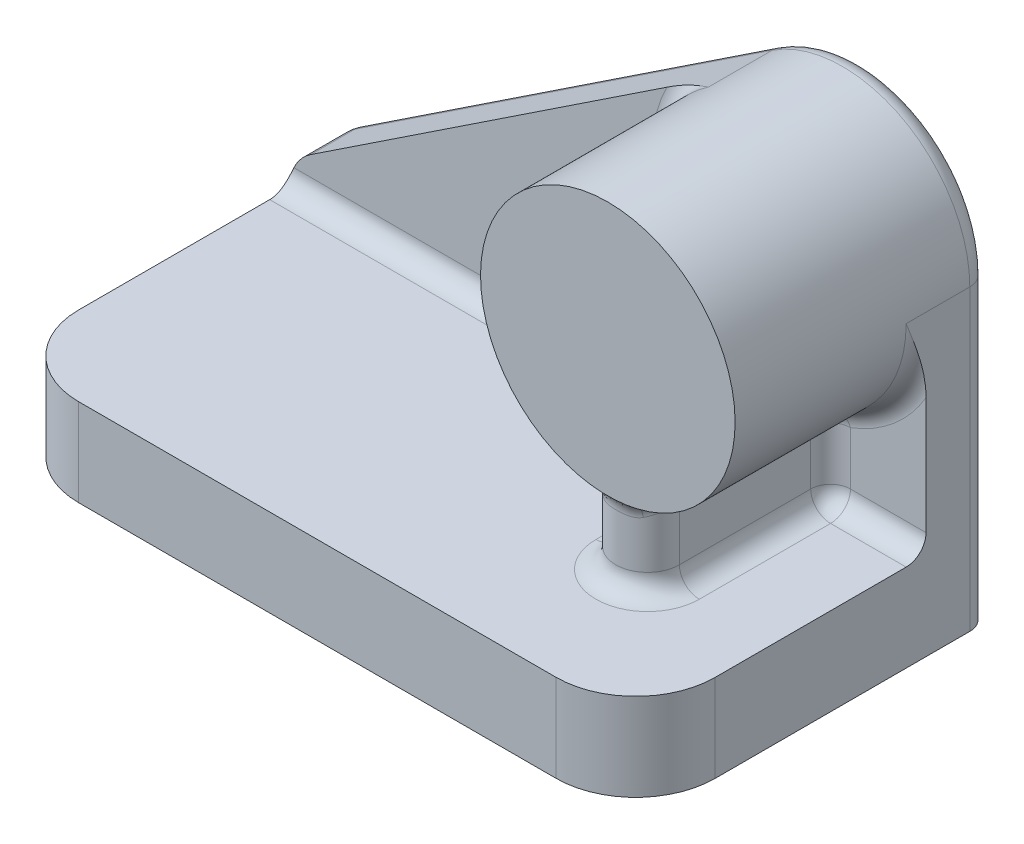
ISO-10303-21;
HEADER;
FILE_DESCRIPTION(('STEP AP214'),'2;1');
FILE_NAME('part.step','',(''),(''),'','','');
FILE_SCHEMA(('AUTOMOTIVE_DESIGN { 1 0 10303 214 1 1 1 1 }'));
ENDSEC;
DATA;
#1=APPLICATION_CONTEXT('core data for automotive mechanical design processes');
#2=APPLICATION_PROTOCOL_DEFINITION('international standard','automotive_design',2000,#1);
#3=PRODUCT_CONTEXT('',#1,'mechanical');
#4=PRODUCT('Part','Part','',(#3));
#5=PRODUCT_RELATED_PRODUCT_CATEGORY('part','',(#4));
#6=PRODUCT_DEFINITION_FORMATION('','',#4);
#7=PRODUCT_DEFINITION_CONTEXT('part definition',#1,'design');
#8=PRODUCT_DEFINITION('design','',#6,#7);
#9=PRODUCT_DEFINITION_SHAPE('','',#8);
#10=(LENGTH_UNIT() NAMED_UNIT(*) SI_UNIT(.MILLI.,.METRE.));
#11=(NAMED_UNIT(*) PLANE_ANGLE_UNIT() SI_UNIT($,.RADIAN.));
#12=(NAMED_UNIT(*) SI_UNIT($,.STERADIAN.) SOLID_ANGLE_UNIT());
#13=UNCERTAINTY_MEASURE_WITH_UNIT(LENGTH_MEASURE(1.E-05),#10,'distance_accuracy_value','');
#14=(GEOMETRIC_REPRESENTATION_CONTEXT(3) GLOBAL_UNCERTAINTY_ASSIGNED_CONTEXT((#13)) GLOBAL_UNIT_ASSIGNED_CONTEXT((#10,
#11,#12)) REPRESENTATION_CONTEXT('',''));
#15=CARTESIAN_POINT('',(0.,0.,0.));
#16=DIRECTION('',(0.,0.,1.));
#17=DIRECTION('',(1.,0.,0.));
#18=AXIS2_PLACEMENT_3D('',#15,#16,#17);
#19=CARTESIAN_POINT('',(128.,75.,-73.));
#20=DIRECTION('',(0.,0.,-1.));
#21=DIRECTION('',(-1.,0.,0.));
#22=AXIS2_PLACEMENT_3D('',#19,#20,#21);
#23=PLANE('',#22);
#24=DIRECTION('',(0.,-1.,0.));
#25=VECTOR('',#24,1.);
#26=CARTESIAN_POINT('',(115.,40.3589838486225,-73.));
#27=LINE('',#26,#25);
#28=CARTESIAN_POINT('',(115.,27.,-73.));
#29=VERTEX_POINT('',#28);
#30=CARTESIAN_POINT('',(115.,40.3589838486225,-73.));
#31=VERTEX_POINT('',#30);
#32=EDGE_CURVE('E718',#29,#31,#27,.F.);
#33=ORIENTED_EDGE('',*,*,#32,.T.);
#34=CARTESIAN_POINT('',(128.,75.,-73.));
#35=DIRECTION('',(0.,0.,-1.));
#36=DIRECTION('',(-1.,0.,0.));
#37=AXIS2_PLACEMENT_3D('',#34,#35,#36);
#38=CIRCLE('',#37,37.);
#39=CARTESIAN_POINT('',(94.8269650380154,91.3874876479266,-73.));
#40=VERTEX_POINT('',#39);
#41=EDGE_CURVE('E276',#31,#40,#38,.T.);
#42=ORIENTED_EDGE('',*,*,#41,.T.);
#43=DIRECTION('',(0.833134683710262,0.553070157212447,0.));
#44=VECTOR('',#43,1.);
#45=CARTESIAN_POINT('',(5.36315811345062,31.9976162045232,-73.));
#46=LINE('',#45,#44);
#47=CARTESIAN_POINT('',(5.36315811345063,31.9976162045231,-73.));
#48=VERTEX_POINT('',#47);
#49=EDGE_CURVE('E263',#48,#40,#46,.T.);
#50=ORIENTED_EDGE('',*,*,#49,.F.);
#51=CARTESIAN_POINT('',(12.,22.,-73.));
#52=DIRECTION('',(0.,0.,-1.));
#53=DIRECTION('',(-1.,0.,0.));
#54=AXIS2_PLACEMENT_3D('',#51,#52,#53);
#55=CIRCLE('',#54,12.);
#56=CARTESIAN_POINT('',(1.09128788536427,27.,-73.));
#57=VERTEX_POINT('',#56);
#58=EDGE_CURVE('E254',#57,#48,#55,.T.);
#59=ORIENTED_EDGE('',*,*,#58,.F.);
#60=DIRECTION('',(-1.,0.,0.));
#61=VECTOR('',#60,1.);
#62=CARTESIAN_POINT('',(128.,27.,-73.));
#63=LINE('',#62,#61);
#64=EDGE_CURVE('E650',#57,#29,#63,.F.);
#65=ORIENTED_EDGE('',*,*,#64,.T.);
#66=EDGE_LOOP('',(#33,#42,#50,#59,#65));
#67=FACE_BOUND('',#66,.T.);
#68=ADVANCED_FACE('F42',(#67),#23,.F.);
#69=CARTESIAN_POINT('',(160.,22.,0.));
#70=DIRECTION('',(0.,1.,0.));
#71=DIRECTION('',(0.,0.,1.));
#72=AXIS2_PLACEMENT_3D('',#69,#70,#71);
#73=PLANE('',#72);
#74=DIRECTION('',(0.,0.,1.));
#75=VECTOR('',#74,1.);
#76=CARTESIAN_POINT('',(160.,22.,-89.));
#77=LINE('',#76,#75);
#78=CARTESIAN_POINT('',(160.,22.,-68.));
#79=VERTEX_POINT('',#78);
#80=CARTESIAN_POINT('',(160.,22.,-20.));
#81=VERTEX_POINT('',#80);
#82=EDGE_CURVE('E339',#79,#81,#77,.T.);
#83=ORIENTED_EDGE('',*,*,#82,.F.);
#84=DIRECTION('',(-1.,0.,0.));
#85=VECTOR('',#84,1.);
#86=CARTESIAN_POINT('',(160.,22.,-68.));
#87=LINE('',#86,#85);
#88=CARTESIAN_POINT('',(141.,22.,-68.));
#89=VERTEX_POINT('',#88);
#90=EDGE_CURVE('E347',#79,#89,#87,.T.);
#91=ORIENTED_EDGE('',*,*,#90,.T.);
#92=DIRECTION('',(0.,0.,1.));
#93=VECTOR('',#92,1.);
#94=CARTESIAN_POINT('',(141.,22.,-35.));
#95=LINE('',#94,#93);
#96=CARTESIAN_POINT('',(141.,22.,-35.));
#97=VERTEX_POINT('',#96);
#98=EDGE_CURVE('E659',#89,#97,#95,.T.);
#99=ORIENTED_EDGE('',*,*,#98,.T.);
#100=CARTESIAN_POINT('',(128.,22.,-35.));
#101=DIRECTION('',(0.,1.,0.));
#102=DIRECTION('',(0.,0.,1.));
#103=AXIS2_PLACEMENT_3D('',#100,#101,#102);
#104=CIRCLE('',#103,13.);
#105=CARTESIAN_POINT('',(115.,22.,-35.));
#106=VERTEX_POINT('',#105);
#107=EDGE_CURVE('E662',#97,#106,#104,.F.);
#108=ORIENTED_EDGE('',*,*,#107,.T.);
#109=DIRECTION('',(0.,0.,1.));
#110=VECTOR('',#109,1.);
#111=CARTESIAN_POINT('',(115.,22.,0.));
#112=LINE('',#111,#110);
#113=CARTESIAN_POINT('',(115.,22.,-68.));
#114=VERTEX_POINT('',#113);
#115=EDGE_CURVE('E663',#106,#114,#112,.F.);
#116=ORIENTED_EDGE('',*,*,#115,.T.);
#117=DIRECTION('',(-1.,0.,0.));
#118=VECTOR('',#117,1.);
#119=CARTESIAN_POINT('',(160.,22.,-68.));
#120=LINE('',#119,#118);
#121=CARTESIAN_POINT('',(0.,22.,-68.));
#122=VERTEX_POINT('',#121);
#123=EDGE_CURVE('E342',#114,#122,#120,.T.);
#124=ORIENTED_EDGE('',*,*,#123,.T.);
#125=DIRECTION('',(0.,0.,-1.));
#126=VECTOR('',#125,1.);
#127=CARTESIAN_POINT('',(0.,22.,0.));
#128=LINE('',#127,#126);
#129=CARTESIAN_POINT('',(0.,22.,-20.));
#130=VERTEX_POINT('',#129);
#131=EDGE_CURVE('E747',#130,#122,#128,.T.);
#132=ORIENTED_EDGE('',*,*,#131,.F.);
#133=CARTESIAN_POINT('',(20.,22.,-20.));
#134=DIRECTION('',(0.,1.,0.));
#135=DIRECTION('',(0.,0.,1.));
#136=AXIS2_PLACEMENT_3D('',#133,#134,#135);
#137=CIRCLE('',#136,20.);
#138=CARTESIAN_POINT('',(20.,22.,0.));
#139=VERTEX_POINT('',#138);
#140=EDGE_CURVE('E775',#130,#139,#137,.T.);
#141=ORIENTED_EDGE('',*,*,#140,.T.);
#142=DIRECTION('',(1.,0.,0.));
#143=VECTOR('',#142,1.);
#144=CARTESIAN_POINT('',(0.,22.,0.));
#145=LINE('',#144,#143);
#146=CARTESIAN_POINT('',(140.,22.,0.));
#147=VERTEX_POINT('',#146);
#148=EDGE_CURVE('E337',#139,#147,#145,.T.);
#149=ORIENTED_EDGE('',*,*,#148,.T.);
#150=CARTESIAN_POINT('',(140.,22.,-20.));
#151=DIRECTION('',(0.,1.,0.));
#152=DIRECTION('',(0.,0.,1.));
#153=AXIS2_PLACEMENT_3D('',#150,#151,#152);
#154=CIRCLE('',#153,20.);
#155=EDGE_CURVE('E772',#147,#81,#154,.T.);
#156=ORIENTED_EDGE('',*,*,#155,.T.);
#157=EDGE_LOOP('',(#83,#91,#99,#108,#116,#124,#132,#141,#149,#156));
#158=FACE_BOUND('',#157,.T.);
#159=ADVANCED_FACE('F612',(#158),#73,.T.);
#160=CARTESIAN_POINT('',(160.,22.,-89.));
#161=DIRECTION('',(1.,0.,0.));
#162=DIRECTION('',(0.,0.,-1.));
#163=AXIS2_PLACEMENT_3D('',#160,#161,#162);
#164=PLANE('',#163);
#165=DIRECTION('',(0.,0.,1.));
#166=VECTOR('',#165,1.);
#167=CARTESIAN_POINT('',(160.,0.,-89.));
#168=LINE('',#167,#166);
#169=CARTESIAN_POINT('',(160.,0.,-84.));
#170=VERTEX_POINT('',#169);
#171=CARTESIAN_POINT('',(160.,0.,-20.));
#172=VERTEX_POINT('',#171);
#173=EDGE_CURVE('E299',#170,#172,#168,.T.);
#174=ORIENTED_EDGE('',*,*,#173,.F.);
#175=DIRECTION('',(0.,-1.,0.));
#176=VECTOR('',#175,1.);
#177=CARTESIAN_POINT('',(160.,22.,-84.));
#178=LINE('',#177,#176);
#179=CARTESIAN_POINT('',(160.,75.,-84.));
#180=VERTEX_POINT('',#179);
#181=EDGE_CURVE('E530',#170,#180,#178,.F.);
#182=ORIENTED_EDGE('',*,*,#181,.T.);
#183=DIRECTION('',(0.,0.,-1.));
#184=VECTOR('',#183,1.);
#185=CARTESIAN_POINT('',(160.,75.,-73.));
#186=LINE('',#185,#184);
#187=CARTESIAN_POINT('',(160.,75.,-68.));
#188=VERTEX_POINT('',#187);
#189=EDGE_CURVE('E290',#188,#180,#186,.T.);
#190=ORIENTED_EDGE('',*,*,#189,.F.);
#191=CARTESIAN_POINT('',(160.,56.4258243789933,-73.));
#192=CARTESIAN_POINT('',(160.,56.609656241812,-72.9999960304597));
#193=CARTESIAN_POINT('',(160.,56.7934734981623,-72.9974455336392));
#194=CARTESIAN_POINT('',(160.,57.1609618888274,-72.9875602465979));
#195=CARTESIAN_POINT('',(160.,57.3446330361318,-72.9802259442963));
#196=CARTESIAN_POINT('',(160.,57.8950786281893,-72.9515215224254));
#197=CARTESIAN_POINT('',(160.,58.2615153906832,-72.9234491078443));
#198=CARTESIAN_POINT('',(160.,58.9918093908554,-72.8516706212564));
#199=CARTESIAN_POINT('',(160.,59.3556709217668,-72.8080069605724));
#200=CARTESIAN_POINT('',(160.,60.0815126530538,-72.706858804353));
#201=CARTESIAN_POINT('',(160.,60.4434925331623,-72.649372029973));
#202=CARTESIAN_POINT('',(160.,61.1619424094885,-72.5227801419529));
#203=CARTESIAN_POINT('',(160.,61.5184323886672,-72.4537875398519));
#204=CARTESIAN_POINT('',(160.,62.2292055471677,-72.3051956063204));
#205=CARTESIAN_POINT('',(160.,62.5834885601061,-72.2255954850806));
#206=CARTESIAN_POINT('',(160.,63.6434519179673,-71.9726555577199));
#207=CARTESIAN_POINT('',(160.,64.3457884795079,-71.7852601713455));
#208=CARTESIAN_POINT('',(160.,65.8877303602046,-71.3395166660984));
#209=CARTESIAN_POINT('',(160.,66.7253810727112,-71.0745234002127));
#210=CARTESIAN_POINT('',(160.,68.3904437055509,-70.5149675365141));
#211=CARTESIAN_POINT('',(160.,69.2178573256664,-70.2204099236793));
#212=CARTESIAN_POINT('',(160.,71.6929484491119,-69.3072041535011));
#213=CARTESIAN_POINT('',(160.,73.32997147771,-68.6601365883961));
#214=CARTESIAN_POINT('',(160.,74.9778186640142,-68.0087679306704));
#215=CARTESIAN_POINT('',(160.,74.9889093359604,-68.0043839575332));
#216=CARTESIAN_POINT('',(160.,75.,-68.));
#217=B_SPLINE_CURVE_WITH_KNOTS('',3,(#191,#192,#193,#194,#195,#196,#197,#198,#199,#200,#201,
#202,#203,#204,#205,#206,#207,#208,#209,#210,#211,#212,#213,#214,#215,#216),.UNSPECIFIED.,.F.,
.F.,(4,2,2,2,2,2,2,2,2,2,2,2,4),(0.,0.551453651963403,1.10285106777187,2.20495618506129,
3.30408591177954,4.40339696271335,5.49252870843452,6.5817415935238,8.76156260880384,
11.3964778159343,14.0309494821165,19.3109105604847,19.3466876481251),.UNSPECIFIED.);
#218=CARTESIAN_POINT('',(160.,56.4258243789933,-73.));
#219=VERTEX_POINT('',#218);
#220=EDGE_CURVE('E53',#188,#219,#217,.F.);
#221=ORIENTED_EDGE('',*,*,#220,.T.);
#222=DIRECTION('',(0.,1.,0.));
#223=VECTOR('',#222,1.);
#224=CARTESIAN_POINT('',(160.,22.,-73.));
#225=LINE('',#224,#223);
#226=CARTESIAN_POINT('',(160.,27.,-73.));
#227=VERTEX_POINT('',#226);
#228=EDGE_CURVE('E280',#227,#219,#225,.T.);
#229=ORIENTED_EDGE('',*,*,#228,.F.);
#230=CARTESIAN_POINT('',(160.,27.,-68.));
#231=DIRECTION('',(1.,0.,0.));
#232=DIRECTION('',(0.,0.,-1.));
#233=AXIS2_PLACEMENT_3D('',#230,#231,#232);
#234=CIRCLE('',#233,5.);
#235=EDGE_CURVE('E559',#227,#79,#234,.F.);
#236=ORIENTED_EDGE('',*,*,#235,.T.);
#237=ORIENTED_EDGE('',*,*,#82,.T.);
#238=DIRECTION('',(0.,-1.,0.));
#239=VECTOR('',#238,1.);
#240=CARTESIAN_POINT('',(160.,0.,-20.));
#241=LINE('',#240,#239);
#242=EDGE_CURVE('E361',#81,#172,#241,.T.);
#243=ORIENTED_EDGE('',*,*,#242,.T.);
#244=EDGE_LOOP('',(#174,#182,#190,#221,#229,#236,#237,#243));
#245=FACE_BOUND('',#244,.T.);
#246=ADVANCED_FACE('F620',(#245),#164,.T.);
#247=CARTESIAN_POINT('',(0.,22.,-89.));
#248=DIRECTION('',(0.,0.,-1.));
#249=DIRECTION('',(-1.,0.,0.));
#250=AXIS2_PLACEMENT_3D('',#247,#248,#249);
#251=PLANE('',#250);
#252=DIRECTION('',(1.,0.,0.));
#253=VECTOR('',#252,1.);
#254=CARTESIAN_POINT('',(0.,0.,-89.));
#255=LINE('',#254,#253);
#256=CARTESIAN_POINT('',(5.,0.,-89.));
#257=VERTEX_POINT('',#256);
#258=CARTESIAN_POINT('',(155.,0.,-89.));
#259=VERTEX_POINT('',#258);
#260=EDGE_CURVE('E341',#257,#259,#255,.T.);
#261=ORIENTED_EDGE('',*,*,#260,.F.);
#262=DIRECTION('',(0.,-1.,0.));
#263=VECTOR('',#262,1.);
#264=CARTESIAN_POINT('',(5.,22.,-89.));
#265=LINE('',#264,#263);
#266=CARTESIAN_POINT('',(4.99999999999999,22.,-89.));
#267=VERTEX_POINT('',#266);
#268=EDGE_CURVE('E545',#257,#267,#265,.F.);
#269=ORIENTED_EDGE('',*,*,#268,.T.);
#270=CARTESIAN_POINT('',(12.,22.,-89.));
#271=DIRECTION('',(0.,0.,-1.));
#272=DIRECTION('',(-1.,0.,0.));
#273=AXIS2_PLACEMENT_3D('',#270,#271,#272);
#274=CIRCLE('',#273,7.);
#275=CARTESIAN_POINT('',(8.12850889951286,27.8319427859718,-89.));
#276=VERTEX_POINT('',#275);
#277=EDGE_CURVE('E536',#267,#276,#274,.T.);
#278=ORIENTED_EDGE('',*,*,#277,.T.);
#279=DIRECTION('',(0.833134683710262,0.553070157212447,0.));
#280=VECTOR('',#279,1.);
#281=CARTESIAN_POINT('',(-0.200851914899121,22.3025596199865,-89.));
#282=LINE('',#281,#280);
#283=CARTESIAN_POINT('',(113.067105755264,97.4946364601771,-89.));
#284=VERTEX_POINT('',#283);
#285=EDGE_CURVE('E533',#276,#284,#282,.T.);
#286=ORIENTED_EDGE('',*,*,#285,.T.);
#287=CARTESIAN_POINT('',(128.,75.,-89.));
#288=DIRECTION('',(0.,0.,-1.));
#289=DIRECTION('',(-1.,0.,0.));
#290=AXIS2_PLACEMENT_3D('',#287,#288,#289);
#291=CIRCLE('',#290,27.);
#292=CARTESIAN_POINT('',(155.,75.,-89.));
#293=VERTEX_POINT('',#292);
#294=EDGE_CURVE('E524',#284,#293,#291,.T.);
#295=ORIENTED_EDGE('',*,*,#294,.T.);
#296=DIRECTION('',(0.,-1.,0.));
#297=VECTOR('',#296,1.);
#298=CARTESIAN_POINT('',(155.,22.,-89.));
#299=LINE('',#298,#297);
#300=EDGE_CURVE('E526',#293,#259,#299,.T.);
#301=ORIENTED_EDGE('',*,*,#300,.T.);
#302=EDGE_LOOP('',(#261,#269,#278,#286,#295,#301));
#303=FACE_BOUND('',#302,.T.);
#304=ADVANCED_FACE('F740',(#303),#251,.T.);
#305=CARTESIAN_POINT('',(0.,22.,0.));
#306=DIRECTION('',(-1.,0.,0.));
#307=DIRECTION('',(0.,0.,1.));
#308=AXIS2_PLACEMENT_3D('',#305,#306,#307);
#309=PLANE('',#308);
#310=DIRECTION('',(0.,0.,-1.));
#311=VECTOR('',#310,1.);
#312=CARTESIAN_POINT('',(0.,22.,-73.));
#313=LINE('',#312,#311);
#314=CARTESIAN_POINT('',(0.,22.,-84.));
#315=VERTEX_POINT('',#314);
#316=EDGE_CURVE('E264',#122,#315,#313,.T.);
#317=ORIENTED_EDGE('',*,*,#316,.T.);
#318=DIRECTION('',(0.,-1.,0.));
#319=VECTOR('',#318,1.);
#320=CARTESIAN_POINT('',(0.,22.,-84.));
#321=LINE('',#320,#319);
#322=CARTESIAN_POINT('',(0.,0.,-84.));
#323=VERTEX_POINT('',#322);
#324=EDGE_CURVE('E654',#315,#323,#321,.T.);
#325=ORIENTED_EDGE('',*,*,#324,.T.);
#326=DIRECTION('',(0.,0.,-1.));
#327=VECTOR('',#326,1.);
#328=CARTESIAN_POINT('',(0.,0.,0.));
#329=LINE('',#328,#327);
#330=CARTESIAN_POINT('',(0.,0.,-20.));
#331=VERTEX_POINT('',#330);
#332=EDGE_CURVE('E738',#331,#323,#329,.T.);
#333=ORIENTED_EDGE('',*,*,#332,.F.);
#334=DIRECTION('',(0.,-1.,0.));
#335=VECTOR('',#334,1.);
#336=CARTESIAN_POINT('',(0.,22.,-20.));
#337=LINE('',#336,#335);
#338=EDGE_CURVE('E768',#331,#130,#337,.F.);
#339=ORIENTED_EDGE('',*,*,#338,.T.);
#340=ORIENTED_EDGE('',*,*,#131,.T.);
#341=EDGE_LOOP('',(#317,#325,#333,#339,#340));
#342=FACE_BOUND('',#341,.T.);
#343=ADVANCED_FACE('F748',(#342),#309,.T.);
#344=CARTESIAN_POINT('',(0.,22.,0.));
#345=DIRECTION('',(0.,0.,-1.));
#346=DIRECTION('',(-1.,0.,0.));
#347=AXIS2_PLACEMENT_3D('',#344,#345,#346);
#348=PLANE('',#347);
#349=ORIENTED_EDGE('',*,*,#148,.F.);
#350=DIRECTION('',(0.,-1.,0.));
#351=VECTOR('',#350,1.);
#352=CARTESIAN_POINT('',(20.,0.,0.));
#353=LINE('',#352,#351);
#354=CARTESIAN_POINT('',(20.,0.,0.));
#355=VERTEX_POINT('',#354);
#356=EDGE_CURVE('E765',#139,#355,#353,.T.);
#357=ORIENTED_EDGE('',*,*,#356,.T.);
#358=DIRECTION('',(1.,0.,0.));
#359=VECTOR('',#358,1.);
#360=CARTESIAN_POINT('',(0.,0.,0.));
#361=LINE('',#360,#359);
#362=CARTESIAN_POINT('',(140.,0.,0.));
#363=VERTEX_POINT('',#362);
#364=EDGE_CURVE('E760',#355,#363,#361,.T.);
#365=ORIENTED_EDGE('',*,*,#364,.T.);
#366=DIRECTION('',(0.,-1.,0.));
#367=VECTOR('',#366,1.);
#368=CARTESIAN_POINT('',(140.,22.,0.));
#369=LINE('',#368,#367);
#370=EDGE_CURVE('E755',#363,#147,#369,.F.);
#371=ORIENTED_EDGE('',*,*,#370,.T.);
#372=EDGE_LOOP('',(#349,#357,#365,#371));
#373=FACE_BOUND('',#372,.T.);
#374=ADVANCED_FACE('F788',(#373),#348,.F.);
#375=CARTESIAN_POINT('',(160.,0.,0.));
#376=DIRECTION('',(0.,1.,0.));
#377=DIRECTION('',(0.,0.,1.));
#378=AXIS2_PLACEMENT_3D('',#375,#376,#377);
#379=PLANE('',#378);
#380=CARTESIAN_POINT('',(20.,0.,-20.));
#381=DIRECTION('',(0.,1.,0.));
#382=DIRECTION('',(0.,0.,1.));
#383=AXIS2_PLACEMENT_3D('',#380,#381,#382);
#384=CIRCLE('',#383,18.);
#385=CARTESIAN_POINT('',(20.,0.,-2.));
#386=VERTEX_POINT('',#385);
#387=CARTESIAN_POINT('',(2.,0.,-20.));
#388=VERTEX_POINT('',#387);
#389=EDGE_CURVE('E313',#386,#388,#384,.F.);
#390=ORIENTED_EDGE('',*,*,#389,.F.);
#391=DIRECTION('',(1.,0.,0.));
#392=VECTOR('',#391,1.);
#393=CARTESIAN_POINT('',(0.,0.,-2.));
#394=LINE('',#393,#392);
#395=CARTESIAN_POINT('',(140.,0.,-2.));
#396=VERTEX_POINT('',#395);
#397=EDGE_CURVE('E322',#386,#396,#394,.T.);
#398=ORIENTED_EDGE('',*,*,#397,.T.);
#399=CARTESIAN_POINT('',(140.,0.,-20.));
#400=DIRECTION('',(0.,1.,0.));
#401=DIRECTION('',(0.,0.,1.));
#402=AXIS2_PLACEMENT_3D('',#399,#400,#401);
#403=CIRCLE('',#402,18.);
#404=CARTESIAN_POINT('',(158.,0.,-20.));
#405=VERTEX_POINT('',#404);
#406=EDGE_CURVE('E321',#405,#396,#403,.F.);
#407=ORIENTED_EDGE('',*,*,#406,.F.);
#408=DIRECTION('',(0.,0.,1.));
#409=VECTOR('',#408,1.);
#410=CARTESIAN_POINT('',(158.,0.,-89.));
#411=LINE('',#410,#409);
#412=CARTESIAN_POINT('',(158.,0.,-87.));
#413=VERTEX_POINT('',#412);
#414=EDGE_CURVE('E289',#413,#405,#411,.T.);
#415=ORIENTED_EDGE('',*,*,#414,.F.);
#416=DIRECTION('',(1.,0.,0.));
#417=VECTOR('',#416,1.);
#418=CARTESIAN_POINT('',(0.,0.,-87.));
#419=LINE('',#418,#417);
#420=CARTESIAN_POINT('',(2.,0.,-87.));
#421=VERTEX_POINT('',#420);
#422=EDGE_CURVE('E294',#421,#413,#419,.T.);
#423=ORIENTED_EDGE('',*,*,#422,.F.);
#424=DIRECTION('',(0.,0.,-1.));
#425=VECTOR('',#424,1.);
#426=CARTESIAN_POINT('',(2.,0.,0.));
#427=LINE('',#426,#425);
#428=EDGE_CURVE('E328',#388,#421,#427,.T.);
#429=ORIENTED_EDGE('',*,*,#428,.F.);
#430=EDGE_LOOP('',(#390,#398,#407,#415,#423,#429));
#431=FACE_BOUND('',#430,.T.);
#432=ORIENTED_EDGE('',*,*,#332,.T.);
#433=CARTESIAN_POINT('',(5.,0.,-84.));
#434=DIRECTION('',(0.,1.,0.));
#435=DIRECTION('',(0.,0.,1.));
#436=AXIS2_PLACEMENT_3D('',#433,#434,#435);
#437=CIRCLE('',#436,5.);
#438=EDGE_CURVE('E538',#323,#257,#437,.F.);
#439=ORIENTED_EDGE('',*,*,#438,.T.);
#440=ORIENTED_EDGE('',*,*,#260,.T.);
#441=CARTESIAN_POINT('',(155.,0.,-84.));
#442=DIRECTION('',(0.,1.,0.));
#443=DIRECTION('',(0.,0.,1.));
#444=AXIS2_PLACEMENT_3D('',#441,#442,#443);
#445=CIRCLE('',#444,5.);
#446=EDGE_CURVE('E532',#259,#170,#445,.F.);
#447=ORIENTED_EDGE('',*,*,#446,.T.);
#448=ORIENTED_EDGE('',*,*,#173,.T.);
#449=CARTESIAN_POINT('',(140.,0.,-20.));
#450=DIRECTION('',(0.,1.,0.));
#451=DIRECTION('',(0.,0.,1.));
#452=AXIS2_PLACEMENT_3D('',#449,#450,#451);
#453=CIRCLE('',#452,20.);
#454=EDGE_CURVE('E764',#172,#363,#453,.F.);
#455=ORIENTED_EDGE('',*,*,#454,.T.);
#456=ORIENTED_EDGE('',*,*,#364,.F.);
#457=CARTESIAN_POINT('',(20.,0.,-20.));
#458=DIRECTION('',(0.,1.,0.));
#459=DIRECTION('',(0.,0.,1.));
#460=AXIS2_PLACEMENT_3D('',#457,#458,#459);
#461=CIRCLE('',#460,20.);
#462=EDGE_CURVE('E770',#355,#331,#461,.F.);
#463=ORIENTED_EDGE('',*,*,#462,.T.);
#464=EDGE_LOOP('',(#432,#439,#440,#447,#448,#455,#456,#463));
#465=FACE_BOUND('',#464,.T.);
#466=ADVANCED_FACE('F733',(#431,#465),#379,.F.);
#467=CARTESIAN_POINT('',(20.,22.,-20.));
#468=DIRECTION('',(0.,1.,0.));
#469=DIRECTION('',(0.,0.,1.));
#470=AXIS2_PLACEMENT_3D('',#467,#468,#469);
#471=CYLINDRICAL_SURFACE('',#470,20.);
#472=ORIENTED_EDGE('',*,*,#140,.F.);
#473=ORIENTED_EDGE('',*,*,#338,.F.);
#474=ORIENTED_EDGE('',*,*,#462,.F.);
#475=ORIENTED_EDGE('',*,*,#356,.F.);
#476=EDGE_LOOP('',(#472,#473,#474,#475));
#477=FACE_BOUND('',#476,.T.);
#478=ADVANCED_FACE('F790',(#477),#471,.T.);
#479=CARTESIAN_POINT('',(140.,22.,-20.));
#480=DIRECTION('',(0.,1.,0.));
#481=DIRECTION('',(0.,0.,1.));
#482=AXIS2_PLACEMENT_3D('',#479,#480,#481);
#483=CYLINDRICAL_SURFACE('',#482,20.);
#484=ORIENTED_EDGE('',*,*,#155,.F.);
#485=ORIENTED_EDGE('',*,*,#370,.F.);
#486=ORIENTED_EDGE('',*,*,#454,.F.);
#487=ORIENTED_EDGE('',*,*,#242,.F.);
#488=EDGE_LOOP('',(#484,#485,#486,#487));
#489=FACE_BOUND('',#488,.T.);
#490=ADVANCED_FACE('F383',(#489),#483,.T.);
#491=CARTESIAN_POINT('',(158.,22.,-89.));
#492=DIRECTION('',(1.,0.,0.));
#493=DIRECTION('',(0.,0.,-1.));
#494=AXIS2_PLACEMENT_3D('',#491,#492,#493);
#495=PLANE('',#494);
#496=DIRECTION('',(0.,0.,1.));
#497=VECTOR('',#496,1.);
#498=CARTESIAN_POINT('',(158.,20.,-89.));
#499=LINE('',#498,#497);
#500=CARTESIAN_POINT('',(158.,20.,-87.));
#501=VERTEX_POINT('',#500);
#502=CARTESIAN_POINT('',(158.,20.,-20.));
#503=VERTEX_POINT('',#502);
#504=EDGE_CURVE('E293',#501,#503,#499,.T.);
#505=ORIENTED_EDGE('',*,*,#504,.F.);
#506=DIRECTION('',(0.,-1.,0.));
#507=VECTOR('',#506,1.);
#508=CARTESIAN_POINT('',(158.,22.,-87.));
#509=LINE('',#508,#507);
#510=EDGE_CURVE('E301',#501,#413,#509,.T.);
#511=ORIENTED_EDGE('',*,*,#510,.T.);
#512=ORIENTED_EDGE('',*,*,#414,.T.);
#513=DIRECTION('',(0.,1.,0.));
#514=VECTOR('',#513,1.);
#515=CARTESIAN_POINT('',(158.,22.,-20.));
#516=LINE('',#515,#514);
#517=EDGE_CURVE('E298',#503,#405,#516,.F.);
#518=ORIENTED_EDGE('',*,*,#517,.F.);
#519=EDGE_LOOP('',(#505,#511,#512,#518));
#520=FACE_BOUND('',#519,.T.);
#521=ADVANCED_FACE('F799',(#520),#495,.F.);
#522=CARTESIAN_POINT('',(0.,22.,-87.));
#523=DIRECTION('',(0.,0.,-1.));
#524=DIRECTION('',(-1.,0.,0.));
#525=AXIS2_PLACEMENT_3D('',#522,#523,#524);
#526=PLANE('',#525);
#527=ORIENTED_EDGE('',*,*,#422,.T.);
#528=ORIENTED_EDGE('',*,*,#510,.F.);
#529=DIRECTION('',(1.,0.,0.));
#530=VECTOR('',#529,1.);
#531=CARTESIAN_POINT('',(0.,20.,-87.));
#532=LINE('',#531,#530);
#533=CARTESIAN_POINT('',(2.,20.,-87.));
#534=VERTEX_POINT('',#533);
#535=EDGE_CURVE('E310',#534,#501,#532,.T.);
#536=ORIENTED_EDGE('',*,*,#535,.F.);
#537=DIRECTION('',(0.,-1.,0.));
#538=VECTOR('',#537,1.);
#539=CARTESIAN_POINT('',(2.,22.,-87.));
#540=LINE('',#539,#538);
#541=EDGE_CURVE('E302',#534,#421,#540,.T.);
#542=ORIENTED_EDGE('',*,*,#541,.T.);
#543=EDGE_LOOP('',(#527,#528,#536,#542));
#544=FACE_BOUND('',#543,.T.);
#545=ADVANCED_FACE('F830',(#544),#526,.F.);
#546=CARTESIAN_POINT('',(2.,22.,0.));
#547=DIRECTION('',(-1.,0.,0.));
#548=DIRECTION('',(0.,0.,1.));
#549=AXIS2_PLACEMENT_3D('',#546,#547,#548);
#550=PLANE('',#549);
#551=ORIENTED_EDGE('',*,*,#428,.T.);
#552=ORIENTED_EDGE('',*,*,#541,.F.);
#553=DIRECTION('',(0.,0.,-1.));
#554=VECTOR('',#553,1.);
#555=CARTESIAN_POINT('',(2.,20.,0.));
#556=LINE('',#555,#554);
#557=CARTESIAN_POINT('',(2.,20.,-20.));
#558=VERTEX_POINT('',#557);
#559=EDGE_CURVE('E309',#558,#534,#556,.T.);
#560=ORIENTED_EDGE('',*,*,#559,.F.);
#561=DIRECTION('',(0.,1.,0.));
#562=VECTOR('',#561,1.);
#563=CARTESIAN_POINT('',(2.,22.,-20.));
#564=LINE('',#563,#562);
#565=EDGE_CURVE('E311',#388,#558,#564,.T.);
#566=ORIENTED_EDGE('',*,*,#565,.F.);
#567=EDGE_LOOP('',(#551,#552,#560,#566));
#568=FACE_BOUND('',#567,.T.);
#569=ADVANCED_FACE('F823',(#568),#550,.F.);
#570=CARTESIAN_POINT('',(0.,22.,-2.));
#571=DIRECTION('',(0.,0.,-1.));
#572=DIRECTION('',(-1.,0.,0.));
#573=AXIS2_PLACEMENT_3D('',#570,#571,#572);
#574=PLANE('',#573);
#575=DIRECTION('',(1.,0.,0.));
#576=VECTOR('',#575,1.);
#577=CARTESIAN_POINT('',(0.,20.,-2.));
#578=LINE('',#577,#576);
#579=CARTESIAN_POINT('',(20.,20.,-2.));
#580=VERTEX_POINT('',#579);
#581=CARTESIAN_POINT('',(140.,20.,-2.));
#582=VERTEX_POINT('',#581);
#583=EDGE_CURVE('E295',#580,#582,#578,.T.);
#584=ORIENTED_EDGE('',*,*,#583,.T.);
#585=DIRECTION('',(0.,1.,0.));
#586=VECTOR('',#585,1.);
#587=CARTESIAN_POINT('',(140.,22.,-2.));
#588=LINE('',#587,#586);
#589=EDGE_CURVE('E303',#396,#582,#588,.T.);
#590=ORIENTED_EDGE('',*,*,#589,.F.);
#591=ORIENTED_EDGE('',*,*,#397,.F.);
#592=DIRECTION('',(0.,1.,0.));
#593=VECTOR('',#592,1.);
#594=CARTESIAN_POINT('',(20.,22.,-2.));
#595=LINE('',#594,#593);
#596=EDGE_CURVE('E318',#580,#386,#595,.F.);
#597=ORIENTED_EDGE('',*,*,#596,.F.);
#598=EDGE_LOOP('',(#584,#590,#591,#597));
#599=FACE_BOUND('',#598,.T.);
#600=ADVANCED_FACE('F819',(#599),#574,.T.);
#601=CARTESIAN_POINT('',(160.,20.,0.));
#602=DIRECTION('',(0.,1.,0.));
#603=DIRECTION('',(0.,0.,1.));
#604=AXIS2_PLACEMENT_3D('',#601,#602,#603);
#605=PLANE('',#604);
#606=ORIENTED_EDGE('',*,*,#559,.T.);
#607=ORIENTED_EDGE('',*,*,#535,.T.);
#608=ORIENTED_EDGE('',*,*,#504,.T.);
#609=CARTESIAN_POINT('',(140.,20.,-20.));
#610=DIRECTION('',(0.,1.,0.));
#611=DIRECTION('',(0.,0.,1.));
#612=AXIS2_PLACEMENT_3D('',#609,#610,#611);
#613=CIRCLE('',#612,18.);
#614=EDGE_CURVE('E312',#582,#503,#613,.T.);
#615=ORIENTED_EDGE('',*,*,#614,.F.);
#616=ORIENTED_EDGE('',*,*,#583,.F.);
#617=CARTESIAN_POINT('',(20.,20.,-20.));
#618=DIRECTION('',(0.,1.,0.));
#619=DIRECTION('',(0.,0.,1.));
#620=AXIS2_PLACEMENT_3D('',#617,#618,#619);
#621=CIRCLE('',#620,18.);
#622=EDGE_CURVE('E297',#558,#580,#621,.T.);
#623=ORIENTED_EDGE('',*,*,#622,.F.);
#624=EDGE_LOOP('',(#606,#607,#608,#615,#616,#623));
#625=FACE_BOUND('',#624,.T.);
#626=ADVANCED_FACE('F814',(#625),#605,.F.);
#627=CARTESIAN_POINT('',(20.,22.,-20.));
#628=DIRECTION('',(0.,1.,0.));
#629=DIRECTION('',(0.,0.,1.));
#630=AXIS2_PLACEMENT_3D('',#627,#628,#629);
#631=CYLINDRICAL_SURFACE('',#630,18.);
#632=ORIENTED_EDGE('',*,*,#622,.T.);
#633=ORIENTED_EDGE('',*,*,#596,.T.);
#634=ORIENTED_EDGE('',*,*,#389,.T.);
#635=ORIENTED_EDGE('',*,*,#565,.T.);
#636=EDGE_LOOP('',(#632,#633,#634,#635));
#637=FACE_BOUND('',#636,.T.);
#638=ADVANCED_FACE('F813',(#637),#631,.F.);
#639=CARTESIAN_POINT('',(140.,22.,-20.));
#640=DIRECTION('',(0.,1.,0.));
#641=DIRECTION('',(0.,0.,1.));
#642=AXIS2_PLACEMENT_3D('',#639,#640,#641);
#643=CYLINDRICAL_SURFACE('',#642,18.);
#644=ORIENTED_EDGE('',*,*,#614,.T.);
#645=ORIENTED_EDGE('',*,*,#517,.T.);
#646=ORIENTED_EDGE('',*,*,#406,.T.);
#647=ORIENTED_EDGE('',*,*,#589,.T.);
#648=EDGE_LOOP('',(#644,#645,#646,#647));
#649=FACE_BOUND('',#648,.T.);
#650=ADVANCED_FACE('F808',(#649),#643,.F.);
#651=CARTESIAN_POINT('',(128.,75.,-73.));
#652=DIRECTION('',(0.,0.,-1.));
#653=DIRECTION('',(-1.,0.,0.));
#654=AXIS2_PLACEMENT_3D('',#651,#652,#653);
#655=CYLINDRICAL_SURFACE('',#654,32.);
#656=DIRECTION('',(0.,0.,-1.));
#657=VECTOR('',#656,1.);
#658=CARTESIAN_POINT('',(110.301754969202,101.660309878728,-73.));
#659=LINE('',#658,#657);
#660=CARTESIAN_POINT('',(110.301754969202,101.660309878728,-68.));
#661=VERTEX_POINT('',#660);
#662=CARTESIAN_POINT('',(110.301754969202,101.660309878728,-84.));
#663=VERTEX_POINT('',#662);
#664=EDGE_CURVE('E271',#661,#663,#659,.T.);
#665=ORIENTED_EDGE('',*,*,#664,.F.);
#666=CARTESIAN_POINT('',(128.,75.,-68.));
#667=DIRECTION('',(0.,0.,-1.));
#668=DIRECTION('',(-1.,0.,0.));
#669=AXIS2_PLACEMENT_3D('',#666,#667,#668);
#670=CIRCLE('',#669,32.);
#671=CARTESIAN_POINT('',(116.756756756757,45.0402022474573,-68.));
#672=VERTEX_POINT('',#671);
#673=EDGE_CURVE('E653',#661,#672,#670,.F.);
#674=ORIENTED_EDGE('',*,*,#673,.T.);
#675=DIRECTION('',(0.,0.,-1.));
#676=VECTOR('',#675,1.);
#677=CARTESIAN_POINT('',(116.756756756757,45.0402022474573,-73.));
#678=LINE('',#677,#676);
#679=CARTESIAN_POINT('',(116.756756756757,45.0402022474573,-35.));
#680=VERTEX_POINT('',#679);
#681=EDGE_CURVE('E359',#672,#680,#678,.F.);
#682=ORIENTED_EDGE('',*,*,#681,.T.);
#683=CARTESIAN_POINT('',(124.842928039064,38.3573934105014,-27.6492927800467));
#684=CARTESIAN_POINT('',(125.397870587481,43.0522060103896,-27.4109492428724));
#685=CARTESIAN_POINT('',(123.563034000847,43.3090970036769,-23.0551007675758));
#686=CARTESIAN_POINT('',(124.645805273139,38.4022151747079,-27.7339385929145));
#687=CARTESIAN_POINT('',(125.219751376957,43.0608269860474,-27.4699018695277));
#688=CARTESIAN_POINT('',(123.285996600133,43.3478617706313,-23.1926502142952));
#689=CARTESIAN_POINT('',(124.452376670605,38.4505306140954,-27.8264219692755));
#690=CARTESIAN_POINT('',(125.039902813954,43.0709586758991,-27.5365185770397));
#691=CARTESIAN_POINT('',(123.014150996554,43.3896480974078,-23.3429357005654));
#692=CARTESIAN_POINT('',(124.074039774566,38.5528301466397,-28.0262974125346));
#693=CARTESIAN_POINT('',(124.679544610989,43.0943798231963,-27.6861053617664));
#694=CARTESIAN_POINT('',(122.482434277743,43.4781233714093,-23.6677332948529));
#695=CARTESIAN_POINT('',(123.88912916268,38.6068126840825,-28.1336853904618));
#696=CARTESIAN_POINT('',(124.49916456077,43.1076377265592,-27.7689022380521));
#697=CARTESIAN_POINT('',(122.222559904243,43.5248109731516,-23.8422387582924));
#698=CARTESIAN_POINT('',(123.528982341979,38.719112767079,-28.3625673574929));
#699=CARTESIAN_POINT('',(124.139474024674,43.13743075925,-27.9518581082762));
#700=CARTESIAN_POINT('',(121.7164076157,43.6219353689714,-24.2141719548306));
#701=CARTESIAN_POINT('',(123.353739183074,38.7774271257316,-28.4840510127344));
#702=CARTESIAN_POINT('',(123.960241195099,43.1539313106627,-28.0518278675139));
#703=CARTESIAN_POINT('',(121.47011993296,43.672369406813,-24.4115828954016));
#704=CARTESIAN_POINT('',(123.013727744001,38.8970049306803,-28.7404135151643));
#705=CARTESIAN_POINT('',(123.604896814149,43.1900394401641,-28.269812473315));
#706=CARTESIAN_POINT('',(120.992266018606,43.7757880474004,-24.8281719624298));
#707=CARTESIAN_POINT('',(122.848960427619,38.9582686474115,-28.8752935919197));
#708=CARTESIAN_POINT('',(123.428805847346,43.2096181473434,-28.3876585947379));
#709=CARTESIAN_POINT('',(120.760701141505,43.8287728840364,-25.0473520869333));
#710=CARTESIAN_POINT('',(122.522516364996,39.0854901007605,-29.1649983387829));
#711=CARTESIAN_POINT('',(123.073148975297,43.2525511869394,-28.6482129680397));
#712=CARTESIAN_POINT('',(120.301914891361,43.9388022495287,-25.5181223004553));
#713=CARTESIAN_POINT('',(122.361447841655,39.1515261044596,-29.3204959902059));
#714=CARTESIAN_POINT('',(122.893761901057,43.2760329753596,-28.7917812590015));
#715=CARTESIAN_POINT('',(120.075548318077,43.995914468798,-25.770805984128));
#716=CARTESIAN_POINT('',(122.052836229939,39.2834542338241,-29.6445057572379));
#717=CARTESIAN_POINT('',(122.54388762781,43.3252258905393,-29.0990314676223));
#718=CARTESIAN_POINT('',(119.641823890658,44.1100144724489,-26.297321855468));
#719=CARTESIAN_POINT('',(121.905297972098,39.3493462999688,-29.813022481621));
#720=CARTESIAN_POINT('',(122.37329966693,43.3509237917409,-29.2625820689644));
#721=CARTESIAN_POINT('',(119.434472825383,44.1670022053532,-26.5711615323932));
#722=CARTESIAN_POINT('',(121.624665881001,39.4791843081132,-30.1620985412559));
#723=CARTESIAN_POINT('',(122.043891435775,43.4035563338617,-29.6091591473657));
#724=CARTESIAN_POINT('',(119.040070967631,44.2792945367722,-27.1384101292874));
#725=CARTESIAN_POINT('',(121.491579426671,39.5431292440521,-30.3426639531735));
#726=CARTESIAN_POINT('',(121.884921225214,43.4304920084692,-29.7921090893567));
#727=CARTESIAN_POINT('',(118.853030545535,44.3345982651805,-27.4318289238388));
#728=CARTESIAN_POINT('',(121.240836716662,39.6672246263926,-30.7146732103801));
#729=CARTESIAN_POINT('',(121.58165035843,43.4844139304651,-30.1762565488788));
#730=CARTESIAN_POINT('',(118.500635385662,44.4419240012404,-28.0363439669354));
#731=CARTESIAN_POINT('',(121.123180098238,39.7273751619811,-30.9061167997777));
#732=CARTESIAN_POINT('',(121.437156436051,43.5114150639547,-30.377429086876));
#733=CARTESIAN_POINT('',(118.33528013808,44.4939460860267,-28.3474397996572));
#734=CARTESIAN_POINT('',(120.902156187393,39.8431628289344,-31.3022985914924));
#735=CARTESIAN_POINT('',(121.163007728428,43.5646744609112,-30.8002289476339));
#736=CARTESIAN_POINT('',(118.024651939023,44.5940867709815,-28.9912352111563));
#737=CARTESIAN_POINT('',(120.799088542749,39.8986976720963,-31.5072155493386));
#738=CARTESIAN_POINT('',(121.033430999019,43.5909422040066,-31.0222349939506));
#739=CARTESIAN_POINT('',(117.879800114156,44.6421169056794,-29.3242252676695));
#740=CARTESIAN_POINT('',(120.61074261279,40.0022141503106,-31.9256714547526));
#741=CARTESIAN_POINT('',(120.794806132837,43.6408372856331,-31.4812860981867));
#742=CARTESIAN_POINT('',(117.615097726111,44.7316446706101,-30.0042161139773));
#743=CARTESIAN_POINT('',(120.525457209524,40.0501988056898,-32.1392069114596));
#744=CARTESIAN_POINT('',(120.685521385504,43.6645038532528,-31.7184481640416));
#745=CARTESIAN_POINT('',(117.495237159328,44.7731449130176,-30.3512112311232));
#746=CARTESIAN_POINT('',(120.373527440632,40.1369791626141,-32.5731342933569));
#747=CARTESIAN_POINT('',(120.489772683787,43.7078879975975,-32.2049554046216));
#748=CARTESIAN_POINT('',(117.281714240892,44.8481981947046,-31.0563432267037));
#749=CARTESIAN_POINT('',(120.306854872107,40.1757887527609,-32.7935152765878));
#750=CARTESIAN_POINT('',(120.403063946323,43.7276528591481,-32.4544760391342));
#751=CARTESIAN_POINT('',(117.188012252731,44.8817632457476,-31.4144623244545));
#752=CARTESIAN_POINT('',(120.192678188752,40.242952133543,-33.2396818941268));
#753=CARTESIAN_POINT('',(120.254080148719,43.7621574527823,-32.9629832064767));
#754=CARTESIAN_POINT('',(117.027547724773,44.9398504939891,-32.139483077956));
#755=CARTESIAN_POINT('',(120.145165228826,40.271310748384,-33.4654649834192));
#756=CARTESIAN_POINT('',(120.191618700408,43.7769377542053,-33.222225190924));
#757=CARTESIAN_POINT('',(116.960772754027,44.9643768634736,-32.5063805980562));
#758=CARTESIAN_POINT('',(120.071760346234,40.3153910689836,-33.9087574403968));
#759=CARTESIAN_POINT('',(120.094982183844,43.8000144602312,-33.7332657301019));
#760=CARTESIAN_POINT('',(116.857609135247,45.0025003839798,-33.2267308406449));
#761=CARTESIAN_POINT('',(120.044864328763,40.3316980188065,-34.126078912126));
#762=CARTESIAN_POINT('',(120.059391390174,43.808634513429,-33.9849809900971));
#763=CARTESIAN_POINT('',(116.819809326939,45.0166036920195,-33.5798782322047));
#764=CARTESIAN_POINT('',(120.008989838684,40.3534910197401,-34.5622682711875));
#765=CARTESIAN_POINT('',(120.011935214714,43.8201615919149,-34.4909899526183));
#766=CARTESIAN_POINT('',(116.769391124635,45.0354516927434,-34.2886859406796));
#767=CARTESIAN_POINT('',(120.000000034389,40.3589839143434,-34.7811350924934));
#768=CARTESIAN_POINT('',(119.999999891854,43.8230855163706,-34.7455708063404));
#769=CARTESIAN_POINT('',(116.756756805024,45.040202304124,-34.6443445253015));
#770=CARTESIAN_POINT('',(119.999999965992,40.3589837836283,-35.2164445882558));
#771=CARTESIAN_POINT('',(120.00000010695,43.8230854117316,-35.2516155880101));
#772=CARTESIAN_POINT('',(116.756756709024,45.0402021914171,-35.3517224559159));
#773=CARTESIAN_POINT('',(120.008791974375,40.35361157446,-35.4328873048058));
#774=CARTESIAN_POINT('',(120.011673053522,43.8202257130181,-35.5033725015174));
#775=CARTESIAN_POINT('',(116.769113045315,45.0355559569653,-35.7034418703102));
#776=CARTESIAN_POINT('',(120.043875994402,40.3322980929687,-35.8642638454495));
#777=CARTESIAN_POINT('',(120.058083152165,43.8089518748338,-36.0038235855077));
#778=CARTESIAN_POINT('',(116.818420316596,45.0171226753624,-36.4044287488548));
#779=CARTESIAN_POINT('',(120.070177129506,40.316351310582,-36.0791968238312));
#780=CARTESIAN_POINT('',(120.092884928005,43.800522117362,-36.2527959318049));
#781=CARTESIAN_POINT('',(116.855384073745,45.0033308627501,-36.7536948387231));
#782=CARTESIAN_POINT('',(120.140223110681,40.2742694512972,-36.5070244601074));
#783=CARTESIAN_POINT('',(120.185115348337,43.7784842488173,-36.7460632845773));
#784=CARTESIAN_POINT('',(116.953827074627,44.966935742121,-37.4489147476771));
#785=CARTESIAN_POINT('',(120.184062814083,40.2480789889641,-36.7199014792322));
#786=CARTESIAN_POINT('',(120.242768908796,43.7648241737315,-36.9905817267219));
#787=CARTESIAN_POINT('',(117.015439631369,44.9442845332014,-37.7948399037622));
#788=CARTESIAN_POINT('',(120.288705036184,40.1864217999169,-37.1408059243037));
#789=CARTESIAN_POINT('',(120.379392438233,43.7330999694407,-37.4708497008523));
#790=CARTESIAN_POINT('',(117.162504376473,44.890959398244,-38.4788096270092));
#791=CARTESIAN_POINT('',(120.349498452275,40.1509600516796,-37.3488358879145));
#792=CARTESIAN_POINT('',(120.458493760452,43.7150068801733,-37.7068246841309));
#793=CARTESIAN_POINT('',(117.247943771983,44.8602897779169,-38.8168583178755));
#794=CARTESIAN_POINT('',(120.418553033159,40.1113017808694,-37.5537544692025));
#795=CARTESIAN_POINT('',(120.547510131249,43.6951222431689,-37.936595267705));
#796=CARTESIAN_POINT('',(117.344993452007,44.8259907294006,-39.1498510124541));
#797=(BOUNDED_SURFACE() B_SPLINE_SURFACE(3,2,((#683,#684,#685),(#686,#687,#688),(#689,#690,
#691),(#692,#693,#694),(#695,#696,#697),(#698,#699,#700),(#701,#702,#703),(#704,#705,#706),
(#707,#708,#709),(#710,#711,#712),(#713,#714,#715),(#716,#717,#718),(#719,#720,#721),(#722,#723,
#724),(#725,#726,#727),(#728,#729,#730),(#731,#732,#733),(#734,#735,#736),(#737,#738,#739),
(#740,#741,#742),(#743,#744,#745),(#746,#747,#748),(#749,#750,#751),(#752,#753,#754),(#755,#756,
#757),(#758,#759,#760),(#761,#762,#763),(#764,#765,#766),(#767,#768,#769),(#770,#771,#772),
(#773,#774,#775),(#776,#777,#778),(#779,#780,#781),(#782,#783,#784),(#785,#786,#787),(#788,#789,
#790),(#791,#792,#793),(#794,#795,#796)),.UNSPECIFIED.,.F.,.F.,
.F.) B_SPLINE_SURFACE_WITH_KNOTS((4,2,2,2,2,2,2,2,2,2,2,2,2,2,2,2,2,2,4),(3,3),(0.,
1.05407718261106,2.10786575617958,3.16088659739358,4.21400417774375,5.32198700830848,
6.43036387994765,7.53930404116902,8.64821812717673,9.77735083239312,10.9060306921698,
12.0329909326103,13.1594303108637,14.2267351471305,15.2933643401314,16.3481982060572,
17.4035821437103,18.4647530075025,19.5253552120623),(0.,1.),
.UNSPECIFIED.) GEOMETRIC_REPRESENTATION_ITEM() RATIONAL_B_SPLINE_SURFACE(((1.,0.726194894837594,
1.),(1.,0.728546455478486,1.),(1.,0.731064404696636,1.),(1.,0.736353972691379,1.),(1.,
0.73912552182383,1.),(1.,0.744842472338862,1.),(1.,0.747787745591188,1.),(1.,0.753774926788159,
1.),(1.,0.756816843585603,1.),(1.,0.763078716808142,1.),(1.,0.766299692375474,1.),(1.,
0.772676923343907,1.),(1.,0.775833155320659,1.),(1.,0.78199929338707,1.),(1.,0.785009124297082,
1.),(1.,0.790804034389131,1.),(1.,0.793589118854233,1.),(1.,0.798912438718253,1.),(1.,
0.801445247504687,1.),(1.,0.806137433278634,1.),(1.,0.808296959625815,1.),(1.,0.812183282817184,
1.),(1.,0.813910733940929,1.),(1.,0.816889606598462,1.),(1.,0.818141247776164,1.),(1.,
0.82008266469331,1.),(1.,0.820798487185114,1.),(1.,0.821754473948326,1.),(1.,0.821994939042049,
1.),(1.,0.821994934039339,1.),(1.,0.821759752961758,1.),(1.,0.820824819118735,1.),(1.,
0.820124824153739,1.),(1.,0.81827168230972,1.),(1.,0.817116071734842,1.),(1.,0.814383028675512,
1.),(1.,0.812805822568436,1.),(1.,0.811032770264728,1.))) REPRESENTATION_ITEM('') SURFACE());
#798=CARTESIAN_POINT('',(117.344993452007,44.8259907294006,-39.1498510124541));
#799=CARTESIAN_POINT('',(117.247943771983,44.8602897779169,-38.8168583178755));
#800=CARTESIAN_POINT('',(117.162504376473,44.890959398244,-38.4788096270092));
#801=CARTESIAN_POINT('',(117.015439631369,44.9442845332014,-37.7948399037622));
#802=CARTESIAN_POINT('',(116.953827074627,44.966935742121,-37.4489147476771));
#803=CARTESIAN_POINT('',(116.855384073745,45.0033308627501,-36.7536948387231));
#804=CARTESIAN_POINT('',(116.818420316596,45.0171226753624,-36.4044287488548));
#805=CARTESIAN_POINT('',(116.769113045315,45.0355559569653,-35.7034418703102));
#806=CARTESIAN_POINT('',(116.756756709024,45.0402021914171,-35.3517224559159));
#807=CARTESIAN_POINT('',(116.756756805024,45.040202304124,-34.6443445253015));
#808=CARTESIAN_POINT('',(116.769391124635,45.0354516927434,-34.2886859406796));
#809=CARTESIAN_POINT('',(116.819809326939,45.0166036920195,-33.5798782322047));
#810=CARTESIAN_POINT('',(116.857609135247,45.0025003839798,-33.2267308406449));
#811=CARTESIAN_POINT('',(116.960772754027,44.9643768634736,-32.5063805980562));
#812=CARTESIAN_POINT('',(117.027547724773,44.9398504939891,-32.139483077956));
#813=CARTESIAN_POINT('',(117.188012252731,44.8817632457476,-31.4144623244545));
#814=CARTESIAN_POINT('',(117.281714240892,44.8481981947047,-31.0563432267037));
#815=CARTESIAN_POINT('',(117.495237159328,44.7731449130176,-30.3512112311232));
#816=CARTESIAN_POINT('',(117.615097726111,44.7316446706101,-30.0042161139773));
#817=CARTESIAN_POINT('',(117.879800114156,44.6421169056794,-29.3242252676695));
#818=CARTESIAN_POINT('',(118.024651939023,44.5940867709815,-28.9912352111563));
#819=CARTESIAN_POINT('',(118.33528013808,44.4939460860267,-28.3474397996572));
#820=CARTESIAN_POINT('',(118.500635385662,44.4419240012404,-28.0363439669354));
#821=CARTESIAN_POINT('',(118.853030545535,44.3345982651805,-27.4318289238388));
#822=CARTESIAN_POINT('',(119.040070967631,44.2792945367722,-27.1384101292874));
#823=CARTESIAN_POINT('',(119.434472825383,44.1670022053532,-26.5711615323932));
#824=CARTESIAN_POINT('',(119.641823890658,44.1100144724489,-26.297321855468));
#825=CARTESIAN_POINT('',(120.075548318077,43.995914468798,-25.770805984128));
#826=CARTESIAN_POINT('',(120.301914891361,43.9388022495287,-25.5181223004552));
#827=CARTESIAN_POINT('',(120.760701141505,43.8287728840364,-25.0473520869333));
#828=CARTESIAN_POINT('',(120.992266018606,43.7757880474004,-24.8281719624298));
#829=CARTESIAN_POINT('',(121.47011993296,43.6723694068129,-24.4115828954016));
#830=CARTESIAN_POINT('',(121.7164076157,43.6219353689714,-24.2141719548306));
#831=CARTESIAN_POINT('',(122.222559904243,43.5248109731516,-23.8422387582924));
#832=CARTESIAN_POINT('',(122.482434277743,43.4781233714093,-23.6677332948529));
#833=CARTESIAN_POINT('',(123.014150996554,43.3896480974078,-23.3429357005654));
#834=CARTESIAN_POINT('',(123.285996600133,43.3478617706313,-23.1926502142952));
#835=CARTESIAN_POINT('',(123.563034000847,43.3090970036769,-23.0551007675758));
#836=B_SPLINE_CURVE_WITH_KNOTS('',3,(#798,#799,#800,#801,#802,#803,#804,#805,#806,#807,#808,
#809,#810,#811,#812,#813,#814,#815,#816,#817,#818,#819,#820,#821,#822,#823,#824,#825,#826,#827,
#828,#829,#830,#831,#832,#833,#834,#835),.UNSPECIFIED.,.F.,.F.,(4,2,2,2,2,2,2,2,2,2,2,2,2,2,2,2,
2,2,4),(0.,1.06060220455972,2.12177306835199,3.17715700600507,4.23199087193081,5.29862006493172,
6.36592490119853,7.49236427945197,8.61932451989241,9.74800437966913,10.8771370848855,
11.9860511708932,13.0949913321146,14.2033682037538,15.3113510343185,16.3644686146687,
17.4174894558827,18.4712780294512,19.5253552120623),.UNSPECIFIED.);
#837=CARTESIAN_POINT('',(120.815892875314,43.816853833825,-25.));
#838=VERTEX_POINT('',#837);
#839=EDGE_CURVE('E365',#680,#838,#836,.T.);
#840=ORIENTED_EDGE('',*,*,#839,.T.);
#841=CARTESIAN_POINT('',(128.,75.,-25.));
#842=DIRECTION('',(0.,0.,-1.));
#843=DIRECTION('',(-1.,0.,0.));
#844=AXIS2_PLACEMENT_3D('',#841,#842,#843);
#845=CIRCLE('',#844,32.);
#846=CARTESIAN_POINT('',(135.184107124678,43.8168538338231,-25.));
#847=VERTEX_POINT('',#846);
#848=EDGE_CURVE('E692',#838,#847,#845,.T.);
#849=ORIENTED_EDGE('',*,*,#848,.T.);
#850=CARTESIAN_POINT('',(135.581446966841,40.1113017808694,-37.5537544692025));
#851=CARTESIAN_POINT('',(135.452489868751,43.6951222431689,-37.936595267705));
#852=CARTESIAN_POINT('',(138.655006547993,44.8259907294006,-39.1498510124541));
#853=CARTESIAN_POINT('',(135.650375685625,40.1508875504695,-37.3492087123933));
#854=CARTESIAN_POINT('',(135.54134393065,43.7149704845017,-37.7072414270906));
#855=CARTESIAN_POINT('',(138.751879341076,44.8602270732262,-38.8174641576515));
#856=CARTESIAN_POINT('',(135.711073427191,40.1862924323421,-37.1415634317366));
#857=CARTESIAN_POINT('',(135.620319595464,43.7330340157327,-37.4717070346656));
#858=CARTESIAN_POINT('',(138.837184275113,44.890847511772,-38.4800405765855));
#859=CARTESIAN_POINT('',(135.815565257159,40.2478585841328,-36.7215300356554));
#860=CARTESIAN_POINT('',(135.756744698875,43.7647102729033,-36.9924439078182));
#861=CARTESIAN_POINT('',(138.984037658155,44.9440939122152,-37.7974863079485));
#862=CARTESIAN_POINT('',(135.859357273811,40.2740187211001,-36.5091413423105));
#863=CARTESIAN_POINT('',(135.814333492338,43.7783535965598,-36.7484949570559));
#864=CARTESIAN_POINT('',(139.045583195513,44.9667188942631,-37.4523546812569));
#865=CARTESIAN_POINT('',(135.929529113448,40.3161735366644,-36.0814313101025));
#866=CARTESIAN_POINT('',(135.906726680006,43.8004283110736,-36.255381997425));
#867=CARTESIAN_POINT('',(139.144203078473,45.0031771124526,-36.7573258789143));
#868=CARTESIAN_POINT('',(135.955933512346,40.3321825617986,-35.8661145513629));
#869=CARTESIAN_POINT('',(135.941664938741,43.8088908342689,-36.0059690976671));
#870=CARTESIAN_POINT('',(139.181311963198,45.0170227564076,-36.4074361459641));
#871=CARTESIAN_POINT('',(135.991168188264,40.3535871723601,-35.433865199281));
#872=CARTESIAN_POINT('',(135.988273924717,43.8202126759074,-35.5045102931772));
#873=CARTESIAN_POINT('',(139.23083096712,45.0355348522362,-35.7050309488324));
#874=CARTESIAN_POINT('',(135.999999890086,40.3589836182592,-35.2169327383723));
#875=CARTESIAN_POINT('',(135.999999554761,43.8230852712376,-35.2521831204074));
#876=CARTESIAN_POINT('',(139.243243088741,45.0402020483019,-35.3525156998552));
#877=CARTESIAN_POINT('',(136.000000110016,40.3589840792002,-34.7828652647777));
#878=CARTESIAN_POINT('',(136.000000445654,43.8230856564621,-34.7475820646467));
#879=CARTESIAN_POINT('',(139.243243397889,45.040202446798,-34.6471560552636));
#880=CARTESIAN_POINT('',(135.9911521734,40.3535780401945,-34.5657302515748));
#881=CARTESIAN_POINT('',(135.988253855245,43.8202080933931,-34.4950177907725));
#882=CARTESIAN_POINT('',(139.230808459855,45.0355269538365,-34.2943116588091));
#883=CARTESIAN_POINT('',(135.955851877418,40.3321323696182,-34.1330926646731));
#884=CARTESIAN_POINT('',(135.941555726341,43.8088640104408,-33.9931129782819));
#885=CARTESIAN_POINT('',(139.181197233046,45.0169793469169,-33.5912755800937));
#886=CARTESIAN_POINT('',(135.929398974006,40.3160924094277,-33.9175901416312));
#887=CARTESIAN_POINT('',(135.906550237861,43.8003844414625,-33.7434902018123));
#888=CARTESIAN_POINT('',(139.144020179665,45.003106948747,-33.2410839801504));
#889=CARTESIAN_POINT('',(135.859170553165,40.2739095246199,-33.4899067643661));
#890=CARTESIAN_POINT('',(135.814092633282,43.778297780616,-33.2504068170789));
#891=CARTESIAN_POINT('',(139.04532077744,44.9666244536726,-32.5460984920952));
#892=CARTESIAN_POINT('',(135.815402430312,40.2477709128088,-33.2777245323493));
#893=CARTESIAN_POINT('',(135.75654815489,43.7646690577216,-33.0066858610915));
#894=CARTESIAN_POINT('',(138.983808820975,44.9440180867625,-32.2013023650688));
#895=CARTESIAN_POINT('',(135.710964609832,40.186220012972,-32.8580903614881));
#896=CARTESIAN_POINT('',(135.620161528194,43.7329928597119,-32.5279187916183));
#897=CARTESIAN_POINT('',(138.837031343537,44.8907848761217,-31.5193968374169));
#898=CARTESIAN_POINT('',(135.650295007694,40.1508077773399,-32.6506383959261));
#899=CARTESIAN_POINT('',(135.541177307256,43.7149141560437,-32.292653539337));
#900=CARTESIAN_POINT('',(138.751765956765,44.8601580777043,-31.1822873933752));
#901=CARTESIAN_POINT('',(135.512773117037,40.0718957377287,-32.2423697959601));
#902=CARTESIAN_POINT('',(135.363641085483,43.6752943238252,-31.833738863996));
#903=CARTESIAN_POINT('',(138.558491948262,44.79190982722,-30.5188509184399));
#904=CARTESIAN_POINT('',(135.435962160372,40.0284166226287,-32.0415377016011));
#905=CARTESIAN_POINT('',(135.264968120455,43.6537278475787,-31.6098900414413));
#906=CARTESIAN_POINT('',(138.450541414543,44.7543062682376,-30.192498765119));
#907=CARTESIAN_POINT('',(135.266660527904,39.9345666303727,-31.6471323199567));
#908=CARTESIAN_POINT('',(135.049664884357,43.6081193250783,-31.175110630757));
#909=CARTESIAN_POINT('',(138.212603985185,44.6731387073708,-29.5515900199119));
#910=CARTESIAN_POINT('',(135.174163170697,39.8841928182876,-31.4535621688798));
#911=CARTESIAN_POINT('',(134.932841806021,43.5840440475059,-30.9640725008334));
#912=CARTESIAN_POINT('',(138.082607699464,44.6295721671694,-29.2370385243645));
#913=CARTESIAN_POINT('',(134.974135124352,39.777946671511,-31.0747810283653));
#914=CARTESIAN_POINT('',(134.683199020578,43.5345019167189,-30.5565889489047));
#915=CARTESIAN_POINT('',(137.801487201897,44.5376836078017,-28.6215191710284));
#916=CARTESIAN_POINT('',(134.866594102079,39.7220705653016,-30.8895759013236));
#917=CARTESIAN_POINT('',(134.550181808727,43.5090080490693,-30.3600992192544));
#918=CARTESIAN_POINT('',(137.650348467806,44.4893583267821,-28.3205608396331));
#919=CARTESIAN_POINT('',(134.637258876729,39.6063555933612,-30.5287019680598));
#920=CARTESIAN_POINT('',(134.270408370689,43.4577349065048,-29.9832392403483));
#921=CARTESIAN_POINT('',(137.328039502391,44.3892805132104,-27.7341406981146));
#922=CARTESIAN_POINT('',(134.515464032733,39.5465165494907,-30.3530335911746));
#923=CARTESIAN_POINT('',(134.123477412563,43.4319389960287,-29.8028722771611));
#924=CARTESIAN_POINT('',(137.156868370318,44.3375278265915,-27.4486795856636));
#925=CARTESIAN_POINT('',(134.253261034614,39.421999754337,-30.0054036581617));
#926=CARTESIAN_POINT('',(133.81207406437,43.3800702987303,-29.4523904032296));
#927=CARTESIAN_POINT('',(136.788366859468,44.2298376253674,-26.8837809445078));
#928=CARTESIAN_POINT('',(134.11230460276,39.3572242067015,-29.8338686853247));
#929=CARTESIAN_POINT('',(133.64702036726,43.354029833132,-29.283085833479));
#930=CARTESIAN_POINT('',(136.590265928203,44.173815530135,-26.6050366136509));
#931=CARTESIAN_POINT('',(133.816696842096,39.2268376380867,-29.5031615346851));
#932=CARTESIAN_POINT('',(133.307266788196,43.3037637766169,-28.9637466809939));
#933=CARTESIAN_POINT('',(136.174817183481,44.0610487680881,-26.0676374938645));
#934=CARTESIAN_POINT('',(133.662045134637,39.1612265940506,-29.3439896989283));
#935=CARTESIAN_POINT('',(133.132445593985,43.2795467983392,-28.8138302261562));
#936=CARTESIAN_POINT('',(135.957468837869,44.0043040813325,-25.8089832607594));
#937=CARTESIAN_POINT('',(133.34015491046,39.0309983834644,-29.0391435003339));
#938=CARTESIAN_POINT('',(132.776098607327,43.2337835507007,-28.5337534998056));
#939=CARTESIAN_POINT('',(135.505082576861,43.8916742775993,-25.3136081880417));
#940=CARTESIAN_POINT('',(133.172930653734,38.9663801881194,-28.8934542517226));
#941=CARTESIAN_POINT('',(132.594514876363,43.2122555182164,-28.4037296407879));
#942=CARTESIAN_POINT('',(135.270064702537,43.8357882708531,-25.0768631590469));
#943=CARTESIAN_POINT('',(132.826738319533,38.8397490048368,-28.6162847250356));
#944=CARTESIAN_POINT('',(132.226936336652,43.1723267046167,-28.1629549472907));
#945=CARTESIAN_POINT('',(134.783524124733,43.72626940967,-24.6264626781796));
#946=CARTESIAN_POINT('',(132.647769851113,38.7777361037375,-28.4848049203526));
#947=CARTESIAN_POINT('',(132.040940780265,43.1539563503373,-28.0523911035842));
#948=CARTESIAN_POINT('',(134.532000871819,43.6726366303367,-24.4128079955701));
#949=CARTESIAN_POINT('',(132.46343211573,38.7178711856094,-28.3608905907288));
#950=CARTESIAN_POINT('',(131.854941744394,43.1374867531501,-27.951806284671));
#951=CARTESIAN_POINT('',(134.272931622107,43.6208615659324,-24.2114472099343));
#952=(BOUNDED_SURFACE() B_SPLINE_SURFACE(3,2,((#850,#851,#852),(#853,#854,#855),(#856,#857,
#858),(#859,#860,#861),(#862,#863,#864),(#865,#866,#867),(#868,#869,#870),(#871,#872,#873),
(#874,#875,#876),(#877,#878,#879),(#880,#881,#882),(#883,#884,#885),(#886,#887,#888),(#889,#890,
#891),(#892,#893,#894),(#895,#896,#897),(#898,#899,#900),(#901,#902,#903),(#904,#905,#906),
(#907,#908,#909),(#910,#911,#912),(#913,#914,#915),(#916,#917,#918),(#919,#920,#921),(#922,#923,
#924),(#925,#926,#927),(#928,#929,#930),(#931,#932,#933),(#934,#935,#936),(#937,#938,#939),
(#940,#941,#942),(#943,#944,#945),(#946,#947,#948),(#949,#950,#951)),.UNSPECIFIED.,.F.,.F.,
.F.) B_SPLINE_SURFACE_WITH_KNOTS((4,2,2,2,2,2,2,2,2,2,2,2,2,2,2,2,4),(3,3),(0.,1.05867173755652,
2.11747317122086,3.17477484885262,4.23199079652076,5.29019117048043,6.34842424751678,
7.4062058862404,8.46398154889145,9.51908095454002,10.5746308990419,11.6309094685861,
12.6872355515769,13.7856503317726,14.8840954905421,15.9813130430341,17.0785671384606),(0.,1.),
.UNSPECIFIED.) GEOMETRIC_REPRESENTATION_ITEM() RATIONAL_B_SPLINE_SURFACE(((1.,0.811032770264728,
1.),(1.,0.812802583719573,1.),(1.,0.81437727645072,1.),(1.,0.817106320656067,1.),(1.,
0.818260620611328,1.),(1.,0.820117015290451,1.),(1.,0.820819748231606,1.),(1.,0.82175868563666,
1.),(1.,0.821994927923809,1.),(1.,0.821994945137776,1.),(1.,0.821758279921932,1.),(1.,
0.820817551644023,1.),(1.,0.82011347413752,1.),(1.,0.818255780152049,1.),(1.,0.817102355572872,
1.),(1.,0.814374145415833,1.),(1.,0.812799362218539,1.),(1.,0.80927064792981,1.),(1.,
0.807317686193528,1.),(1.,0.803074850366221,1.),(1.,0.800784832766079,1.),(1.,0.79591960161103,
1.),(1.,0.793344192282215,1.),(1.,0.787968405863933,1.),(1.,0.785168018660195,1.),(1.,
0.7792918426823,1.),(1.,0.776209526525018,1.),(1.,0.769949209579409,1.),(1.,0.766771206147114,
1.),(1.,0.760405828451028,1.),(1.,0.757218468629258,1.),(1.,0.750917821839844,1.),(1.,
0.747804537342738,1.),(1.,0.744771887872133,1.))) REPRESENTATION_ITEM('') SURFACE());
#953=CARTESIAN_POINT('',(134.272931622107,43.6208615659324,-24.2114472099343));
#954=CARTESIAN_POINT('',(134.532000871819,43.6726366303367,-24.4128079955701));
#955=CARTESIAN_POINT('',(134.783524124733,43.72626940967,-24.6264626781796));
#956=CARTESIAN_POINT('',(135.270064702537,43.8357882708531,-25.0768631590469));
#957=CARTESIAN_POINT('',(135.505082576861,43.8916742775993,-25.3136081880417));
#958=CARTESIAN_POINT('',(135.957468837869,44.0043040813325,-25.8089832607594));
#959=CARTESIAN_POINT('',(136.174817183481,44.0610487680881,-26.0676374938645));
#960=CARTESIAN_POINT('',(136.590265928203,44.173815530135,-26.6050366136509));
#961=CARTESIAN_POINT('',(136.788366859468,44.2298376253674,-26.8837809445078));
#962=CARTESIAN_POINT('',(137.156868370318,44.3375278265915,-27.4486795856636));
#963=CARTESIAN_POINT('',(137.328039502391,44.3892805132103,-27.7341406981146));
#964=CARTESIAN_POINT('',(137.650348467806,44.4893583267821,-28.3205608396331));
#965=CARTESIAN_POINT('',(137.801487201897,44.5376836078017,-28.6215191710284));
#966=CARTESIAN_POINT('',(138.082607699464,44.6295721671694,-29.2370385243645));
#967=CARTESIAN_POINT('',(138.212603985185,44.6731387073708,-29.5515900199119));
#968=CARTESIAN_POINT('',(138.450541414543,44.7543062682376,-30.192498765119));
#969=CARTESIAN_POINT('',(138.558491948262,44.79190982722,-30.5188509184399));
#970=CARTESIAN_POINT('',(138.751765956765,44.8601580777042,-31.1822873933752));
#971=CARTESIAN_POINT('',(138.837031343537,44.8907848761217,-31.5193968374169));
#972=CARTESIAN_POINT('',(138.983808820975,44.9440180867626,-32.2013023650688));
#973=CARTESIAN_POINT('',(139.04532077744,44.9666244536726,-32.5460984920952));
#974=CARTESIAN_POINT('',(139.144020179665,45.003106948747,-33.2410839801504));
#975=CARTESIAN_POINT('',(139.181197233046,45.0169793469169,-33.5912755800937));
#976=CARTESIAN_POINT('',(139.230808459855,45.0355269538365,-34.2943116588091));
#977=CARTESIAN_POINT('',(139.243243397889,45.040202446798,-34.6471560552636));
#978=CARTESIAN_POINT('',(139.243243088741,45.0402020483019,-35.3525156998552));
#979=CARTESIAN_POINT('',(139.23083096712,45.0355348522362,-35.7050309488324));
#980=CARTESIAN_POINT('',(139.181311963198,45.0170227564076,-36.4074361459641));
#981=CARTESIAN_POINT('',(139.144203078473,45.0031771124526,-36.7573258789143));
#982=CARTESIAN_POINT('',(139.045583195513,44.9667188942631,-37.4523546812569));
#983=CARTESIAN_POINT('',(138.984037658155,44.9440939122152,-37.7974863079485));
#984=CARTESIAN_POINT('',(138.837184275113,44.890847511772,-38.4800405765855));
#985=CARTESIAN_POINT('',(138.751879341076,44.8602270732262,-38.8174641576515));
#986=CARTESIAN_POINT('',(138.655006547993,44.8259907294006,-39.1498510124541));
#987=B_SPLINE_CURVE_WITH_KNOTS('',3,(#953,#954,#955,#956,#957,#958,#959,#960,#961,#962,#963,
#964,#965,#966,#967,#968,#969,#970,#971,#972,#973,#974,#975,#976,#977,#978,#979,#980,#981,#982,
#983,#984,#985,#986),.UNSPECIFIED.,.F.,.F.,(4,2,2,2,2,2,2,2,2,2,2,2,2,2,2,2,4),(0.,
1.09725409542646,2.19447164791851,3.29291680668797,4.39133158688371,5.44765766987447,
6.5039362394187,7.55948618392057,8.61458558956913,9.67236125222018,10.7301428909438,
11.7883759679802,12.8465763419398,13.903792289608,14.9610939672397,16.0198954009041,
17.0785671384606),.UNSPECIFIED.);
#988=CARTESIAN_POINT('',(139.243243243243,45.0402022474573,-35.));
#989=VERTEX_POINT('',#988);
#990=EDGE_CURVE('E371',#847,#989,#987,.T.);
#991=ORIENTED_EDGE('',*,*,#990,.T.);
#992=DIRECTION('',(0.,0.,-1.));
#993=VECTOR('',#992,1.);
#994=CARTESIAN_POINT('',(139.243243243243,45.0402022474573,-73.));
#995=LINE('',#994,#993);
#996=CARTESIAN_POINT('',(139.243243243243,45.0402022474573,-68.));
#997=VERTEX_POINT('',#996);
#998=EDGE_CURVE('E697',#989,#997,#995,.T.);
#999=ORIENTED_EDGE('',*,*,#998,.T.);
#1000=CARTESIAN_POINT('',(128.,75.,-68.));
#1001=DIRECTION('',(0.,0.,-1.));
#1002=DIRECTION('',(-1.,0.,0.));
#1003=AXIS2_PLACEMENT_3D('',#1000,#1001,#1002);
#1004=CIRCLE('',#1003,32.);
#1005=EDGE_CURVE('E730',#997,#188,#1004,.F.);
#1006=ORIENTED_EDGE('',*,*,#1005,.T.);
#1007=ORIENTED_EDGE('',*,*,#189,.T.);
#1008=CARTESIAN_POINT('',(128.,75.,-84.));
#1009=DIRECTION('',(0.,0.,-1.));
#1010=DIRECTION('',(-1.,0.,0.));
#1011=AXIS2_PLACEMENT_3D('',#1008,#1009,#1010);
#1012=CIRCLE('',#1011,32.);
#1013=EDGE_CURVE('E523',#180,#663,#1012,.F.);
#1014=ORIENTED_EDGE('',*,*,#1013,.T.);
#1015=EDGE_LOOP('',(#665,#674,#682,#840,#849,#991,#999,#1006,#1007,#1014));
#1016=FACE_BOUND('',#1015,.T.);
#1017=ADVANCED_FACE('F377',(#1016),#655,.T.);
#1018=CARTESIAN_POINT('',(5.36315811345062,31.9976162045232,-73.));
#1019=DIRECTION('',(-0.553070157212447,0.833134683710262,0.));
#1020=DIRECTION('',(-0.833134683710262,-0.553070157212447,0.));
#1021=AXIS2_PLACEMENT_3D('',#1018,#1019,#1020);
#1022=PLANE('',#1021);
#1023=ORIENTED_EDGE('',*,*,#664,.T.);
#1024=DIRECTION('',(0.833134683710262,0.553070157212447,0.));
#1025=VECTOR('',#1024,1.);
#1026=CARTESIAN_POINT('',(5.36315811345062,31.9976162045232,-84.));
#1027=LINE('',#1026,#1025);
#1028=CARTESIAN_POINT('',(5.36315811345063,31.9976162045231,-84.));
#1029=VERTEX_POINT('',#1028);
#1030=EDGE_CURVE('E275',#663,#1029,#1027,.F.);
#1031=ORIENTED_EDGE('',*,*,#1030,.T.);
#1032=DIRECTION('',(0.,0.,-1.));
#1033=VECTOR('',#1032,1.);
#1034=CARTESIAN_POINT('',(5.36315811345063,31.9976162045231,-73.));
#1035=LINE('',#1034,#1033);
#1036=EDGE_CURVE('E259',#48,#1029,#1035,.T.);
#1037=ORIENTED_EDGE('',*,*,#1036,.F.);
#1038=ORIENTED_EDGE('',*,*,#49,.T.);
#1039=CARTESIAN_POINT('',(94.8269650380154,91.3874876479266,-73.));
#1040=CARTESIAN_POINT('',(94.9801217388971,91.489159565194,-72.9999960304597));
#1041=CARTESIAN_POINT('',(95.1332662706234,91.5908234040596,-72.9974455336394));
#1042=CARTESIAN_POINT('',(95.4394335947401,91.7940702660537,-72.9875602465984));
#1043=CARTESIAN_POINT('',(95.5924563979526,91.8956532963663,-72.9802259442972));
#1044=CARTESIAN_POINT('',(96.0510517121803,92.2000883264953,-72.9515215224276));
#1045=CARTESIAN_POINT('',(96.3563428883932,92.4027535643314,-72.9234491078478));
#1046=CARTESIAN_POINT('',(96.9647761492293,92.8066573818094,-72.851670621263));
#1047=CARTESIAN_POINT('',(97.267921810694,93.0078983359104,-72.8080069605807));
#1048=CARTESIAN_POINT('',(97.8726457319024,93.4093397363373,-72.706858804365));
#1049=CARTESIAN_POINT('',(98.1742237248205,93.609540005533,-72.649372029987));
#1050=CARTESIAN_POINT('',(98.7727892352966,94.0068931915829,-72.5227801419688));
#1051=CARTESIAN_POINT('',(99.0697934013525,94.2040571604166,-72.453787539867));
#1052=CARTESIAN_POINT('',(99.6619631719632,94.5971645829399,-72.3051956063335));
#1053=CARTESIAN_POINT('',(99.9571286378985,94.793107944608,-72.2255954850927));
#1054=CARTESIAN_POINT('',(100.840220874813,95.3793420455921,-71.972655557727));
#1055=CARTESIAN_POINT('',(101.425361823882,95.7677834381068,-71.785260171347));
#1056=CARTESIAN_POINT('',(102.71000708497,96.620585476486,-71.3395166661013));
#1057=CARTESIAN_POINT('',(103.407882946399,97.0838650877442,-71.0745234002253));
#1058=CARTESIAN_POINT('',(104.795104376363,98.0047615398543,-70.514967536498));
#1059=CARTESIAN_POINT('',(105.484451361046,98.4623793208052,-70.2204099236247));
#1060=CARTESIAN_POINT('',(107.546535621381,99.8312783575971,-69.3072041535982));
#1061=CARTESIAN_POINT('',(108.910396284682,100.736666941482,-68.6601365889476));
#1062=CARTESIAN_POINT('',(110.283274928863,101.648042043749,-68.0087679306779));
#1063=CARTESIAN_POINT('',(110.292514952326,101.654175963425,-68.004383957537));
#1064=CARTESIAN_POINT('',(110.301754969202,101.660309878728,-68.));
#1065=B_SPLINE_CURVE_WITH_KNOTS('',3,(#1039,#1040,#1041,#1042,#1043,#1044,#1045,#1046,#1047,
#1048,#1049,#1050,#1051,#1052,#1053,#1054,#1055,#1056,#1057,#1058,#1059,#1060,#1061,#1062,#1063,
#1064),.UNSPECIFIED.,.F.,.F.,(4,2,2,2,2,2,2,2,2,2,2,2,4),(0.,0.551453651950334,1.1028510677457,
2.20495618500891,3.30408591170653,4.40339696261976,5.49252870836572,6.58174159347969,
8.76156260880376,11.3964778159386,14.0309494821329,19.3109105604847,19.3466876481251),.UNSPECIFIED.);
#1066=EDGE_CURVE('E561',#40,#661,#1065,.T.);
#1067=ORIENTED_EDGE('',*,*,#1066,.T.);
#1068=EDGE_LOOP('',(#1023,#1031,#1037,#1038,#1067));
#1069=FACE_BOUND('',#1068,.T.);
#1070=ADVANCED_FACE('F270',(#1069),#1022,.T.);
#1071=CARTESIAN_POINT('',(12.,22.,-73.));
#1072=DIRECTION('',(0.,0.,-1.));
#1073=DIRECTION('',(-1.,0.,0.));
#1074=AXIS2_PLACEMENT_3D('',#1071,#1072,#1073);
#1075=CYLINDRICAL_SURFACE('',#1074,12.);
#1076=ORIENTED_EDGE('',*,*,#1036,.T.);
#1077=CARTESIAN_POINT('',(12.,22.,-84.));
#1078=DIRECTION('',(0.,0.,-1.));
#1079=DIRECTION('',(-1.,0.,0.));
#1080=AXIS2_PLACEMENT_3D('',#1077,#1078,#1079);
#1081=CIRCLE('',#1080,12.);
#1082=EDGE_CURVE('E549',#1029,#315,#1081,.F.);
#1083=ORIENTED_EDGE('',*,*,#1082,.T.);
#1084=ORIENTED_EDGE('',*,*,#316,.F.);
#1085=CARTESIAN_POINT('',(0.,22.,-68.));
#1086=CARTESIAN_POINT('',(1.84980462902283E-05,21.999984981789,-68.1403882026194));
#1087=CARTESIAN_POINT('',(5.81169855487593E-07,22.0059120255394,-68.2807742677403));
#1088=CARTESIAN_POINT('',(2.56051773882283E-05,22.0295418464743,-68.5605464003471));
#1089=CARTESIAN_POINT('',(6.85435859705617E-05,22.0472441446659,-68.6999325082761));
#1090=CARTESIAN_POINT('',(0.000348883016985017,22.0943056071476,-68.9766588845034));
#1091=CARTESIAN_POINT('',(0.000586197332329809,22.1236595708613,-69.114000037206));
#1092=CARTESIAN_POINT('',(0.00151363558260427,22.1938110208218,-69.3857247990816));
#1093=CARTESIAN_POINT('',(0.00220375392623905,22.2346083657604,-69.5201084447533));
#1094=CARTESIAN_POINT('',(0.00437687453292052,22.3273763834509,-69.7850191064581));
#1095=CARTESIAN_POINT('',(0.00586020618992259,22.3793516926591,-69.9155444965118));
#1096=CARTESIAN_POINT('',(0.010039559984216,22.4941103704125,-70.1717902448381));
#1097=CARTESIAN_POINT('',(0.0127360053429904,22.5568975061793,-70.2975089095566));
#1098=CARTESIAN_POINT('',(0.0198216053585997,22.6927845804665,-70.5431456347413));
#1099=CARTESIAN_POINT('',(0.0242102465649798,22.7658813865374,-70.6630654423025));
#1100=CARTESIAN_POINT('',(0.0352055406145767,22.9218471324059,-70.8962639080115));
#1101=CARTESIAN_POINT('',(0.0418121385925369,23.0047158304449,-71.0095427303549));
#1102=CARTESIAN_POINT('',(0.0577373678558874,23.1789660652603,-71.2278583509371));
#1103=CARTESIAN_POINT('',(0.0670368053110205,23.270284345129,-71.3329470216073));
#1104=CARTESIAN_POINT('',(0.0889007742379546,23.4611415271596,-71.5349369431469));
#1105=CARTESIAN_POINT('',(0.101464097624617,23.5606773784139,-71.6318412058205));
#1106=CARTESIAN_POINT('',(0.130369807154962,23.7671267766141,-71.8167695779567));
#1107=CARTESIAN_POINT('',(0.146711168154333,23.8740383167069,-71.9047960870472));
#1108=CARTESIAN_POINT('',(0.183642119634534,24.0943145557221,-72.0713704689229));
#1109=CARTESIAN_POINT('',(0.204231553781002,24.207679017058,-72.1499186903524));
#1110=CARTESIAN_POINT('',(0.249383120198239,24.4364301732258,-72.2948696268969));
#1111=CARTESIAN_POINT('',(0.273811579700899,24.5516609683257,-72.3615601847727));
#1112=CARTESIAN_POINT('',(0.327327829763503,24.7862527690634,-72.4851879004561));
#1113=CARTESIAN_POINT('',(0.356417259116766,24.9056152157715,-72.5421216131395));
#1114=CARTESIAN_POINT('',(0.419437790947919,25.1474081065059,-72.645988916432));
#1115=CARTESIAN_POINT('',(0.453369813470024,25.2698391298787,-72.6929206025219));
#1116=CARTESIAN_POINT('',(0.526138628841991,25.5166893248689,-72.7766939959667));
#1117=CARTESIAN_POINT('',(0.564976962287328,25.6411091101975,-72.8135325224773));
#1118=CARTESIAN_POINT('',(0.674401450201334,25.9721202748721,-72.897814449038));
#1119=CARTESIAN_POINT('',(0.749227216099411,26.1796098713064,-72.9366120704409));
#1120=CARTESIAN_POINT('',(0.870766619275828,26.4891551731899,-72.9749248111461));
#1121=CARTESIAN_POINT('',(0.912796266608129,26.5919819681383,-72.9843821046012));
#1122=CARTESIAN_POINT('',(0.999836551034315,26.7967458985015,-72.9969177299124));
#1123=CARTESIAN_POINT('',(1.0448468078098,26.898683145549,-72.9999968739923));
#1124=CARTESIAN_POINT('',(1.09128788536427,27.,-73.));
#1125=B_SPLINE_CURVE_WITH_KNOTS('',3,(#1085,#1086,#1087,#1088,#1089,#1090,#1091,#1092,#1093,
#1094,#1095,#1096,#1097,#1098,#1099,#1100,#1101,#1102,#1103,#1104,#1105,#1106,#1107,#1108,#1109,
#1110,#1111,#1112,#1113,#1114,#1115,#1116,#1117,#1118,#1119,#1120,#1121,#1122,#1123,#1124),
.UNSPECIFIED.,.F.,.F.,(4,2,2,2,2,2,2,2,2,2,2,2,2,2,2,2,2,2,2,4),(0.,0.421036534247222,
0.842055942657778,1.26288764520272,1.68371415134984,2.10471554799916,2.52586393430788,
2.94688463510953,3.36789492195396,3.78597527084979,4.20390109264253,4.6217136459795,
5.03951082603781,5.44509907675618,5.85083024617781,6.25663860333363,6.66257470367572,
7.33209329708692,7.66637139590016,8.00060692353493),.UNSPECIFIED.);
#1126=EDGE_CURVE('E12',#122,#57,#1125,.T.);
#1127=ORIENTED_EDGE('',*,*,#1126,.T.);
#1128=ORIENTED_EDGE('',*,*,#58,.T.);
#1129=EDGE_LOOP('',(#1076,#1083,#1084,#1127,#1128));
#1130=FACE_BOUND('',#1129,.T.);
#1131=ADVANCED_FACE('F253',(#1130),#1075,.T.);
#1132=DIRECTION('',(0.,-1.,0.));
#1133=VECTOR('',#1132,1.);
#1134=CARTESIAN_POINT('',(141.,75.,-73.));
#1135=LINE('',#1134,#1133);
#1136=CARTESIAN_POINT('',(141.,40.3589838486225,-73.));
#1137=VERTEX_POINT('',#1136);
#1138=CARTESIAN_POINT('',(141.,27.,-73.));
#1139=VERTEX_POINT('',#1138);
#1140=EDGE_CURVE('E635',#1137,#1139,#1135,.T.);
#1141=ORIENTED_EDGE('',*,*,#1140,.T.);
#1142=DIRECTION('',(-1.,0.,0.));
#1143=VECTOR('',#1142,1.);
#1144=CARTESIAN_POINT('',(128.,27.,-73.));
#1145=LINE('',#1144,#1143);
#1146=EDGE_CURVE('E634',#1139,#227,#1145,.F.);
#1147=ORIENTED_EDGE('',*,*,#1146,.T.);
#1148=ORIENTED_EDGE('',*,*,#228,.T.);
#1149=CARTESIAN_POINT('',(128.,75.,-73.));
#1150=DIRECTION('',(0.,0.,-1.));
#1151=DIRECTION('',(-1.,0.,0.));
#1152=AXIS2_PLACEMENT_3D('',#1149,#1150,#1151);
#1153=CIRCLE('',#1152,37.);
#1154=EDGE_CURVE('E351',#219,#1137,#1153,.T.);
#1155=ORIENTED_EDGE('',*,*,#1154,.T.);
#1156=EDGE_LOOP('',(#1141,#1147,#1148,#1155));
#1157=FACE_BOUND('',#1156,.T.);
#1158=ADVANCED_FACE('F585',(#1157),#23,.F.);
#1159=CARTESIAN_POINT('',(128.,75.,-25.));
#1160=DIRECTION('',(0.,0.,-1.));
#1161=DIRECTION('',(-1.,0.,0.));
#1162=AXIS2_PLACEMENT_3D('',#1159,#1160,#1161);
#1163=PLANE('',#1162);
#1164=EDGE_CURVE('E283',#847,#838,#845,.T.);
#1165=ORIENTED_EDGE('',*,*,#1164,.F.);
#1166=ORIENTED_EDGE('',*,*,#848,.F.);
#1167=EDGE_LOOP('',(#1165,#1166));
#1168=FACE_BOUND('',#1167,.T.);
#1169=ADVANCED_FACE('F621',(#1168),#1163,.F.);
#1170=CARTESIAN_POINT('',(136.,107.001,-73.));
#1171=DIRECTION('',(1.,0.,0.));
#1172=DIRECTION('',(0.,0.,-1.));
#1173=AXIS2_PLACEMENT_3D('',#1170,#1171,#1172);
#1174=PLANE('',#1173);
#1175=DIRECTION('',(0.,0.,1.));
#1176=VECTOR('',#1175,1.);
#1177=CARTESIAN_POINT('',(136.,27.,-73.));
#1178=LINE('',#1177,#1176);
#1179=CARTESIAN_POINT('',(136.,27.,-35.));
#1180=VERTEX_POINT('',#1179);
#1181=CARTESIAN_POINT('',(136.,27.,-68.));
#1182=VERTEX_POINT('',#1181);
#1183=EDGE_CURVE('E699',#1180,#1182,#1178,.F.);
#1184=ORIENTED_EDGE('',*,*,#1183,.T.);
#1185=DIRECTION('',(0.,-1.,0.));
#1186=VECTOR('',#1185,1.);
#1187=CARTESIAN_POINT('',(136.,107.001,-68.));
#1188=LINE('',#1187,#1186);
#1189=CARTESIAN_POINT('',(136.,40.3589838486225,-68.));
#1190=VERTEX_POINT('',#1189);
#1191=EDGE_CURVE('E548',#1182,#1190,#1188,.F.);
#1192=ORIENTED_EDGE('',*,*,#1191,.T.);
#1193=DIRECTION('',(0.,0.,1.));
#1194=VECTOR('',#1193,1.);
#1195=CARTESIAN_POINT('',(136.,40.3589838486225,-35.));
#1196=LINE('',#1195,#1194);
#1197=CARTESIAN_POINT('',(136.,40.3589838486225,-35.));
#1198=VERTEX_POINT('',#1197);
#1199=EDGE_CURVE('E702',#1190,#1198,#1196,.T.);
#1200=ORIENTED_EDGE('',*,*,#1199,.T.);
#1201=DIRECTION('',(0.,-1.,0.));
#1202=VECTOR('',#1201,1.);
#1203=CARTESIAN_POINT('',(136.,107.001,-35.));
#1204=LINE('',#1203,#1202);
#1205=EDGE_CURVE('E689',#1198,#1180,#1204,.T.);
#1206=ORIENTED_EDGE('',*,*,#1205,.T.);
#1207=EDGE_LOOP('',(#1184,#1192,#1200,#1206));
#1208=FACE_BOUND('',#1207,.T.);
#1209=ADVANCED_FACE('F627',(#1208),#1174,.T.);
#1210=CARTESIAN_POINT('',(120.,107.001,-73.));
#1211=DIRECTION('',(1.,0.,0.));
#1212=DIRECTION('',(0.,0.,-1.));
#1213=AXIS2_PLACEMENT_3D('',#1210,#1211,#1212);
#1214=PLANE('',#1213);
#1215=DIRECTION('',(0.,0.,-1.));
#1216=VECTOR('',#1215,1.);
#1217=CARTESIAN_POINT('',(120.,40.3589838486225,-73.));
#1218=LINE('',#1217,#1216);
#1219=CARTESIAN_POINT('',(120.,40.3589838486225,-35.));
#1220=VERTEX_POINT('',#1219);
#1221=CARTESIAN_POINT('',(120.,40.3589838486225,-68.));
#1222=VERTEX_POINT('',#1221);
#1223=EDGE_CURVE('E350',#1220,#1222,#1218,.T.);
#1224=ORIENTED_EDGE('',*,*,#1223,.T.);
#1225=DIRECTION('',(0.,-1.,0.));
#1226=VECTOR('',#1225,1.);
#1227=CARTESIAN_POINT('',(120.,27.,-68.));
#1228=LINE('',#1227,#1226);
#1229=CARTESIAN_POINT('',(120.,27.,-68.));
#1230=VERTEX_POINT('',#1229);
#1231=EDGE_CURVE('E61',#1222,#1230,#1228,.T.);
#1232=ORIENTED_EDGE('',*,*,#1231,.T.);
#1233=DIRECTION('',(0.,0.,1.));
#1234=VECTOR('',#1233,1.);
#1235=CARTESIAN_POINT('',(120.,27.,-73.));
#1236=LINE('',#1235,#1234);
#1237=CARTESIAN_POINT('',(120.,27.,-35.));
#1238=VERTEX_POINT('',#1237);
#1239=EDGE_CURVE('E456',#1230,#1238,#1236,.T.);
#1240=ORIENTED_EDGE('',*,*,#1239,.T.);
#1241=DIRECTION('',(0.,-1.,0.));
#1242=VECTOR('',#1241,1.);
#1243=CARTESIAN_POINT('',(120.,107.001,-35.));
#1244=LINE('',#1243,#1242);
#1245=EDGE_CURVE('E691',#1220,#1238,#1244,.T.);
#1246=ORIENTED_EDGE('',*,*,#1245,.F.);
#1247=EDGE_LOOP('',(#1224,#1232,#1240,#1246));
#1248=FACE_BOUND('',#1247,.T.);
#1249=ADVANCED_FACE('F887',(#1248),#1214,.F.);
#1250=CARTESIAN_POINT('',(128.,107.001,-35.));
#1251=DIRECTION('',(0.,-1.,0.));
#1252=DIRECTION('',(0.,0.,-1.));
#1253=AXIS2_PLACEMENT_3D('',#1250,#1251,#1252);
#1254=CYLINDRICAL_SURFACE('',#1253,8.00000000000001);
#1255=ORIENTED_EDGE('',*,*,#1205,.F.);
#1256=CARTESIAN_POINT('',(135.581446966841,40.1113017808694,-37.5537544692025));
#1257=CARTESIAN_POINT('',(135.650375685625,40.1508875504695,-37.3492087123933));
#1258=CARTESIAN_POINT('',(135.711073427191,40.1862924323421,-37.1415634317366));
#1259=CARTESIAN_POINT('',(135.815565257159,40.2478585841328,-36.7215300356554));
#1260=CARTESIAN_POINT('',(135.859357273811,40.2740187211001,-36.5091413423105));
#1261=CARTESIAN_POINT('',(135.929529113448,40.3161735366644,-36.0814313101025));
#1262=CARTESIAN_POINT('',(135.955933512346,40.3321825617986,-35.8661145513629));
#1263=CARTESIAN_POINT('',(135.991168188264,40.3535871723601,-35.433865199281));
#1264=CARTESIAN_POINT('',(135.999999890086,40.3589836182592,-35.2169327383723));
#1265=CARTESIAN_POINT('',(136.000000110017,40.3589840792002,-34.7828652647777));
#1266=CARTESIAN_POINT('',(135.9911521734,40.3535780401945,-34.5657302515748));
#1267=CARTESIAN_POINT('',(135.955851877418,40.3321323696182,-34.1330926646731));
#1268=CARTESIAN_POINT('',(135.929398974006,40.3160924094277,-33.9175901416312));
#1269=CARTESIAN_POINT('',(135.859170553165,40.2739095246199,-33.4899067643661));
#1270=CARTESIAN_POINT('',(135.815402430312,40.2477709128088,-33.2777245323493));
#1271=CARTESIAN_POINT('',(135.710964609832,40.186220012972,-32.8580903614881));
#1272=CARTESIAN_POINT('',(135.650295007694,40.1508077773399,-32.6506383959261));
#1273=CARTESIAN_POINT('',(135.512773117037,40.0718957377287,-32.2423697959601));
#1274=CARTESIAN_POINT('',(135.435962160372,40.0284166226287,-32.0415377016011));
#1275=CARTESIAN_POINT('',(135.266660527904,39.9345666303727,-31.6471323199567));
#1276=CARTESIAN_POINT('',(135.174163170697,39.8841928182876,-31.4535621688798));
#1277=CARTESIAN_POINT('',(134.974135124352,39.777946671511,-31.0747810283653));
#1278=CARTESIAN_POINT('',(134.866594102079,39.7220705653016,-30.8895759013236));
#1279=CARTESIAN_POINT('',(134.637258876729,39.6063555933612,-30.5287019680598));
#1280=CARTESIAN_POINT('',(134.515464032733,39.5465165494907,-30.3530335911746));
#1281=CARTESIAN_POINT('',(134.253261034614,39.421999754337,-30.0054036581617));
#1282=CARTESIAN_POINT('',(134.112304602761,39.3572242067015,-29.8338686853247));
#1283=CARTESIAN_POINT('',(133.816696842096,39.2268376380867,-29.5031615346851));
#1284=CARTESIAN_POINT('',(133.662045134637,39.1612265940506,-29.3439896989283));
#1285=CARTESIAN_POINT('',(133.34015491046,39.0309983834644,-29.0391435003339));
#1286=CARTESIAN_POINT('',(133.172930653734,38.9663801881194,-28.8934542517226));
#1287=CARTESIAN_POINT('',(132.826738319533,38.8397490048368,-28.6162847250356));
#1288=CARTESIAN_POINT('',(132.647769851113,38.7777361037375,-28.4848049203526));
#1289=CARTESIAN_POINT('',(132.46343211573,38.7178711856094,-28.3608905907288));
#1290=B_SPLINE_CURVE_WITH_KNOTS('',3,(#1256,#1257,#1258,#1259,#1260,#1261,#1262,#1263,#1264,
#1265,#1266,#1267,#1268,#1269,#1270,#1271,#1272,#1273,#1274,#1275,#1276,#1277,#1278,#1279,#1280,
#1281,#1282,#1283,#1284,#1285,#1286,#1287,#1288,#1289),.UNSPECIFIED.,.F.,.F.,(4,2,2,2,2,2,2,2,2,
2,2,2,2,2,2,2,4),(0.,1.05867173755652,2.11747317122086,3.17477484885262,4.23199079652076,
5.29019117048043,6.34842424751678,7.4062058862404,8.46398154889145,9.51908095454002,
10.5746308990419,11.6309094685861,12.6872355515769,13.7856503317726,14.8840954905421,
15.9813130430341,17.0785671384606),.UNSPECIFIED.);
#1291=CARTESIAN_POINT('',(133.111768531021,38.9444872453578,-28.846153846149));
#1292=VERTEX_POINT('',#1291);
#1293=EDGE_CURVE('E446',#1198,#1292,#1290,.T.);
#1294=ORIENTED_EDGE('',*,*,#1293,.T.);
#1295=CARTESIAN_POINT('',(135.090203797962,48.4173537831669,-31.294732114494));
#1296=CARTESIAN_POINT('',(134.058160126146,46.3321298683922,-29.319868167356));
#1297=CARTESIAN_POINT('',(135.991888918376,45.3788523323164,-27.1599340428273));
#1298=CARTESIAN_POINT('',(137.925617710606,44.4255747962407,-24.9999999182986));
#1299=CARTESIAN_POINT('',(140.725701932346,45.6392011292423,-25.));
#1300=CARTESIAN_POINT('',(135.102017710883,48.3730620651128,-31.3173389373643));
#1301=CARTESIAN_POINT('',(134.061701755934,46.3272916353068,-29.3113093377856));
#1302=CARTESIAN_POINT('',(135.990004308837,45.3898882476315,-27.1451487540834));
#1303=CARTESIAN_POINT('',(137.918308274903,44.4524762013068,-24.9789997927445));
#1304=CARTESIAN_POINT('',(140.725702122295,45.6392014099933,-25.));
#1305=CARTESIAN_POINT('',(135.11340892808,48.3277526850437,-31.3393995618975));
#1306=CARTESIAN_POINT('',(134.065682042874,46.3220888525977,-29.3036117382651));
#1307=CARTESIAN_POINT('',(135.988225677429,45.4007823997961,-27.131574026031));
#1308=CARTESIAN_POINT('',(137.910770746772,44.4794669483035,-24.9595468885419));
#1309=CARTESIAN_POINT('',(140.72465389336,45.6387468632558,-25.));
#1310=CARTESIAN_POINT('',(135.135366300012,48.2352355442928,-31.3823860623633));
#1311=CARTESIAN_POINT('',(134.074409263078,46.3107045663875,-29.2899539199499));
#1312=CARTESIAN_POINT('',(135.984842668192,45.4219751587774,-27.1068337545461));
#1313=CARTESIAN_POINT('',(137.895277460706,44.5332370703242,-24.9237236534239));
#1314=CARTESIAN_POINT('',(140.720576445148,45.6369800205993,-25.));
#1315=CARTESIAN_POINT('',(135.145932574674,48.1880280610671,-31.4033121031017));
#1316=CARTESIAN_POINT('',(134.079154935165,46.3045246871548,-29.283992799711));
#1317=CARTESIAN_POINT('',(135.983238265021,45.4322738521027,-27.0956678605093));
#1318=CARTESIAN_POINT('',(137.887323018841,44.5600135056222,-24.9073524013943));
#1319=CARTESIAN_POINT('',(140.71754751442,45.6356678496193,-25.));
#1320=CARTESIAN_POINT('',(135.176400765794,48.0438796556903,-31.46427710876));
#1321=CARTESIAN_POINT('',(134.094356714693,46.2841702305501,-29.2687424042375));
#1322=CARTESIAN_POINT('',(135.97863342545,45.4617859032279,-27.06578772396));
#1323=CARTESIAN_POINT('',(137.862915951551,44.6393650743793,-24.862870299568));
#1324=CARTESIAN_POINT('',(140.705674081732,45.6305273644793,-25.));
#1325=CARTESIAN_POINT('',(135.195105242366,47.9442871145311,-31.502566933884));
#1326=CARTESIAN_POINT('',(134.105795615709,46.268160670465,-29.2620406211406));
#1327=CARTESIAN_POINT('',(135.975836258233,45.4796481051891,-27.0506494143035));
#1328=CARTESIAN_POINT('',(137.845882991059,44.6911023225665,-24.8392816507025));
#1329=CARTESIAN_POINT('',(140.694042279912,45.6254947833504,-25.));
#1330=CARTESIAN_POINT('',(135.229370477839,47.7399781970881,-31.5739584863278));
#1331=CARTESIAN_POINT('',(134.130161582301,46.2300281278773,-29.2549548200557));
#1332=CARTESIAN_POINT('',(135.970327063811,45.5098361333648,-27.029138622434));
#1333=CARTESIAN_POINT('',(137.810498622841,44.7896106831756,-24.8033464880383));
#1334=CARTESIAN_POINT('',(140.664413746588,45.6127088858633,-25.));
#1335=CARTESIAN_POINT('',(135.244952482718,47.6353029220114,-31.6070949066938));
#1336=CARTESIAN_POINT('',(134.143070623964,46.2079681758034,-29.2545139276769));
#1337=CARTESIAN_POINT('',(135.967614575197,45.5222001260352,-27.0227050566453));
#1338=CARTESIAN_POINT('',(137.792165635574,44.836409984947,-24.7909029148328));
#1339=CARTESIAN_POINT('',(140.646462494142,45.604975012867,-25.));
#1340=CARTESIAN_POINT('',(135.273350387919,47.4212048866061,-31.6684064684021));
#1341=CARTESIAN_POINT('',(134.16944297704,46.1570616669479,-29.2587159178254));
#1342=CARTESIAN_POINT('',(135.961737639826,45.5405977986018,-27.0170532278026));
#1343=CARTESIAN_POINT('',(137.754039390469,44.9241115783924,-24.7753974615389));
#1344=CARTESIAN_POINT('',(140.605085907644,45.5872083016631,-25.));
#1345=CARTESIAN_POINT('',(135.286165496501,47.3117807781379,-31.6965801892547));
#1346=CARTESIAN_POINT('',(134.18290289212,46.1282338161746,-29.263347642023));
#1347=CARTESIAN_POINT('',(135.958573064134,45.5466296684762,-27.0178370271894));
#1348=CARTESIAN_POINT('',(137.734252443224,44.9650190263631,-24.7723169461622));
#1349=CARTESIAN_POINT('',(140.58165901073,45.5771748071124,-25.));
#1350=CARTESIAN_POINT('',(135.309170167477,47.0897136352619,-31.7477980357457));
#1351=CARTESIAN_POINT('',(134.209449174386,46.0638854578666,-29.2763999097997));
#1352=CARTESIAN_POINT('',(135.951354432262,45.5519906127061,-27.0251210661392));
#1353=CARTESIAN_POINT('',(137.693268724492,45.0400887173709,-24.7738332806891));
#1354=CARTESIAN_POINT('',(140.530288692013,45.5552612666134,-25.));
#1355=CARTESIAN_POINT('',(135.319371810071,46.9770881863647,-31.7708656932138));
#1356=CARTESIAN_POINT('',(134.222536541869,46.0284171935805,-29.2847923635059));
#1357=CARTESIAN_POINT('',(135.947304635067,45.5513511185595,-27.0315943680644));
#1358=CARTESIAN_POINT('',(137.672084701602,45.0742947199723,-24.7783747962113));
#1359=CARTESIAN_POINT('',(140.502367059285,45.5433901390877,-25.));
#1360=CARTESIAN_POINT('',(135.337406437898,46.7490269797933,-31.8120593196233));
#1361=CARTESIAN_POINT('',(134.247741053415,45.9510634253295,-29.3041530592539));
#1362=CARTESIAN_POINT('',(135.937966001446,45.5435727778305,-27.0488190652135));
#1363=CARTESIAN_POINT('',(137.628202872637,45.136092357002,-24.7934625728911));
#1364=CARTESIAN_POINT('',(140.442660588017,45.518119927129,-25.));
#1365=CARTESIAN_POINT('',(135.345239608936,46.6335914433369,-31.8301856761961));
#1366=CARTESIAN_POINT('',(134.25986056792,45.9091953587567,-29.3151143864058));
#1367=CARTESIAN_POINT('',(135.932677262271,45.536434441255,-27.0595701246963));
#1368=CARTESIAN_POINT('',(137.605509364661,45.1637009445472,-24.8039929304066));
#1369=CARTESIAN_POINT('',(140.410876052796,45.5047209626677,-25.));
#1370=CARTESIAN_POINT('',(135.3654544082,46.2837819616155,-31.8772932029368));
#1371=CARTESIAN_POINT('',(134.293995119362,45.7747999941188,-29.3502039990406));
#1372=CARTESIAN_POINT('',(135.914538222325,45.5058105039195,-27.0963654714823));
#1373=CARTESIAN_POINT('',(137.535142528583,45.2369215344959,-24.8424061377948));
#1374=CARTESIAN_POINT('',(140.310551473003,45.4626413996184,-25.));
#1375=CARTESIAN_POINT('',(135.374522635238,46.0461942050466,-31.8989372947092));
#1376=CARTESIAN_POINT('',(134.313860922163,45.6733040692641,-29.3765848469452));
#1377=CARTESIAN_POINT('',(135.899422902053,45.4731106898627,-27.1269358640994));
#1378=CARTESIAN_POINT('',(137.485074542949,45.273120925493,-24.8771331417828));
#1379=CARTESIAN_POINT('',(140.237109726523,45.4321078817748,-25.));
#1380=CARTESIAN_POINT('',(135.385330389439,45.5401822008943,-31.9247578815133));
#1381=CARTESIAN_POINT('',(134.34724417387,45.4399492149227,-29.4316782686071));
#1382=CARTESIAN_POINT('',(135.860067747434,45.3832421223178,-27.1963093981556));
#1383=CARTESIAN_POINT('',(137.373000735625,45.3267861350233,-24.9607428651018));
#1384=CARTESIAN_POINT('',(140.072014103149,45.3642892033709,-25.));
#1385=CARTESIAN_POINT('',(135.386087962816,45.2714033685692,-31.9265935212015));
#1386=CARTESIAN_POINT('',(134.359816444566,45.3059051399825,-29.4603377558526));
#1387=CARTESIAN_POINT('',(135.83496704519,45.3236574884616,-27.2356573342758));
#1388=CARTESIAN_POINT('',(137.310256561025,45.34172928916,-25.0107939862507));
#1389=CARTESIAN_POINT('',(139.979234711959,45.3266320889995,-25.));
#1390=CARTESIAN_POINT('',(135.378333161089,44.7363531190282,-31.9080298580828));
#1391=CARTESIAN_POINT('',(134.374037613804,45.0244932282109,-29.5115822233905));
#1392=CARTESIAN_POINT('',(135.776206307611,45.1876931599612,-27.3137507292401));
#1393=CARTESIAN_POINT('',(137.178513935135,45.3512165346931,-25.1157329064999));
#1394=CARTESIAN_POINT('',(139.785743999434,45.249250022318,-25.));
#1395=CARTESIAN_POINT('',(135.369820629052,44.4700817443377,-31.8876301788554));
#1396=CARTESIAN_POINT('',(134.375742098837,44.8771017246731,-29.5342113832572));
#1397=CARTESIAN_POINT('',(135.74254612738,45.111313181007,-27.3524961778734));
#1398=CARTESIAN_POINT('',(137.109504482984,45.3458592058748,-25.1706301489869));
#1399=CARTESIAN_POINT('',(139.685032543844,45.2095250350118,-25.));
#1400=CARTESIAN_POINT('',(135.341647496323,43.9071744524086,-31.8216835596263));
#1401=CARTESIAN_POINT('',(134.368189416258,44.554401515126,-29.5736787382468));
#1402=CARTESIAN_POINT('',(135.661961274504,44.9361814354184,-27.4317974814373));
#1403=CARTESIAN_POINT('',(136.955934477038,45.3183998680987,-25.289716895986));
#1404=CARTESIAN_POINT('',(139.462508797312,45.1231338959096,-25.));
#1405=CARTESIAN_POINT('',(135.320553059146,43.6117143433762,-31.7729272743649));
#1406=CARTESIAN_POINT('',(134.357365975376,44.3779405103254,-29.589283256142));
#1407=CARTESIAN_POINT('',(135.613822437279,44.8357917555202,-27.4718051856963));
#1408=CARTESIAN_POINT('',(136.870487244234,45.294054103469,-25.3541808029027));
#1409=CARTESIAN_POINT('',(139.339750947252,45.0762945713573,-25.));
#1410=CARTESIAN_POINT('',(135.265647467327,43.0375938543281,-31.6511504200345));
#1411=CARTESIAN_POINT('',(134.323535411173,44.0250271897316,-29.6084203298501));
#1412=CARTESIAN_POINT('',(135.508786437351,44.6280380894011,-27.5455042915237));
#1413=CARTESIAN_POINT('',(136.69424715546,45.2314647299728,-25.4824412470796));
#1414=CARTESIAN_POINT('',(139.08740316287,44.9818773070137,-25.));
#1415=CARTESIAN_POINT('',(135.231830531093,42.758941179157,-31.5781188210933));
#1416=CARTESIAN_POINT('',(134.300560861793,43.8484681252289,-29.612001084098));
#1417=CARTESIAN_POINT('',(135.451885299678,44.5206709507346,-27.5791928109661));
#1418=CARTESIAN_POINT('',(136.603419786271,45.1932510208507,-25.5462789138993));
#1419=CARTESIAN_POINT('',(138.957810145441,44.9342990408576,-25.));
#1420=CARTESIAN_POINT('',(135.147014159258,42.2013212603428,-31.4041263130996));
#1421=CARTESIAN_POINT('',(134.241728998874,43.4861562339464,-29.6070801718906));
#1422=CARTESIAN_POINT('',(135.325596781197,44.2939706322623,-27.6423492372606));
#1423=CARTESIAN_POINT('',(136.409712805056,45.1022304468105,-25.6774947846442));
#1424=CARTESIAN_POINT('',(138.680317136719,44.8345495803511,-25.));
#1425=CARTESIAN_POINT('',(135.094790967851,41.9243718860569,-31.3013088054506));
#1426=CARTESIAN_POINT('',(134.204958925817,43.3007505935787,-29.5975657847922));
#1427=CARTESIAN_POINT('',(135.255557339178,44.1744002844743,-27.6712083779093));
#1428=CARTESIAN_POINT('',(136.306411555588,45.0484656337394,-25.7447651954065));
#1429=CARTESIAN_POINT('',(138.531799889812,44.7823340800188,-25.));
#1430=CARTESIAN_POINT('',(134.973010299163,41.4030240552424,-31.0765545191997));
#1431=CARTESIAN_POINT('',(134.120806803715,42.9412547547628,-29.5648956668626));
#1432=CARTESIAN_POINT('',(135.108194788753,43.9352860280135,-27.7201044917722));
#1433=CARTESIAN_POINT('',(136.095838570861,44.9297317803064,-25.8752293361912));
#1434=CARTESIAN_POINT('',(138.225768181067,44.6774035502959,-25.));
#1435=CARTESIAN_POINT('',(134.903449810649,41.1586312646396,-30.9546144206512));
#1436=CARTESIAN_POINT('',(134.073454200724,42.7671041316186,-29.5417826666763));
#1437=CARTESIAN_POINT('',(135.030870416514,43.815742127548,-27.7401399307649));
#1438=CARTESIAN_POINT('',(135.988566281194,44.8647918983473,-25.9384448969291));
#1439=CARTESIAN_POINT('',(138.06825215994,44.6246884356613,-25.));
#1440=CARTESIAN_POINT('',(134.741390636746,40.6922550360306,-30.6896446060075));
#1441=CARTESIAN_POINT('',(133.965564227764,42.4226147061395,-29.4799870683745));
#1442=CARTESIAN_POINT('',(134.864118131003,43.571117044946,-27.7707478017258));
#1443=CARTESIAN_POINT('',(135.762986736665,44.7200794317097,-26.0614517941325));
#1444=CARTESIAN_POINT('',(137.732965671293,44.5155392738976,-25.));
#1445=CARTESIAN_POINT('',(134.647741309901,40.4725852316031,-30.5457778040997));
#1446=CARTESIAN_POINT('',(133.90442906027,42.2531040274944,-29.4404841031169));
#1447=CARTESIAN_POINT('',(134.774237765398,43.4461494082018,-27.7806599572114));
#1448=CARTESIAN_POINT('',(135.644415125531,44.6396750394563,-26.1208244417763));
#1449=CARTESIAN_POINT('',(137.55454514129,44.4590764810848,-25.));
#1450=CARTESIAN_POINT('',(134.440146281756,40.0761792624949,-30.2505708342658));
#1451=CARTESIAN_POINT('',(133.77004902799,41.9323204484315,-29.3457636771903));
#1452=CARTESIAN_POINT('',(134.585026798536,43.2002546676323,-27.7864597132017));
#1453=CARTESIAN_POINT('',(135.400370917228,44.4686638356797,-26.2271445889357));
#1454=CARTESIAN_POINT('',(137.184996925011,44.3459109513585,-25.));
#1455=CARTESIAN_POINT('',(134.326195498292,39.8994538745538,-30.0992288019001));
#1456=CARTESIAN_POINT('',(133.696869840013,41.7810336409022,-29.2906185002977));
#1457=CARTESIAN_POINT('',(134.485693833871,43.0793285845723,-27.7823437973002));
#1458=CARTESIAN_POINT('',(135.274962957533,44.3781217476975,-26.2741197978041));
#1459=CARTESIAN_POINT('',(136.99386606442,44.2892081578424,-25.));
#1460=CARTESIAN_POINT('',(134.069274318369,39.5757398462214,-29.7838268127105));
#1461=CARTESIAN_POINT('',(133.529824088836,41.4874262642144,-29.1602797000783));
#1462=CARTESIAN_POINT('',(134.266410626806,42.8348047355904,-27.7576426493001));
#1463=CARTESIAN_POINT('',(135.003512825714,44.1827562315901,-26.3550630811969));
#1464=CARTESIAN_POINT('',(136.582390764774,44.1715729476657,-25.));
#1465=CARTESIAN_POINT('',(133.924716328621,39.4322361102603,-29.6197130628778));
#1466=CARTESIAN_POINT('',(133.434853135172,41.3466840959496,-29.0839210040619));
#1467=CARTESIAN_POINT('',(134.145448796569,42.7117599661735,-27.7357730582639));
#1468=CARTESIAN_POINT('',(134.8566840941,44.0774109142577,-26.3877779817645));
#1469=CARTESIAN_POINT('',(136.360931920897,44.1106629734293,-25.));
#1470=CARTESIAN_POINT('',(133.615624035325,39.190376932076,-29.2978438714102));
#1471=CARTESIAN_POINT('',(133.224983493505,41.0905316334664,-28.9166268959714));
#1472=CARTESIAN_POINT('',(133.885344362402,42.4773764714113,-27.6746124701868));
#1473=CARTESIAN_POINT('',(134.54633668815,43.8647916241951,-26.4327440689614));
#1474=CARTESIAN_POINT('',(135.901925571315,43.990068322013,-25.));
#1475=CARTESIAN_POINT('',(133.451080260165,39.0920430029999,-29.1400914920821));
#1476=CARTESIAN_POINT('',(133.110205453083,40.9750505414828,-28.825781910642));
#1477=CARTESIAN_POINT('',(133.746193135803,42.3660433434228,-27.6353131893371));
#1478=CARTESIAN_POINT('',(134.382940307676,43.75755969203,-26.4450780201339));
#1479=CARTESIAN_POINT('',(135.664370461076,43.9303842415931,-25.));
#1480=CARTESIAN_POINT('',(133.156141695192,38.957794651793,-28.8811213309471));
#1481=CARTESIAN_POINT('',(132.895573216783,40.8002365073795,-28.6629085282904));
#1482=CARTESIAN_POINT('',(133.491085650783,42.1892150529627,-27.5565143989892));
#1483=CARTESIAN_POINT('',(134.086975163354,43.5784570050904,-26.4502374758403));
#1484=CARTESIAN_POINT('',(135.245900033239,43.8306461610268,-25.));
#1485=CARTESIAN_POINT('',(133.02995568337,38.9120265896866,-28.7769329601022));
#1486=CARTESIAN_POINT('',(132.801440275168,40.7344236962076,-28.5933246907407));
#1487=CARTESIAN_POINT('',(133.380362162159,42.1198749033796,-27.5204803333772));
#1488=CARTESIAN_POINT('',(133.959700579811,43.5055598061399,-26.4477744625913));
#1489=CARTESIAN_POINT('',(135.06890052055,43.789986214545,-25.));
#1490=CARTESIAN_POINT('',(132.770180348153,38.8375027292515,-28.5756430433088));
#1491=CARTESIAN_POINT('',(132.601917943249,40.6154420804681,-28.4517759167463));
#1492=CARTESIAN_POINT('',(133.147942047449,41.9895496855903,-27.4433437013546));
#1493=CARTESIAN_POINT('',(133.694380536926,43.363889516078,-26.4350487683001));
#1494=CARTESIAN_POINT('',(134.70710267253,43.7102398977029,-25.));
#1495=CARTESIAN_POINT('',(132.636588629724,38.8087524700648,-28.4785438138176));
#1496=CARTESIAN_POINT('',(132.496562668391,40.5622309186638,-28.3798170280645));
#1497=CARTESIAN_POINT('',(133.026241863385,41.9285673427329,-27.4022394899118));
#1498=CARTESIAN_POINT('',(133.556366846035,43.2951013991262,-26.4248112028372));
#1499=CARTESIAN_POINT('',(134.522301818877,43.6711540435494,-25.));
#1500=CARTESIAN_POINT('',(132.362809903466,38.7656691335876,-28.2922904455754));
#1501=CARTESIAN_POINT('',(132.274526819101,40.4677565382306,-28.235693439));
#1502=CARTESIAN_POINT('',(132.7715658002,41.8153145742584,-27.3169093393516));
#1503=CARTESIAN_POINT('',(133.269050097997,43.1630712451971,-26.3982745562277));
#1504=CARTESIAN_POINT('',(134.144800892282,43.5949276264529,-25.));
#1505=CARTESIAN_POINT('',(132.222611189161,38.7513627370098,-28.2031512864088));
#1506=CARTESIAN_POINT('',(132.157852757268,40.4264683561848,-28.1635211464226));
#1507=CARTESIAN_POINT('',(132.638569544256,41.7630604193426,-27.2726777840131));
#1508=CARTESIAN_POINT('',(133.119749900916,43.0998127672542,-26.3819840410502));
#1509=CARTESIAN_POINT('',(133.952086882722,43.5577907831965,-25.));
#1510=CARTESIAN_POINT('',(131.936724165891,38.7345706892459,-28.0336642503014));
#1511=CARTESIAN_POINT('',(131.91376250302,40.354914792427,-28.0212864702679));
#1512=CARTESIAN_POINT('',(132.361718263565,41.6673828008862,-27.1832071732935));
#1513=CARTESIAN_POINT('',(132.810137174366,42.9800107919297,-26.345277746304));
#1514=CARTESIAN_POINT('',(133.559223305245,43.4859566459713,-25.));
#1515=CARTESIAN_POINT('',(131.791034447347,38.7320880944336,-27.9533186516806));
#1516=CARTESIAN_POINT('',(131.786357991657,40.324609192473,-27.9512051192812));
#1517=CARTESIAN_POINT('',(132.217860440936,41.6239616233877,-27.1379678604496));
#1518=CARTESIAN_POINT('',(132.649831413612,42.9234361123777,-26.3248714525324));
#1519=CARTESIAN_POINT('',(133.359071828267,43.4512599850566,-25.));
#1520=CARTESIAN_POINT('',(131.447978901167,38.7369040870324,-27.7778529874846));
#1521=CARTESIAN_POINT('',(131.479600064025,40.2656332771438,-27.7936612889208));
#1522=CARTESIAN_POINT('',(131.872496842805,41.5331655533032,-27.0342316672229));
#1523=CARTESIAN_POINT('',(132.266197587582,42.8009106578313,-26.2750433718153));
#1524=CARTESIAN_POINT('',(132.886866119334,43.3741799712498,-25.));
#1525=CARTESIAN_POINT('',(131.248885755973,38.7475566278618,-27.6861355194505));
#1526=CARTESIAN_POINT('',(131.296390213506,40.2404228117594,-27.7075794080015));
#1527=CARTESIAN_POINT('',(131.667184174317,41.4889086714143,-26.9760834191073));
#1528=CARTESIAN_POINT('',(132.038749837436,42.7375306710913,-26.2447865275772));
#1529=CARTESIAN_POINT('',(132.612150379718,43.3328514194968,-25.));
#1530=CARTESIAN_POINT('',(130.844073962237,38.7784812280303,-27.5194114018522));
#1531=CARTESIAN_POINT('',(130.914532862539,40.2030987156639,-27.5465564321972));
#1532=CARTESIAN_POINT('',(131.240326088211,41.4134970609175,-26.865400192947));
#1533=CARTESIAN_POINT('',(131.566890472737,42.6240318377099,-26.1844449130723));
#1534=CARTESIAN_POINT('',(132.0507677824,43.2561570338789,-25.));
#1535=CARTESIAN_POINT('',(130.638353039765,38.7987566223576,-27.4444105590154));
#1536=CARTESIAN_POINT('',(130.715831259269,40.19093221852,-27.471535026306));
#1537=CARTESIAN_POINT('',(131.0187750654,41.3823468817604,-26.8128671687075));
#1538=CARTESIAN_POINT('',(131.322405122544,42.5738387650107,-26.154343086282));
#1539=CARTESIAN_POINT('',(131.764096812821,43.2207932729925,-25.));
#1540=CARTESIAN_POINT('',(130.221635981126,38.842757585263,-27.3115576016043));
#1541=CARTESIAN_POINT('',(130.305508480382,40.1754953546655,-27.3358810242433));
#1542=CARTESIAN_POINT('',(130.561776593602,41.3309248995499,-26.716732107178));
#1543=CARTESIAN_POINT('',(130.818728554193,42.486431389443,-26.0977276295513));
#1544=CARTESIAN_POINT('',(131.179871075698,43.1570304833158,-25.));
#1545=CARTESIAN_POINT('',(130.010640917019,38.8664824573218,-27.2537020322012));
#1546=CARTESIAN_POINT('',(130.093795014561,40.1721915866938,-27.2751583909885));
#1547=CARTESIAN_POINT('',(130.326331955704,41.3106509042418,-26.6731282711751));
#1548=CARTESIAN_POINT('',(130.559420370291,42.4491472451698,-26.0711841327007));
#1549=CARTESIAN_POINT('',(130.882318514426,43.1286300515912,-25.));
#1550=CARTESIAN_POINT('',(129.584550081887,38.9115074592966,-27.155448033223));
#1551=CARTESIAN_POINT('',(129.660259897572,40.1702173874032,-27.1706303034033));
#1552=CARTESIAN_POINT('',(129.844321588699,41.2785080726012,-26.5974731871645));
#1553=CARTESIAN_POINT('',(130.028934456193,42.3868352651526,-26.0244031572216));
#1554=CARTESIAN_POINT('',(130.27791620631,43.079740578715,-25.));
#1555=CARTESIAN_POINT('',(129.369454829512,38.9328078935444,-27.1150474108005));
#1556=CARTESIAN_POINT('',(129.438301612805,40.1715350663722,-27.1267453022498));
#1557=CARTESIAN_POINT('',(129.597757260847,41.2666381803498,-26.565420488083));
#1558=CARTESIAN_POINT('',(129.757588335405,42.3617547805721,-26.0041331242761));
#1559=CARTESIAN_POINT('',(129.971067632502,43.0592505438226,-25.));
#1560=CARTESIAN_POINT('',(128.933664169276,38.9681695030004,-27.0515811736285));
#1561=CARTESIAN_POINT('',(128.98468637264,40.1750742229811,-27.0573219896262));
#1562=CARTESIAN_POINT('',(129.093738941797,41.248930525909,-26.5144823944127));
#1563=CARTESIAN_POINT('',(129.203177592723,42.3228000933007,-25.9716823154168));
#1564=CARTESIAN_POINT('',(129.346624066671,43.0267999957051,-25.));
#1565=CARTESIAN_POINT('',(128.712932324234,38.9821348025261,-27.0287434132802));
#1566=CARTESIAN_POINT('',(128.752758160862,40.1773071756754,-27.0319662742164));
#1567=CARTESIAN_POINT('',(128.836186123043,41.243171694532,-26.4957702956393));
#1568=CARTESIAN_POINT('',(128.919782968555,42.3090386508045,-25.959581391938));
#1569=CARTESIAN_POINT('',(129.028941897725,43.0149516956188,-25.));
#1570=CARTESIAN_POINT('',(128.270172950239,38.998971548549,-27.0014881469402));
#1571=CARTESIAN_POINT('',(128.285925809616,40.1801019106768,-27.0016872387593));
#1572=CARTESIAN_POINT('',(128.317559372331,41.2363839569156,-26.4733893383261));
#1573=CARTESIAN_POINT('',(128.349364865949,42.2926680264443,-25.9450990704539));
#1574=CARTESIAN_POINT('',(128.390377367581,43.0007882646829,-25.));
#1575=CARTESIAN_POINT('',(128.048145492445,39.0018435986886,-26.9970696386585));
#1576=CARTESIAN_POINT('',(128.050817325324,40.180666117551,-26.9967359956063));
#1577=CARTESIAN_POINT('',(128.05648563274,41.2353547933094,-26.4697196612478));
#1578=CARTESIAN_POINT('',(128.062091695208,42.2900436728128,-25.94270435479));
#1579=CARTESIAN_POINT('',(128.069495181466,42.9984726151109,-25.));
#1580=CARTESIAN_POINT('',(127.604459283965,38.9957761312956,-27.0067021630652));
#1581=CARTESIAN_POINT('',(127.581843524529,40.1795877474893,-27.00746899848));
#1582=CARTESIAN_POINT('',(127.535484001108,41.237695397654,-26.4776641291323));
#1583=CARTESIAN_POINT('',(127.489065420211,42.2958033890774,-25.9478600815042));
#1584=CARTESIAN_POINT('',(127.428743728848,43.003494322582,-25.));
#1585=CARTESIAN_POINT('',(127.382800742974,38.9868313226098,-27.0207614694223));
#1586=CARTESIAN_POINT('',(127.347769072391,40.1779431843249,-27.0231721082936));
#1587=CARTESIAN_POINT('',(127.275556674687,41.2410671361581,-26.4892851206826));
#1588=CARTESIAN_POINT('',(127.203056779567,42.3041975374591,-25.955419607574));
#1589=CARTESIAN_POINT('',(127.108874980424,43.0108360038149,-25.));
#1590=CARTESIAN_POINT('',(126.941642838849,38.9593437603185,-27.0672144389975));
#1591=CARTESIAN_POINT('',(126.885140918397,40.1741144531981,-27.0744438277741));
#1592=CARTESIAN_POINT('',(126.761580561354,41.2532357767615,-26.527066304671));
#1593=CARTESIAN_POINT('',(126.637735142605,42.3323642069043,-25.9797093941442));
#1594=CARTESIAN_POINT('',(126.474409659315,43.0348092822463,-25.));
#1595=CARTESIAN_POINT('',(126.722143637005,38.9408002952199,-27.0996094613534));
#1596=CARTESIAN_POINT('',(126.656393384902,40.1719279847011,-27.1100582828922));
#1597=CARTESIAN_POINT('',(126.507532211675,41.2620330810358,-26.5532275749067));
#1598=CARTESIAN_POINT('',(126.358185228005,42.3521624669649,-25.9964610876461));
#1599=CARTESIAN_POINT('',(126.15981347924,43.0514415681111,-25.));
#1600=CARTESIAN_POINT('',(126.294743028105,38.8994065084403,-27.1809408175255));
#1601=CARTESIAN_POINT('',(126.216306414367,40.170407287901,-27.1978586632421));
#1602=CARTESIAN_POINT('',(126.01841415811,41.2866444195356,-26.6172409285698));
#1603=CARTESIAN_POINT('',(125.820070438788,42.4029044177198,-26.0366816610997));
#1604=CARTESIAN_POINT('',(125.550455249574,43.0924833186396,-25.));
#1605=CARTESIAN_POINT('',(126.086710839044,38.8767382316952,-27.229229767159));
#1606=CARTESIAN_POINT('',(126.004473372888,40.1709761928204,-27.2494599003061));
#1607=CARTESIAN_POINT('',(125.782990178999,41.3021904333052,-26.6546311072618));
#1608=CARTESIAN_POINT('',(125.560912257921,42.4334567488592,-26.0599124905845));
#1609=CARTESIAN_POINT('',(125.255388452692,43.1165865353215,-25.));
#1610=CARTESIAN_POINT('',(125.675133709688,38.8318675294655,-27.3422888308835));
#1611=CARTESIAN_POINT('',(125.592072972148,40.1785207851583,-27.3674717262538));
#1612=CARTESIAN_POINT('',(125.324157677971,41.3424831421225,-26.7392268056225));
#1613=CARTESIAN_POINT('',(125.055646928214,42.5064979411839,-26.1110911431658));
#1614=CARTESIAN_POINT('',(124.674988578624,43.1718785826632,-25.));
#1615=CARTESIAN_POINT('',(125.471589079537,38.8096651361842,-27.4070600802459));
#1616=CARTESIAN_POINT('',(125.391397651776,40.1855161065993,-27.4339613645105));
#1617=CARTESIAN_POINT('',(125.100749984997,41.3672304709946,-26.7864330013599));
#1618=CARTESIAN_POINT('',(124.809405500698,42.5490431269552,-26.1390686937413));
#1619=CARTESIAN_POINT('',(124.389656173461,43.2030679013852,-25.));
#1620=CARTESIAN_POINT('',(125.070290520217,38.7713800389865,-27.5526965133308));
#1621=CARTESIAN_POINT('',(125.003846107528,40.2098473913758,-27.5790166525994));
#1622=CARTESIAN_POINT('',(124.668478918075,41.428132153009,-26.8878674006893));
#1623=CARTESIAN_POINT('',(124.332413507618,42.6465151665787,-26.1968814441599));
#1624=CARTESIAN_POINT('',(123.830136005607,43.2715956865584,-25.));
#1625=CARTESIAN_POINT('',(124.872531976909,38.7552923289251,-27.6335484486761));
#1626=CARTESIAN_POINT('',(124.816890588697,40.2272153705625,-27.6576535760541));
#1627=CARTESIAN_POINT('',(124.459603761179,41.4642771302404,-26.9420898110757));
#1628=CARTESIAN_POINT('',(124.101561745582,42.7015002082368,-26.2267379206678));
#1629=CARTESIAN_POINT('',(123.555939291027,43.3089290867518,-25.));
#1630=CARTESIAN_POINT('',(124.483944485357,38.7349729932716,-27.8109166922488));
#1631=CARTESIAN_POINT('',(124.458664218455,40.2759861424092,-27.8237511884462));
#1632=CARTESIAN_POINT('',(124.058122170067,41.5498348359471,-27.0542284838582));
#1633=CARTESIAN_POINT('',(123.656824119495,42.8238442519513,-26.2849159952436));
#1634=CARTESIAN_POINT('',(123.019208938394,43.3888421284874,-25.));
#1635=CARTESIAN_POINT('',(124.293113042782,38.7307370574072,-27.9074272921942));
#1636=CARTESIAN_POINT('',(124.287362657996,40.3074482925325,-27.9112810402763));
#1637=CARTESIAN_POINT('',(123.865509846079,41.5992427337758,-27.1121433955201));
#1638=CARTESIAN_POINT('',(123.442891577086,42.8912742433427,-26.313246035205));
#1639=CARTESIAN_POINT('',(122.756671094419,43.4314198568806,-25.));
#1640=CARTESIAN_POINT('',(123.969511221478,38.7386528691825,-28.0877083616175));
#1641=CARTESIAN_POINT('',(124.005423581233,40.3768555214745,-28.0672218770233));
#1642=CARTESIAN_POINT('',(123.546754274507,41.6974222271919,-27.212377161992));
#1643=CARTESIAN_POINT('',(123.087667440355,43.0181165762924,-26.35766404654));
#1644=CARTESIAN_POINT('',(122.311895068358,43.5090168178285,-25.));
#1645=CARTESIAN_POINT('',(123.83478616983,38.7467494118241,-28.1680504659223));
#1646=CARTESIAN_POINT('',(123.890654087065,40.4109250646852,-28.1346207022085));
#1647=CARTESIAN_POINT('',(123.416548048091,41.7428747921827,-27.2547512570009));
#1648=CARTESIAN_POINT('',(122.942036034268,43.0749845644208,-26.3750163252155));
#1649=CARTESIAN_POINT('',(122.126855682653,43.5430384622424,-25.));
#1650=CARTESIAN_POINT('',(123.570623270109,38.7746937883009,-28.336283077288));
#1651=CARTESIAN_POINT('',(123.670868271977,40.4893088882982,-28.2702867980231));
#1652=CARTESIAN_POINT('',(123.165944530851,41.8416826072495,-27.3376700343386));
#1653=CARTESIAN_POINT('',(122.660614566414,43.1942165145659,-26.4051874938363));
#1654=CARTESIAN_POINT('',(121.763478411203,43.6130597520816,-25.));
#1655=CARTESIAN_POINT('',(123.441184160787,38.7945388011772,-28.4241717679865));
#1656=CARTESIAN_POINT('',(123.565867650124,40.5336588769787,-28.3385651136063));
#1657=CARTESIAN_POINT('',(123.045544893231,41.8950359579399,-27.3782151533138));
#1658=CARTESIAN_POINT('',(122.524836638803,43.2566044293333,-26.4179946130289));
#1659=CARTESIAN_POINT('',(121.585138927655,43.6490589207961,-25.));
#1660=CARTESIAN_POINT('',(123.188514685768,38.8481755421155,-28.6067320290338));
#1661=CARTESIAN_POINT('',(123.365933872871,40.6332746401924,-28.4740514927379));
#1662=CARTESIAN_POINT('',(122.814731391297,42.0094233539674,-27.455710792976));
#1663=CARTESIAN_POINT('',(122.26314225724,43.3857633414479,-26.4374999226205));
#1664=CARTESIAN_POINT('',(121.235472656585,43.7226429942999,-25.));
#1665=CARTESIAN_POINT('',(123.065277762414,38.8819521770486,-28.7013961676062));
#1666=CARTESIAN_POINT('',(123.271017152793,40.6885683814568,-28.5412614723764));
#1667=CARTESIAN_POINT('',(122.704306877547,42.0704490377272,-27.4926651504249));
#1668=CARTESIAN_POINT('',(122.137239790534,43.4525484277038,-26.4441848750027));
#1669=CARTESIAN_POINT('',(121.0641384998,43.7602261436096,-25.));
#1670=CARTESIAN_POINT('',(122.825744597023,38.9655904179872,-28.8966454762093));
#1671=CARTESIAN_POINT('',(123.091064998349,40.8105081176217,-28.6727883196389));
#1672=CARTESIAN_POINT('',(122.493072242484,42.1997204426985,-27.5613807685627));
#1673=CARTESIAN_POINT('',(121.894721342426,43.5891515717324,-26.4500897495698));
#1674=CARTESIAN_POINT('',(120.728424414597,43.8366590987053,-25.));
#1675=CARTESIAN_POINT('',(122.709447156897,39.0154492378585,-28.9972296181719));
#1676=CARTESIAN_POINT('',(123.006062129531,40.8771901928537,-28.7370953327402));
#1677=CARTESIAN_POINT('',(122.392260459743,42.267964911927,-27.5931429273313));
#1678=CARTESIAN_POINT('',(121.778136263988,43.6589788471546,-26.4492855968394));
#1679=CARTESIAN_POINT('',(120.564043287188,43.8755086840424,-25.));
#1680=CARTESIAN_POINT('',(122.504351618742,39.1229201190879,-29.1850477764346));
#1681=CARTESIAN_POINT('',(122.85963257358,41.0092789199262,-28.8501758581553));
#1682=CARTESIAN_POINT('',(122.216521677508,42.3983535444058,-27.6451067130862));
#1683=CARTESIAN_POINT('',(121.573189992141,43.7875920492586,-26.4401030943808));
#1684=CARTESIAN_POINT('',(120.270474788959,43.9472527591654,-25.));
#1685=CARTESIAN_POINT('',(122.414301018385,39.1776517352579,-29.2715405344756));
#1686=CARTESIAN_POINT('',(122.796670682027,41.0729220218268,-28.8997139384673));
#1687=CARTESIAN_POINT('',(122.140150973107,42.4594776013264,-27.6663586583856));
#1688=CARTESIAN_POINT('',(121.483431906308,43.8462040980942,-26.4330541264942));
#1689=CARTESIAN_POINT('',(120.140159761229,43.9800006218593,-25.));
#1690=CARTESIAN_POINT('',(122.240032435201,39.3003855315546,-29.446799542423));
#1691=CARTESIAN_POINT('',(122.676843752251,41.2078798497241,-28.9947629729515));
#1692=CARTESIAN_POINT('',(121.993080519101,42.5854956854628,-27.7038137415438));
#1693=CARTESIAN_POINT('',(121.309117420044,43.9632826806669,-26.4129154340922));
#1694=CARTESIAN_POINT('',(119.884360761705,44.045939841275,-25.));
#1695=CARTESIAN_POINT('',(122.155813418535,39.368385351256,-29.535565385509));
#1696=CARTESIAN_POINT('',(122.619999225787,41.27920844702,-29.0402597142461));
#1697=CARTESIAN_POINT('',(121.92237976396,42.6503890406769,-27.7200177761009));
#1698=CARTESIAN_POINT('',(121.224581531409,44.0217439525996,-26.3998111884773));
#1699=CARTESIAN_POINT('',(119.758875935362,44.0791311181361,-25.));
#1700=CARTESIAN_POINT('',(121.993657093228,39.5184752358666,-29.7143206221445));
#1701=CARTESIAN_POINT('',(122.51193192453,41.4293167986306,-29.1265547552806));
#1702=CARTESIAN_POINT('',(121.786055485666,42.7833081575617,-27.747048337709));
#1703=CARTESIAN_POINT('',(121.059999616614,44.1374744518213,-26.3675775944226));
#1704=CARTESIAN_POINT('',(119.512717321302,44.145789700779,-25.));
#1705=CARTESIAN_POINT('',(121.915719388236,39.6005644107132,-29.8043099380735));
#1706=CARTESIAN_POINT('',(122.460729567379,41.5081074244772,-29.167336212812));
#1707=CARTESIAN_POINT('',(121.72043164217,42.8513337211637,-27.757875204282));
#1708=CARTESIAN_POINT('',(120.979974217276,44.1947342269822,-26.3484345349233));
#1709=CARTESIAN_POINT('',(119.392043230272,44.1792569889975,-25.));
#1710=CARTESIAN_POINT('',(121.766506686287,39.7794390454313,-29.9843020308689));
#1711=CARTESIAN_POINT('',(122.363421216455,41.6728337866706,-29.2437453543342));
#1712=CARTESIAN_POINT('',(121.593613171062,42.9898771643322,-27.77409144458));
#1713=CARTESIAN_POINT('',(120.823645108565,44.3070953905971,-26.3044580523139));
#1714=CARTESIAN_POINT('',(119.155432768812,44.2463213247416,-25.));
#1715=CARTESIAN_POINT('',(121.695231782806,39.8762247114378,-30.0743048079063));
#1716=CARTESIAN_POINT('',(122.317334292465,41.7587773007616,-29.2793551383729));
#1717=CARTESIAN_POINT('',(121.532418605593,43.0603950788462,-27.7794807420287));
#1718=CARTESIAN_POINT('',(120.747360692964,44.3621842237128,-26.2796129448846));
#1719=CARTESIAN_POINT('',(119.039496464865,44.2799183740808,-25.));
#1720=CARTESIAN_POINT('',(121.559201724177,40.0855013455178,-30.2535426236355));
#1721=CARTESIAN_POINT('',(122.22947956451,41.9380169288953,-29.3453864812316));
#1722=CARTESIAN_POINT('',(121.413458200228,43.2037895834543,-27.7850276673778));
#1723=CARTESIAN_POINT('',(120.597292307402,44.4697365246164,-26.2246756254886));
#1724=CARTESIAN_POINT('',(118.811506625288,44.3473359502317,-25.));
#1725=CARTESIAN_POINT('',(121.494491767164,40.1980899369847,-30.3427689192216));
#1726=CARTESIAN_POINT('',(122.187759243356,42.0313607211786,-29.3757549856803));
#1727=CARTESIAN_POINT('',(121.355717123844,43.2766784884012,-27.7851511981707));
#1728=CARTESIAN_POINT('',(120.523545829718,44.5221656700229,-26.1945420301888));
#1729=CARTESIAN_POINT('',(118.699483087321,44.3811565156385,-25.));
#1730=CARTESIAN_POINT('',(121.37230850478,40.4385028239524,-30.5183545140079));
#1731=CARTESIAN_POINT('',(122.108588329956,42.2244724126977,-29.4309422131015));
#1732=CARTESIAN_POINT('',(121.243578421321,43.4238460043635,-27.7804665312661));
#1733=CARTESIAN_POINT('',(120.378439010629,44.6233896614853,-26.1299854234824));
#1734=CARTESIAN_POINT('',(118.479938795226,44.4487050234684,-25.));
#1735=CARTESIAN_POINT('',(121.314834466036,40.5663255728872,-30.6047141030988));
#1736=CARTESIAN_POINT('',(122.071151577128,42.324243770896,-29.4557456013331));
#1737=CARTESIAN_POINT('',(121.189180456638,43.4981244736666,-27.7756588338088));
#1738=CARTESIAN_POINT('',(120.307092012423,44.6721708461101,-26.0955565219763));
#1739=CARTESIAN_POINT('',(118.372417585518,44.4824329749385,-25.));
#1740=CARTESIAN_POINT('',(121.207173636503,40.8368625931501,-30.7730046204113));
#1741=CARTESIAN_POINT('',(122.000326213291,42.5297114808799,-29.4998325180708));
#1742=CARTESIAN_POINT('',(121.083381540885,43.6476199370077,-27.7615962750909));
#1743=CARTESIAN_POINT('',(120.166319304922,44.7656946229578,-26.0233443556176));
#1744=CARTESIAN_POINT('',(118.161641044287,44.5497302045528,-25.));
#1745=CARTESIAN_POINT('',(121.156985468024,40.97957404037,-30.8549363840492));
#1746=CARTESIAN_POINT('',(121.966948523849,42.6354121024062,-29.5191031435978));
#1747=CARTESIAN_POINT('',(121.031980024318,43.7228367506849,-27.752342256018));
#1748=CARTESIAN_POINT('',(120.0969028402,44.8104254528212,-25.9855570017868));
#1749=CARTESIAN_POINT('',(118.058384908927,44.5832995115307,-25.));
#1750=CARTESIAN_POINT('',(121.063803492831,41.2792172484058,-31.0128226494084));
#1751=CARTESIAN_POINT('',(121.90422261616,42.8521581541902,-29.5521804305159));
#1752=CARTESIAN_POINT('',(120.932028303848,43.8738030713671,-27.7298590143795));
#1753=CARTESIAN_POINT('',(119.959725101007,44.8956125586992,-25.9075130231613));
#1754=CARTESIAN_POINT('',(117.855837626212,44.6502496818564,-25.));
#1755=CARTESIAN_POINT('',(121.020808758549,41.4361471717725,-31.0887779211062));
#1756=CARTESIAN_POINT('',(121.874883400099,42.9632120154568,-29.5659754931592));
#1757=CARTESIAN_POINT('',(120.883477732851,43.9495525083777,-27.7166303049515));
#1758=CARTESIAN_POINT('',(119.891968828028,44.9360590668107,-25.8672522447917));
#1759=CARTESIAN_POINT('',(117.75654596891,44.6836305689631,-25.));
#1760=CARTESIAN_POINT('',(120.946331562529,41.7444700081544,-31.224939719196));
#1761=CARTESIAN_POINT('',(121.8235557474,43.1768879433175,-29.5868392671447));
#1762=CARTESIAN_POINT('',(120.794695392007,44.0924256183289,-27.6882933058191));
#1763=CARTESIAN_POINT('',(119.765754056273,45.0080936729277,-25.7897214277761));
#1764=CARTESIAN_POINT('',(117.572785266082,44.7463802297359,-25.));
#1765=CARTESIAN_POINT('',(120.91409481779,41.8944431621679,-31.2859538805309));
#1766=CARTESIAN_POINT('',(121.801110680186,43.279056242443,-29.5944906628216));
#1767=CARTESIAN_POINT('',(120.754147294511,44.1595448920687,-27.6735730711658));
#1768=CARTESIAN_POINT('',(119.707105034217,45.0401677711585,-25.7526233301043));
#1769=CARTESIAN_POINT('',(117.487919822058,44.7757711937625,-25.));
#1770=CARTESIAN_POINT('',(120.854909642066,42.2037928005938,-31.4011283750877));
#1771=CARTESIAN_POINT('',(121.759794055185,43.4862600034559,-29.6054698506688));
#1772=CARTESIAN_POINT('',(120.675526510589,44.2933598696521,-27.6414853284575));
#1773=CARTESIAN_POINT('',(119.591179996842,45.1005941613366,-25.6774685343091));
#1774=CARTESIAN_POINT('',(117.320882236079,44.8343858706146,-25.));
#1775=CARTESIAN_POINT('',(120.827960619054,42.3631682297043,-31.4552894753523));
#1776=CARTESIAN_POINT('',(121.740927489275,43.5913099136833,-29.6087899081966));
#1777=CARTESIAN_POINT('',(120.63745354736,44.3600556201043,-27.6241181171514));
#1778=CARTESIAN_POINT('',(119.533901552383,45.1289420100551,-25.6394067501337));
#1779=CARTESIAN_POINT('',(117.23870979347,44.8636096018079,-25.));
#1780=CARTESIAN_POINT('',(120.779124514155,42.6902494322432,-31.5558621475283));
#1781=CARTESIAN_POINT('',(121.707096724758,43.8033650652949,-29.6110388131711));
#1782=CARTESIAN_POINT('',(120.564037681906,44.4923886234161,-27.5868498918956));
#1783=CARTESIAN_POINT('',(119.420900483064,45.1815530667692,-25.56262124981));
#1784=CARTESIAN_POINT('',(117.076910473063,44.921876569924,-25.));
#1785=CARTESIAN_POINT('',(120.757238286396,42.8579566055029,-31.6022724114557));
#1786=CARTESIAN_POINT('',(121.692139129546,43.9103897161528,-29.6099577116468));
#1787=CARTESIAN_POINT('',(120.528695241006,44.5580256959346,-27.5669484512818));
#1788=CARTESIAN_POINT('',(119.36517349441,45.2058105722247,-25.5238906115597));
#1789=CARTESIAN_POINT('',(116.997284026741,44.950919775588,-25.));
#1790=CARTESIAN_POINT('',(120.718324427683,43.20031214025,-31.6864891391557));
#1791=CARTESIAN_POINT('',(121.66651373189,44.1251089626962,-29.6033557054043));
#1792=CARTESIAN_POINT('',(120.46108680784,44.6872847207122,-27.5247363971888));
#1793=CARTESIAN_POINT('',(119.255582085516,45.2496091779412,-25.4460684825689));
#1794=CARTESIAN_POINT('',(116.840595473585,45.0087569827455,-25.));
#1795=CARTESIAN_POINT('',(120.701293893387,43.3749562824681,-31.7243007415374));
#1796=CARTESIAN_POINT('',(121.655850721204,44.2328258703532,-29.5978265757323));
#1797=CARTESIAN_POINT('',(120.4288189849,44.7509078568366,-27.502427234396));
#1798=CARTESIAN_POINT('',(119.201710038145,45.2691465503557,-25.406968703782));
#1799=CARTESIAN_POINT('',(116.763531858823,45.0375511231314,-25.));
#1800=CARTESIAN_POINT('',(120.673018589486,43.716189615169,-31.7880746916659));
#1801=CARTESIAN_POINT('',(121.639820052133,44.4391767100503,-29.5829819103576));
#1802=CARTESIAN_POINT('',(120.370035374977,44.8701717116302,-27.4573939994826));
#1803=CARTESIAN_POINT('',(119.100184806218,45.3013003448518,-25.3317556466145));
#1804=CARTESIAN_POINT('',(116.617854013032,45.0926039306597,-25.));
#1805=CARTESIAN_POINT('',(120.6614294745,43.8823646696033,-31.8147248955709));
#1806=CARTESIAN_POINT('',(121.634114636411,44.5379099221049,-29.5739784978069));
#1807=CARTESIAN_POINT('',(120.343268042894,44.9260499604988,-27.434833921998));
#1808=CARTESIAN_POINT('',(119.0523569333,45.3143281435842,-25.2956294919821));
#1809=CARTESIAN_POINT('',(116.549045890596,45.1188872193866,-25.));
#1810=CARTESIAN_POINT('',(120.642117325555,44.2182061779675,-31.859592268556));
#1811=CARTESIAN_POINT('',(121.62692908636,44.7331918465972,-29.5524388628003));
#1812=CARTESIAN_POINT('',(120.292903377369,45.033813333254,-27.3881485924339));
#1813=CARTESIAN_POINT('',(118.958813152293,45.3345727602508,-25.2237985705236));
#1814=CARTESIAN_POINT('',(116.413900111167,45.1710286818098,-25.));
#1815=CARTESIAN_POINT('',(120.634392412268,44.3878708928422,-31.8778135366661));
#1816=CARTESIAN_POINT('',(121.625456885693,44.8297591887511,-29.539892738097));
#1817=CARTESIAN_POINT('',(120.269304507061,45.0857003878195,-27.3640241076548));
#1818=CARTESIAN_POINT('',(118.913090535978,45.3417798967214,-25.1880861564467));
#1819=CARTESIAN_POINT('',(116.347561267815,45.1968870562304,-25.));
#1820=CARTESIAN_POINT('',(120.622762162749,44.7294465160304,-31.9053939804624));
#1821=CARTESIAN_POINT('',(121.626917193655,45.0190322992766,-29.5117061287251));
#1822=CARTESIAN_POINT('',(120.225493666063,45.1840026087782,-27.3147780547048));
#1823=CARTESIAN_POINT('',(118.824008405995,45.3491113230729,-25.1177806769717));
#1824=CARTESIAN_POINT('',(116.217703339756,45.2479857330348,-25.));
#1825=CARTESIAN_POINT('',(120.618856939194,44.9013574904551,-31.9147528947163));
#1826=CARTESIAN_POINT('',(121.62986245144,45.1117508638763,-29.4960532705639));
#1827=CARTESIAN_POINT('',(120.2052817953,45.2304176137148,-27.2896564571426));
#1828=CARTESIAN_POINT('',(118.780644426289,45.3492163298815,-25.0831819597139));
#1829=CARTESIAN_POINT('',(116.154184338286,45.273226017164,-25.));
#1830=CARTESIAN_POINT('',(120.614912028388,45.2459588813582,-31.9242065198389));
#1831=CARTESIAN_POINT('',(121.64021493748,45.2913248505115,-29.4624507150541));
#1832=CARTESIAN_POINT('',(120.168414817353,45.3159969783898,-27.2393908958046));
#1833=CARTESIAN_POINT('',(118.696557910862,45.3408006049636,-25.0162540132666));
#1834=CARTESIAN_POINT('',(116.030572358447,45.3227826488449,-25.));
#1835=CARTESIAN_POINT('',(120.614871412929,45.4186491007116,-31.9243034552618));
#1836=CARTESIAN_POINT('',(121.647636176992,45.3781862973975,-29.444490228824));
#1837=CARTESIAN_POINT('',(120.151758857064,45.3551630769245,-27.2142469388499));
#1838=CARTESIAN_POINT('',(118.655832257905,45.332254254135,-24.9839227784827));
#1839=CARTESIAN_POINT('',(115.970478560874,45.3470992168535,-25.));
#1840=CARTESIAN_POINT('',(120.618365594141,45.7249902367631,-31.9159306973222));
#1841=CARTESIAN_POINT('',(121.66464149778,45.5254235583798,-29.4116861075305));
#1842=CARTESIAN_POINT('',(120.125337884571,45.4166171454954,-27.1708924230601));
#1843=CARTESIAN_POINT('',(118.586004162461,45.3078809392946,-24.9300493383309));
#1844=CARTESIAN_POINT('',(115.867438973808,45.3891347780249,-25.));
#1845=CARTESIAN_POINT('',(120.621109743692,45.858808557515,-31.9093554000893));
#1846=CARTESIAN_POINT('',(121.673395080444,45.5874398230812,-29.3970207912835));
#1847=CARTESIAN_POINT('',(120.114863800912,45.4407219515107,-27.1523805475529));
#1848=CARTESIAN_POINT('',(118.55630689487,45.2940609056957,-24.9076924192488));
#1849=CARTESIAN_POINT('',(115.82364506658,45.4071213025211,-25.));
#1850=CARTESIAN_POINT('',(120.629146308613,46.1251015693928,-31.8902370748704));
#1851=CARTESIAN_POINT('',(121.693284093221,45.7055097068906,-29.3679760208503));
#1852=CARTESIAN_POINT('',(120.096030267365,45.4824012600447,-27.1173165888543));
#1853=CARTESIAN_POINT('',(118.498750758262,45.2593495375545,-24.8666095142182));
#1854=CARTESIAN_POINT('',(115.739205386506,45.4420061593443,-25.));
#1855=CARTESIAN_POINT('',(120.634438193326,46.2575765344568,-31.8776952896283));
#1856=CARTESIAN_POINT('',(121.704426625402,45.761554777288,-29.3535956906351));
#1857=CARTESIAN_POINT('',(120.087670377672,45.4999771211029,-27.100764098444));
#1858=CARTESIAN_POINT('',(118.470893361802,45.2384384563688,-24.8478904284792));
#1859=CARTESIAN_POINT('',(115.698558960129,45.4589047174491,-25.));
#1860=CARTESIAN_POINT('',(120.647713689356,46.5198880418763,-31.8465619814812));
#1861=CARTESIAN_POINT('',(121.728674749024,45.8664968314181,-29.3263046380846));
#1862=CARTESIAN_POINT('',(120.072922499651,45.5276831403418,-27.070993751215));
#1863=CARTESIAN_POINT('',(118.41714945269,45.1889085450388,-24.8156410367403));
#1864=CARTESIAN_POINT('',(115.621197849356,45.4912384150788,-25.));
#1865=CARTESIAN_POINT('',(120.655689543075,46.6497310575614,-31.8279878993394));
#1866=CARTESIAN_POINT('',(121.741781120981,45.9153979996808,-29.3133928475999));
#1867=CARTESIAN_POINT('',(120.066528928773,45.5378344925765,-27.0577664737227));
#1868=CARTESIAN_POINT('',(118.391260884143,45.1602883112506,-24.8021092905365));
#1869=CARTESIAN_POINT('',(115.58447223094,45.5066776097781,-25.));
#1870=CARTESIAN_POINT('',(120.674544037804,46.9061336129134,-31.784684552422));
#1871=CARTESIAN_POINT('',(121.769377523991,46.0053634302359,-29.2904097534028));
#1872=CARTESIAN_POINT('',(120.055385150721,45.5501038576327,-27.0362350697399));
#1873=CARTESIAN_POINT('',(118.341376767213,45.0948620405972,-24.7820296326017));
#1874=CARTESIAN_POINT('',(115.515642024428,45.5357470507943,-25.));
#1875=CARTESIAN_POINT('',(120.685422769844,47.0326930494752,-31.7599550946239));
#1876=CARTESIAN_POINT('',(121.783871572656,46.0464049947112,-29.2803466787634));
#1877=CARTESIAN_POINT('',(120.050634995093,45.5522216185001,-27.0279310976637));
#1878=CARTESIAN_POINT('',(118.317386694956,45.0580322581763,-24.7755019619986));
#1879=CARTESIAN_POINT('',(115.483537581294,45.5493772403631,-25.));
#1880=CARTESIAN_POINT('',(120.709430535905,47.2723556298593,-31.7063097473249));
#1881=CARTESIAN_POINT('',(121.812299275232,46.117434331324,-29.2652824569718));
#1882=CARTESIAN_POINT('',(120.042620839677,45.548314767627,-27.0185306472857));
#1883=CARTESIAN_POINT('',(118.272932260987,44.9791905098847,-24.7717667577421));
#1884=CARTESIAN_POINT('',(115.427054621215,45.5734487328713,-25.));
#1885=CARTESIAN_POINT('',(120.722340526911,47.3857707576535,-31.6778247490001));
#1886=CARTESIAN_POINT('',(121.826200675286,46.1479902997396,-29.2599781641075));
#1887=CARTESIAN_POINT('',(120.039274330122,45.5428667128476,-27.0169572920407));
#1888=CARTESIAN_POINT('',(118.252340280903,44.9377207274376,-24.7739420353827));
#1889=CARTESIAN_POINT('',(115.402285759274,45.5840491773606,-25.));
#1890=CARTESIAN_POINT('',(120.751085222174,47.6076405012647,-31.6155635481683));
#1891=CARTESIAN_POINT('',(121.853517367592,46.2018808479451,-29.2546309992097));
#1892=CARTESIAN_POINT('',(120.033114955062,45.5251592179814,-27.0213459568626));
#1893=CARTESIAN_POINT('',(118.212704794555,44.8484155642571,-24.7880663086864));
#1894=CARTESIAN_POINT('',(115.358490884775,45.6028434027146,-25.));
#1895=CARTESIAN_POINT('',(120.766918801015,47.7160970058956,-31.5817893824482));
#1896=CARTESIAN_POINT('',(121.866929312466,46.2251954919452,-29.2545997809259));
#1897=CARTESIAN_POINT('',(120.030301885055,45.5129023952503,-27.0273050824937));
#1898=CARTESIAN_POINT('',(118.193667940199,44.8005741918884,-24.8000349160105));
#1899=CARTESIAN_POINT('',(115.339462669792,45.6110381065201,-25.));
#1900=CARTESIAN_POINT('',(120.801883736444,47.9277925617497,-31.5087576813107));
#1901=CARTESIAN_POINT('',(121.892289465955,46.265397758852,-29.2610760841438));
#1902=CARTESIAN_POINT('',(120.024620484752,45.4824693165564,-27.048348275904));
#1903=CARTESIAN_POINT('',(118.156944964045,44.6995060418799,-24.8356442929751));
#1904=CARTESIAN_POINT('',(115.308006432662,45.6246089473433,-25.));
#1905=CARTESIAN_POINT('',(120.821040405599,48.0309830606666,-31.4694585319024));
#1906=CARTESIAN_POINT('',(121.904217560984,46.282210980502,-29.2676500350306));
#1907=CARTESIAN_POINT('',(120.021751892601,45.4642465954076,-27.063504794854));
#1908=CARTESIAN_POINT('',(118.139280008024,44.6462432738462,-24.8593989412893));
#1909=CARTESIAN_POINT('',(115.295632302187,45.6299620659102,-25.));
#1910=CARTESIAN_POINT('',(120.852344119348,48.18021675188,-31.4067338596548));
#1911=CARTESIAN_POINT('',(121.920049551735,46.3034818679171,-29.2830480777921));
#1912=CARTESIAN_POINT('',(120.017022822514,45.4339513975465,-27.0938795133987));
#1913=CARTESIAN_POINT('',(118.113994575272,44.5644107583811,-24.9047209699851));
#1914=CARTESIAN_POINT('',(115.28299036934,45.6354348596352,-25.));
#1915=CARTESIAN_POINT('',(120.863216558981,48.2290729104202,-31.3851775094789));
#1916=CARTESIAN_POINT('',(121.924988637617,46.309919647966,-29.2891164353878));
#1917=CARTESIAN_POINT('',(120.015373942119,45.4233497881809,-27.1052899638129));
#1918=CARTESIAN_POINT('',(118.105757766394,44.5367706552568,-24.921474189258));
#1919=CARTESIAN_POINT('',(115.279762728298,45.6368330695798,-25.));
#1920=CARTESIAN_POINT('',(120.885840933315,48.3247660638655,-31.3408526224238));
#1921=CARTESIAN_POINT('',(121.934055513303,46.3217459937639,-29.3031051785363));
#1922=CARTESIAN_POINT('',(120.011891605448,45.4015003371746,-27.1306803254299));
#1923=CARTESIAN_POINT('',(118.089726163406,44.4812450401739,-24.9582667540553));
#1924=CARTESIAN_POINT('',(115.275416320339,45.6387164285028,-25.));
#1925=CARTESIAN_POINT('',(120.897593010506,48.3716027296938,-31.3180838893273));
#1926=CARTESIAN_POINT('',(121.938181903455,46.3271327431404,-29.3110265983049));
#1927=CARTESIAN_POINT('',(120.010058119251,45.3902523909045,-27.144660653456));
#1928=CARTESIAN_POINT('',(118.081932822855,44.4533627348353,-24.9783071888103));
#1929=CARTESIAN_POINT('',(115.274297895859,45.639201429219,-25.));
#1930=CARTESIAN_POINT('',(120.909796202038,48.4173537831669,-31.294732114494));
#1931=CARTESIAN_POINT('',(121.941839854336,46.3321299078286,-29.3198682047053));
#1932=CARTESIAN_POINT('',(120.008111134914,45.3788523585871,-27.1599341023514));
#1933=CARTESIAN_POINT('',(118.074382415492,44.4255748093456,-24.9999999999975));
#1934=CARTESIAN_POINT('',(115.274298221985,45.6392010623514,-25.));
#1935=(BOUNDED_SURFACE() B_SPLINE_SURFACE(3,2,((#1295,#1296,#1297,#1298,#1299),(#1300,#1301,
#1302,#1303,#1304),(#1305,#1306,#1307,#1308,#1309),(#1310,#1311,#1312,#1313,#1314),(#1315,#1316,
#1317,#1318,#1319),(#1320,#1321,#1322,#1323,#1324),(#1325,#1326,#1327,#1328,#1329),(#1330,#1331,
#1332,#1333,#1334),(#1335,#1336,#1337,#1338,#1339),(#1340,#1341,#1342,#1343,#1344),(#1345,#1346,
#1347,#1348,#1349),(#1350,#1351,#1352,#1353,#1354),(#1355,#1356,#1357,#1358,#1359),(#1360,#1361,
#1362,#1363,#1364),(#1365,#1366,#1367,#1368,#1369),(#1370,#1371,#1372,#1373,#1374),(#1375,#1376,
#1377,#1378,#1379),(#1380,#1381,#1382,#1383,#1384),(#1385,#1386,#1387,#1388,#1389),(#1390,#1391,
#1392,#1393,#1394),(#1395,#1396,#1397,#1398,#1399),(#1400,#1401,#1402,#1403,#1404),(#1405,#1406,
#1407,#1408,#1409),(#1410,#1411,#1412,#1413,#1414),(#1415,#1416,#1417,#1418,#1419),(#1420,#1421,
#1422,#1423,#1424),(#1425,#1426,#1427,#1428,#1429),(#1430,#1431,#1432,#1433,#1434),(#1435,#1436,
#1437,#1438,#1439),(#1440,#1441,#1442,#1443,#1444),(#1445,#1446,#1447,#1448,#1449),(#1450,#1451,
#1452,#1453,#1454),(#1455,#1456,#1457,#1458,#1459),(#1460,#1461,#1462,#1463,#1464),(#1465,#1466,
#1467,#1468,#1469),(#1470,#1471,#1472,#1473,#1474),(#1475,#1476,#1477,#1478,#1479),(#1480,#1481,
#1482,#1483,#1484),(#1485,#1486,#1487,#1488,#1489),(#1490,#1491,#1492,#1493,#1494),(#1495,#1496,
#1497,#1498,#1499),(#1500,#1501,#1502,#1503,#1504),(#1505,#1506,#1507,#1508,#1509),(#1510,#1511,
#1512,#1513,#1514),(#1515,#1516,#1517,#1518,#1519),(#1520,#1521,#1522,#1523,#1524),(#1525,#1526,
#1527,#1528,#1529),(#1530,#1531,#1532,#1533,#1534),(#1535,#1536,#1537,#1538,#1539),(#1540,#1541,
#1542,#1543,#1544),(#1545,#1546,#1547,#1548,#1549),(#1550,#1551,#1552,#1553,#1554),(#1555,#1556,
#1557,#1558,#1559),(#1560,#1561,#1562,#1563,#1564),(#1565,#1566,#1567,#1568,#1569),(#1570,#1571,
#1572,#1573,#1574),(#1575,#1576,#1577,#1578,#1579),(#1580,#1581,#1582,#1583,#1584),(#1585,#1586,
#1587,#1588,#1589),(#1590,#1591,#1592,#1593,#1594),(#1595,#1596,#1597,#1598,#1599),(#1600,#1601,
#1602,#1603,#1604),(#1605,#1606,#1607,#1608,#1609),(#1610,#1611,#1612,#1613,#1614),(#1615,#1616,
#1617,#1618,#1619),(#1620,#1621,#1622,#1623,#1624),(#1625,#1626,#1627,#1628,#1629),(#1630,#1631,
#1632,#1633,#1634),(#1635,#1636,#1637,#1638,#1639),(#1640,#1641,#1642,#1643,#1644),(#1645,#1646,
#1647,#1648,#1649),(#1650,#1651,#1652,#1653,#1654),(#1655,#1656,#1657,#1658,#1659),(#1660,#1661,
#1662,#1663,#1664),(#1665,#1666,#1667,#1668,#1669),(#1670,#1671,#1672,#1673,#1674),(#1675,#1676,
#1677,#1678,#1679),(#1680,#1681,#1682,#1683,#1684),(#1685,#1686,#1687,#1688,#1689),(#1690,#1691,
#1692,#1693,#1694),(#1695,#1696,#1697,#1698,#1699),(#1700,#1701,#1702,#1703,#1704),(#1705,#1706,
#1707,#1708,#1709),(#1710,#1711,#1712,#1713,#1714),(#1715,#1716,#1717,#1718,#1719),(#1720,#1721,
#1722,#1723,#1724),(#1725,#1726,#1727,#1728,#1729),(#1730,#1731,#1732,#1733,#1734),(#1735,#1736,
#1737,#1738,#1739),(#1740,#1741,#1742,#1743,#1744),(#1745,#1746,#1747,#1748,#1749),(#1750,#1751,
#1752,#1753,#1754),(#1755,#1756,#1757,#1758,#1759),(#1760,#1761,#1762,#1763,#1764),(#1765,#1766,
#1767,#1768,#1769),(#1770,#1771,#1772,#1773,#1774),(#1775,#1776,#1777,#1778,#1779),(#1780,#1781,
#1782,#1783,#1784),(#1785,#1786,#1787,#1788,#1789),(#1790,#1791,#1792,#1793,#1794),(#1795,#1796,
#1797,#1798,#1799),(#1800,#1801,#1802,#1803,#1804),(#1805,#1806,#1807,#1808,#1809),(#1810,#1811,
#1812,#1813,#1814),(#1815,#1816,#1817,#1818,#1819),(#1820,#1821,#1822,#1823,#1824),(#1825,#1826,
#1827,#1828,#1829),(#1830,#1831,#1832,#1833,#1834),(#1835,#1836,#1837,#1838,#1839),(#1840,#1841,
#1842,#1843,#1844),(#1845,#1846,#1847,#1848,#1849),(#1850,#1851,#1852,#1853,#1854),(#1855,#1856,
#1857,#1858,#1859),(#1860,#1861,#1862,#1863,#1864),(#1865,#1866,#1867,#1868,#1869),(#1870,#1871,
#1872,#1873,#1874),(#1875,#1876,#1877,#1878,#1879),(#1880,#1881,#1882,#1883,#1884),(#1885,#1886,
#1887,#1888,#1889),(#1890,#1891,#1892,#1893,#1894),(#1895,#1896,#1897,#1898,#1899),(#1900,#1901,
#1902,#1903,#1904),(#1905,#1906,#1907,#1908,#1909),(#1910,#1911,#1912,#1913,#1914),(#1915,#1916,
#1917,#1918,#1919),(#1920,#1921,#1922,#1923,#1924),(#1925,#1926,#1927,#1928,#1929),(#1930,#1931,
#1932,#1933,#1934)),.UNSPECIFIED.,.F.,.F.,.F.) B_SPLINE_SURFACE_WITH_KNOTS((4,2,2,2,2,2,2,2,2,2,
2,2,2,2,2,2,2,2,2,2,2,2,2,2,2,2,2,2,2,2,2,2,2,2,2,2,2,2,2,2,2,2,2,2,2,2,2,2,2,2,2,2,2,2,2,2,2,2,
2,2,2,2,2,4),(3,2,3),(0.,0.181944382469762,0.363862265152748,0.727184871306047,1.08794448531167,
1.44880719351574,1.80797050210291,2.16710562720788,2.88630087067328,3.68966942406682,
4.49305157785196,5.4125857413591,6.33253828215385,7.33129712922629,8.33022956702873,
9.39080753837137,10.4516513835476,11.5969035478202,12.7427006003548,13.5511566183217,
14.3598756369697,15.1700858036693,15.9805053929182,17.0481024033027,18.116069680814,
19.1838216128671,20.2514393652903,21.3326846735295,22.4138711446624,23.4955418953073,
24.5772928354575,25.6195330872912,26.6618451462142,27.7033020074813,28.7443800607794,
29.5088407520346,30.27311796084,31.0365693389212,31.79988852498,32.4297267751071,
33.0594530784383,33.6891396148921,34.318834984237,34.9526071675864,35.5863150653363,
36.219902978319,36.8534091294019,37.414454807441,37.975437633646,38.5365150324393,
39.0972562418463,39.6148530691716,40.1321979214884,40.6495580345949,41.1667938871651,
41.5693622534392,41.9718468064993,42.3731778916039,42.7745215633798,43.146902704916,
43.5191407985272,43.8943499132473,44.0822560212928,44.2701926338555),(0.,0.5,1.),
.UNSPECIFIED.) GEOMETRIC_REPRESENTATION_ITEM() RATIONAL_B_SPLINE_SURFACE(((1.,0.853568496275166,
1.,0.853568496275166,1.),(1.,0.853871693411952,1.,0.853871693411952,1.),(1.,0.854203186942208,
1.,0.854203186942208,1.),(1.,0.854916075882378,1.,0.854916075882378,1.),(1.,0.855297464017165,
1.,0.855297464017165,1.),(1.,0.856505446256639,1.,0.856505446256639,1.),(1.,0.857396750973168,
1.,0.857396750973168,1.),(1.,0.85929254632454,1.,0.85929254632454,1.),(1.,0.86029619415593,1.,
0.86029619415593,1.),(1.,0.862376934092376,1.,0.862376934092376,1.),(1.,0.863454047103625,1.,
0.863454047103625,1.),(1.,0.865638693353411,1.,0.865638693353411,1.),(1.,0.866746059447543,1.,
0.866746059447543,1.),(1.,0.868966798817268,1.,0.868966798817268,1.),(1.,0.87008017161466,1.,
0.87008017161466,1.),(1.,0.873399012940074,1.,0.873399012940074,1.),(1.,0.875580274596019,1.,
0.875580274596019,1.),(1.,0.880010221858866,1.,0.880010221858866,1.),(1.,0.88223691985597,1.,
0.88223691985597,1.),(1.,0.886418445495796,1.,0.886418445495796,1.),(1.,0.888373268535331,1.,
0.888373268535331,1.),(1.,0.892286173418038,1.,0.892286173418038,1.),(1.,0.894203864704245,1.,
0.894203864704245,1.),(1.,0.897769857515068,1.,0.897769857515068,1.),(1.,0.899418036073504,1.,
0.899418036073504,1.),(1.,0.902682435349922,1.,0.902682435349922,1.),(1.,0.904283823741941,1.,
0.904283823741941,1.),(1.,0.907428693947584,1.,0.907428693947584,1.),(1.,0.908972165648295,1.,
0.908972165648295,1.),(1.,0.91221511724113,1.,0.91221511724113,1.),(1.,0.913918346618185,1.,
0.913918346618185,1.),(1.,0.917475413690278,1.,0.917475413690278,1.),(1.,0.919329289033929,1.,
0.919329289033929,1.),(1.,0.923361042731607,1.,0.923361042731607,1.),(1.,0.925552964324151,1.,
0.925552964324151,1.),(1.,0.930087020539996,1.,0.930087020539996,1.),(1.,0.932429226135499,1.,
0.932429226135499,1.),(1.,0.936469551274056,1.,0.936469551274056,1.),(1.,0.938154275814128,1.,
0.938154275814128,1.),(1.,0.941514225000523,1.,0.941514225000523,1.),(1.,0.943189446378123,1.,
0.943189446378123,1.),(1.,0.946495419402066,1.,0.946495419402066,1.),(1.,0.94812608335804,1.,
0.94812608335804,1.),(1.,0.951305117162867,1.,0.951305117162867,1.),(1.,0.952853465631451,1.,
0.952853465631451,1.),(1.,0.956309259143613,1.,0.956309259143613,1.),(1.,0.95817473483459,1.,
0.95817473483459,1.),(1.,0.961644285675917,1.,0.961644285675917,1.),(1.,0.963248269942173,1.,
0.963248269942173,1.),(1.,0.96614045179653,1.,0.96614045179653,1.),(1.,0.967428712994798,1.,
0.967428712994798,1.),(1.,0.969644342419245,1.,0.969644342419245,1.),(1.,0.970571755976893,1.,
0.970571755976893,1.),(1.,0.972039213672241,1.,0.972039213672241,1.),(1.,0.972574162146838,1.,
0.972574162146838,1.),(1.,0.973213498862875,1.,0.973213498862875,1.),(1.,0.973317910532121,1.,
0.973317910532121,1.),(1.,0.97309132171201,1.,0.97309132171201,1.),(1.,0.972760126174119,1.,
0.972760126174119,1.),(1.,0.971677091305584,1.,0.971677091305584,1.),(1.,0.970925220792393,1.,
0.970925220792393,1.),(1.,0.969067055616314,1.,0.969067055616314,1.),(1.,0.967974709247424,1.,
0.967974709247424,1.),(1.,0.965467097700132,1.,0.965467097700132,1.),(1.,0.96405181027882,1.,
0.96405181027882,1.),(1.,0.960945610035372,1.,0.960945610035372,1.),(1.,0.959254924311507,1.,
0.959254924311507,1.),(1.,0.955651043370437,1.,0.955651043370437,1.),(1.,0.953737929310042,1.,
0.953737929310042,1.),(1.,0.950281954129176,1.,0.950281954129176,1.),(1.,0.948775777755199,1.,
0.948775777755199,1.),(1.,0.945705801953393,1.,0.945705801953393,1.),(1.,0.94414201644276,1.,
0.94414201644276,1.),(1.,0.940988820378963,1.,0.940988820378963,1.),(1.,0.939399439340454,1.,
0.939399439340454,1.),(1.,0.936225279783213,1.,0.936225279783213,1.),(1.,0.934640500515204,1.,
0.934640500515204,1.),(1.,0.931780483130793,1.,0.931780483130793,1.),(1.,0.930499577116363,1.,
0.930499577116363,1.),(1.,0.927977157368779,1.,0.927977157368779,1.),(1.,0.926735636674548,1.,
0.926735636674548,1.),(1.,0.924303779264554,1.,0.924303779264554,1.),(1.,0.923113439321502,1.,
0.923113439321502,1.),(1.,0.920790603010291,1.,0.920790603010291,1.),(1.,0.919658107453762,1.,
0.919658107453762,1.),(1.,0.917443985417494,1.,0.917443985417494,1.),(1.,0.91636273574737,1.,
0.91636273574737,1.),(1.,0.914251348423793,1.,0.914251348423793,1.),(1.,0.913221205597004,1.,
0.913221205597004,1.),(1.,0.911195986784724,1.,0.911195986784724,1.),(1.,0.910200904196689,1.,
0.910200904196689,1.),(1.,0.908221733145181,1.,0.908221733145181,1.),(1.,0.907237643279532,1.,
0.907237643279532,1.),(1.,0.905363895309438,1.,0.905363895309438,1.),(1.,0.904476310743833,1.,
0.904476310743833,1.),(1.,0.902662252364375,1.,0.902662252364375,1.),(1.,0.901735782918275,1.,
0.901735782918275,1.),(1.,0.89981917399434,1.,0.89981917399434,1.),(1.,0.898829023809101,1.,
0.898829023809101,1.),(1.,0.89676201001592,1.,0.89676201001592,1.),(1.,0.895685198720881,1.,
0.895685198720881,1.),(1.,0.893510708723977,1.,0.893510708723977,1.),(1.,0.892421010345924,1.,
0.892421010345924,1.),(1.,0.890137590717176,1.,0.890137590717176,1.),(1.,0.888943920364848,1.,
0.888943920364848,1.),(1.,0.886445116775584,1.,0.886445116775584,1.),(1.,0.885139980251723,1.,
0.885139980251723,1.),(1.,0.882419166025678,1.,0.882419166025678,1.),(1.,0.881003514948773,1.,
0.881003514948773,1.),(1.,0.878398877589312,1.,0.878398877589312,1.),(1.,0.877229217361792,1.,
0.877229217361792,1.),(1.,0.874842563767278,1.,0.874842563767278,1.),(1.,0.873625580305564,1.,
0.873625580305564,1.),(1.,0.871166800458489,1.,0.871166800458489,1.),(1.,0.869925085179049,1.,
0.869925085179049,1.),(1.,0.867441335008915,1.,0.867441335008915,1.),(1.,0.86619930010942,1.,
0.86619930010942,1.),(1.,0.863842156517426,1.,0.863842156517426,1.),(1.,0.86272435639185,1.,
0.86272435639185,1.),(1.,0.860562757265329,1.,0.860562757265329,1.),(1.,0.859518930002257,1.,
0.859518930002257,1.),(1.,0.857545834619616,1.,0.857545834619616,1.),(1.,0.856617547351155,1.,
0.856617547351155,1.),(1.,0.855361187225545,1.,0.855361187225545,1.),(1.,0.854964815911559,1.,
0.854964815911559,1.),(1.,0.854225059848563,1.,0.854225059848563,1.),(1.,0.853881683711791,1.,
0.853881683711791,1.),(1.,0.853568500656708,1.,0.853568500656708,1.))) REPRESENTATION_ITEM('') SURFACE());
#1936=CARTESIAN_POINT('',(135.090203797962,48.4173537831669,-31.294732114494));
#1937=CARTESIAN_POINT('',(135.102017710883,48.3730620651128,-31.3173389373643));
#1938=CARTESIAN_POINT('',(135.11340892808,48.3277526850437,-31.3393995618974));
#1939=CARTESIAN_POINT('',(135.135366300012,48.2352355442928,-31.3823860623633));
#1940=CARTESIAN_POINT('',(135.145932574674,48.1880280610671,-31.4033121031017));
#1941=CARTESIAN_POINT('',(135.176400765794,48.0438796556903,-31.46427710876));
#1942=CARTESIAN_POINT('',(135.195105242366,47.9442871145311,-31.502566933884));
#1943=CARTESIAN_POINT('',(135.229370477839,47.7399781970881,-31.5739584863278));
#1944=CARTESIAN_POINT('',(135.244952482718,47.6353029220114,-31.6070949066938));
#1945=CARTESIAN_POINT('',(135.273350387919,47.4212048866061,-31.6684064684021));
#1946=CARTESIAN_POINT('',(135.286165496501,47.3117807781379,-31.6965801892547));
#1947=CARTESIAN_POINT('',(135.309170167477,47.0897136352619,-31.7477980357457));
#1948=CARTESIAN_POINT('',(135.319371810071,46.9770881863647,-31.7708656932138));
#1949=CARTESIAN_POINT('',(135.337406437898,46.7490269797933,-31.8120593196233));
#1950=CARTESIAN_POINT('',(135.345239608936,46.6335914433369,-31.8301856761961));
#1951=CARTESIAN_POINT('',(135.3654544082,46.2837819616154,-31.8772932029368));
#1952=CARTESIAN_POINT('',(135.374522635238,46.0461942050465,-31.8989372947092));
#1953=CARTESIAN_POINT('',(135.385330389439,45.5401822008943,-31.9247578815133));
#1954=CARTESIAN_POINT('',(135.386087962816,45.2714033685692,-31.9265935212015));
#1955=CARTESIAN_POINT('',(135.378333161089,44.7363531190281,-31.9080298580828));
#1956=CARTESIAN_POINT('',(135.369820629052,44.4700817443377,-31.8876301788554));
#1957=CARTESIAN_POINT('',(135.341647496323,43.9071744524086,-31.8216835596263));
#1958=CARTESIAN_POINT('',(135.320553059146,43.6117143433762,-31.7729272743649));
#1959=CARTESIAN_POINT('',(135.265647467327,43.0375938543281,-31.6511504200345));
#1960=CARTESIAN_POINT('',(135.231830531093,42.758941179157,-31.5781188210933));
#1961=CARTESIAN_POINT('',(135.147014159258,42.2013212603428,-31.4041263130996));
#1962=CARTESIAN_POINT('',(135.094790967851,41.9243718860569,-31.3013088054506));
#1963=CARTESIAN_POINT('',(134.973010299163,41.4030240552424,-31.0765545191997));
#1964=CARTESIAN_POINT('',(134.903449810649,41.1586312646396,-30.9546144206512));
#1965=CARTESIAN_POINT('',(134.741390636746,40.6922550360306,-30.6896446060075));
#1966=CARTESIAN_POINT('',(134.647741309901,40.4725852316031,-30.5457778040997));
#1967=CARTESIAN_POINT('',(134.440146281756,40.0761792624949,-30.2505708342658));
#1968=CARTESIAN_POINT('',(134.326195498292,39.8994538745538,-30.0992288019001));
#1969=CARTESIAN_POINT('',(134.069274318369,39.5757398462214,-29.7838268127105));
#1970=CARTESIAN_POINT('',(133.924716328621,39.4322361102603,-29.6197130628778));
#1971=CARTESIAN_POINT('',(133.615624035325,39.190376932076,-29.2978438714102));
#1972=CARTESIAN_POINT('',(133.451080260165,39.0920430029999,-29.1400914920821));
#1973=CARTESIAN_POINT('',(133.156141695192,38.957794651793,-28.8811213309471));
#1974=CARTESIAN_POINT('',(133.02995568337,38.9120265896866,-28.7769329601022));
#1975=CARTESIAN_POINT('',(132.770180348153,38.8375027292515,-28.5756430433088));
#1976=CARTESIAN_POINT('',(132.636588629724,38.8087524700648,-28.4785438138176));
#1977=CARTESIAN_POINT('',(132.362809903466,38.7656691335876,-28.2922904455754));
#1978=CARTESIAN_POINT('',(132.222611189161,38.7513627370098,-28.2031512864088));
#1979=CARTESIAN_POINT('',(131.936724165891,38.7345706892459,-28.0336642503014));
#1980=CARTESIAN_POINT('',(131.791034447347,38.7320880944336,-27.9533186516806));
#1981=CARTESIAN_POINT('',(131.447978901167,38.7369040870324,-27.7778529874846));
#1982=CARTESIAN_POINT('',(131.248885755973,38.7475566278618,-27.6861355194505));
#1983=CARTESIAN_POINT('',(130.844073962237,38.7784812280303,-27.5194114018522));
#1984=CARTESIAN_POINT('',(130.638353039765,38.7987566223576,-27.4444105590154));
#1985=CARTESIAN_POINT('',(130.221635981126,38.842757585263,-27.3115576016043));
#1986=CARTESIAN_POINT('',(130.010640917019,38.8664824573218,-27.2537020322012));
#1987=CARTESIAN_POINT('',(129.584550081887,38.9115074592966,-27.155448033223));
#1988=CARTESIAN_POINT('',(129.369454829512,38.9328078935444,-27.1150474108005));
#1989=CARTESIAN_POINT('',(128.933664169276,38.9681695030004,-27.0515811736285));
#1990=CARTESIAN_POINT('',(128.712932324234,38.9821348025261,-27.0287434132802));
#1991=CARTESIAN_POINT('',(128.270172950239,38.998971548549,-27.0014881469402));
#1992=CARTESIAN_POINT('',(128.048145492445,39.0018435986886,-26.9970696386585));
#1993=CARTESIAN_POINT('',(127.604459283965,38.9957761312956,-27.0067021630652));
#1994=CARTESIAN_POINT('',(127.382800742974,38.9868313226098,-27.0207614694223));
#1995=CARTESIAN_POINT('',(126.941642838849,38.9593437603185,-27.0672144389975));
#1996=CARTESIAN_POINT('',(126.722143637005,38.9408002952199,-27.0996094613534));
#1997=CARTESIAN_POINT('',(126.294743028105,38.8994065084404,-27.1809408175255));
#1998=CARTESIAN_POINT('',(126.086710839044,38.8767382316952,-27.229229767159));
#1999=CARTESIAN_POINT('',(125.675133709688,38.8318675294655,-27.3422888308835));
#2000=CARTESIAN_POINT('',(125.471589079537,38.8096651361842,-27.4070600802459));
#2001=CARTESIAN_POINT('',(125.070290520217,38.7713800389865,-27.5526965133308));
#2002=CARTESIAN_POINT('',(124.872531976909,38.7552923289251,-27.6335484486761));
#2003=CARTESIAN_POINT('',(124.483944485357,38.7349729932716,-27.8109166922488));
#2004=CARTESIAN_POINT('',(124.293113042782,38.7307370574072,-27.9074272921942));
#2005=CARTESIAN_POINT('',(123.969511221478,38.7386528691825,-28.0877083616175));
#2006=CARTESIAN_POINT('',(123.83478616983,38.7467494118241,-28.1680504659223));
#2007=CARTESIAN_POINT('',(123.570623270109,38.7746937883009,-28.336283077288));
#2008=CARTESIAN_POINT('',(123.441184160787,38.7945388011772,-28.4241717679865));
#2009=CARTESIAN_POINT('',(123.188514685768,38.8481755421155,-28.6067320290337));
#2010=CARTESIAN_POINT('',(123.065277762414,38.8819521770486,-28.7013961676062));
#2011=CARTESIAN_POINT('',(122.825744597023,38.9655904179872,-28.8966454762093));
#2012=CARTESIAN_POINT('',(122.709447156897,39.0154492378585,-28.9972296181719));
#2013=CARTESIAN_POINT('',(122.504351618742,39.1229201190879,-29.1850477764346));
#2014=CARTESIAN_POINT('',(122.414301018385,39.1776517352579,-29.2715405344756));
#2015=CARTESIAN_POINT('',(122.240032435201,39.3003855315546,-29.446799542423));
#2016=CARTESIAN_POINT('',(122.155813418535,39.368385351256,-29.535565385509));
#2017=CARTESIAN_POINT('',(121.993657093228,39.5184752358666,-29.7143206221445));
#2018=CARTESIAN_POINT('',(121.915719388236,39.6005644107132,-29.8043099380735));
#2019=CARTESIAN_POINT('',(121.766506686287,39.7794390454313,-29.9843020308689));
#2020=CARTESIAN_POINT('',(121.695231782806,39.8762247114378,-30.0743048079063));
#2021=CARTESIAN_POINT('',(121.559201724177,40.0855013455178,-30.2535426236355));
#2022=CARTESIAN_POINT('',(121.494491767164,40.1980899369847,-30.3427689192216));
#2023=CARTESIAN_POINT('',(121.37230850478,40.4385028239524,-30.5183545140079));
#2024=CARTESIAN_POINT('',(121.314834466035,40.5663255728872,-30.6047141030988));
#2025=CARTESIAN_POINT('',(121.207173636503,40.8368625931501,-30.7730046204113));
#2026=CARTESIAN_POINT('',(121.156985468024,40.97957404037,-30.8549363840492));
#2027=CARTESIAN_POINT('',(121.063803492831,41.2792172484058,-31.0128226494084));
#2028=CARTESIAN_POINT('',(121.020808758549,41.4361471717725,-31.0887779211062));
#2029=CARTESIAN_POINT('',(120.946331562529,41.7444700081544,-31.224939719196));
#2030=CARTESIAN_POINT('',(120.91409481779,41.8944431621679,-31.2859538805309));
#2031=CARTESIAN_POINT('',(120.854909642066,42.2037928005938,-31.4011283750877));
#2032=CARTESIAN_POINT('',(120.827960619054,42.3631682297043,-31.4552894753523));
#2033=CARTESIAN_POINT('',(120.779124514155,42.6902494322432,-31.5558621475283));
#2034=CARTESIAN_POINT('',(120.757238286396,42.8579566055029,-31.6022724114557));
#2035=CARTESIAN_POINT('',(120.718324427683,43.20031214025,-31.6864891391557));
#2036=CARTESIAN_POINT('',(120.701293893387,43.3749562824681,-31.7243007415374));
#2037=CARTESIAN_POINT('',(120.673018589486,43.716189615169,-31.7880746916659));
#2038=CARTESIAN_POINT('',(120.6614294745,43.8823646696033,-31.8147248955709));
#2039=CARTESIAN_POINT('',(120.642117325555,44.2182061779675,-31.859592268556));
#2040=CARTESIAN_POINT('',(120.634392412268,44.3878708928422,-31.8778135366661));
#2041=CARTESIAN_POINT('',(120.622762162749,44.7294465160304,-31.9053939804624));
#2042=CARTESIAN_POINT('',(120.618856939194,44.9013574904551,-31.9147528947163));
#2043=CARTESIAN_POINT('',(120.614912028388,45.2459588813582,-31.9242065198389));
#2044=CARTESIAN_POINT('',(120.614871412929,45.4186491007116,-31.9243034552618));
#2045=CARTESIAN_POINT('',(120.618365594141,45.7249902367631,-31.9159306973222));
#2046=CARTESIAN_POINT('',(120.621109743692,45.858808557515,-31.9093554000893));
#2047=CARTESIAN_POINT('',(120.629146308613,46.1251015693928,-31.8902370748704));
#2048=CARTESIAN_POINT('',(120.634438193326,46.2575765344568,-31.8776952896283));
#2049=CARTESIAN_POINT('',(120.647713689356,46.5198880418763,-31.8465619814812));
#2050=CARTESIAN_POINT('',(120.655689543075,46.6497310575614,-31.8279878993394));
#2051=CARTESIAN_POINT('',(120.674544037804,46.9061336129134,-31.784684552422));
#2052=CARTESIAN_POINT('',(120.685422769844,47.0326930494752,-31.7599550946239));
#2053=CARTESIAN_POINT('',(120.709430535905,47.2723556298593,-31.7063097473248));
#2054=CARTESIAN_POINT('',(120.722340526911,47.3857707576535,-31.6778247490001));
#2055=CARTESIAN_POINT('',(120.751085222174,47.6076405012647,-31.6155635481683));
#2056=CARTESIAN_POINT('',(120.766918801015,47.7160970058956,-31.5817893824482));
#2057=CARTESIAN_POINT('',(120.801883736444,47.9277925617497,-31.5087576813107));
#2058=CARTESIAN_POINT('',(120.821040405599,48.0309830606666,-31.4694585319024));
#2059=CARTESIAN_POINT('',(120.852344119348,48.18021675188,-31.4067338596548));
#2060=CARTESIAN_POINT('',(120.863216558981,48.2290729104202,-31.3851775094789));
#2061=CARTESIAN_POINT('',(120.885840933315,48.3247660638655,-31.3408526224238));
#2062=CARTESIAN_POINT('',(120.897593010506,48.3716027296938,-31.3180838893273));
#2063=CARTESIAN_POINT('',(120.909796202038,48.4173537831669,-31.294732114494));
#2064=B_SPLINE_CURVE_WITH_KNOTS('',3,(#1936,#1937,#1938,#1939,#1940,#1941,#1942,#1943,#1944,
#1945,#1946,#1947,#1948,#1949,#1950,#1951,#1952,#1953,#1954,#1955,#1956,#1957,#1958,#1959,#1960,
#1961,#1962,#1963,#1964,#1965,#1966,#1967,#1968,#1969,#1970,#1971,#1972,#1973,#1974,#1975,#1976,
#1977,#1978,#1979,#1980,#1981,#1982,#1983,#1984,#1985,#1986,#1987,#1988,#1989,#1990,#1991,#1992,
#1993,#1994,#1995,#1996,#1997,#1998,#1999,#2000,#2001,#2002,#2003,#2004,#2005,#2006,#2007,#2008,
#2009,#2010,#2011,#2012,#2013,#2014,#2015,#2016,#2017,#2018,#2019,#2020,#2021,#2022,#2023,#2024,
#2025,#2026,#2027,#2028,#2029,#2030,#2031,#2032,#2033,#2034,#2035,#2036,#2037,#2038,#2039,#2040,
#2041,#2042,#2043,#2044,#2045,#2046,#2047,#2048,#2049,#2050,#2051,#2052,#2053,#2054,#2055,#2056,
#2057,#2058,#2059,#2060,#2061,#2062,#2063),.UNSPECIFIED.,.F.,.F.,(4,2,2,2,2,2,2,2,2,2,2,2,2,2,2,
2,2,2,2,2,2,2,2,2,2,2,2,2,2,2,2,2,2,2,2,2,2,2,2,2,2,2,2,2,2,2,2,2,2,2,2,2,2,2,2,2,2,2,2,2,2,2,2,
4),(0.,0.181944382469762,0.363862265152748,0.727184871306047,1.08794448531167,1.44880719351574,
1.80797050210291,2.16710562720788,2.88630087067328,3.68966942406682,4.49305157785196,
5.4125857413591,6.33253828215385,7.33129712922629,8.33022956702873,9.39080753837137,
10.4516513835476,11.5969035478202,12.7427006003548,13.5511566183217,14.3598756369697,
15.1700858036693,15.9805053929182,17.0481024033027,18.116069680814,19.1838216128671,
20.2514393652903,21.3326846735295,22.4138711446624,23.4955418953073,24.5772928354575,
25.6195330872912,26.6618451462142,27.7033020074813,28.7443800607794,29.5088407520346,
30.27311796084,31.0365693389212,31.79988852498,32.4297267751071,33.0594530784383,
33.6891396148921,34.318834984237,34.9526071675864,35.5863150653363,36.219902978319,
36.8534091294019,37.414454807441,37.975437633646,38.5365150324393,39.0972562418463,
39.6148530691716,40.1321979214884,40.6495580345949,41.1667938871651,41.5693622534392,
41.9718468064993,42.3731778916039,42.7745215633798,43.146902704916,43.5191407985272,
43.8943499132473,44.0822560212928,44.2701926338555),.UNSPECIFIED.);
#2065=CARTESIAN_POINT('',(122.888231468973,38.94448724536,-28.8461538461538));
#2066=VERTEX_POINT('',#2065);
#2067=EDGE_CURVE('E457',#1292,#2066,#2064,.T.);
#2068=ORIENTED_EDGE('',*,*,#2067,.T.);
#2069=CARTESIAN_POINT('',(124.842928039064,38.3573934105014,-27.6492927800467));
#2070=CARTESIAN_POINT('',(124.645805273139,38.4022151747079,-27.7339385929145));
#2071=CARTESIAN_POINT('',(124.452376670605,38.4505306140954,-27.8264219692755));
#2072=CARTESIAN_POINT('',(124.074039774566,38.5528301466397,-28.0262974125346));
#2073=CARTESIAN_POINT('',(123.88912916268,38.6068126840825,-28.1336853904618));
#2074=CARTESIAN_POINT('',(123.528982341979,38.719112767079,-28.3625673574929));
#2075=CARTESIAN_POINT('',(123.353739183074,38.7774271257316,-28.4840510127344));
#2076=CARTESIAN_POINT('',(123.013727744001,38.8970049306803,-28.7404135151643));
#2077=CARTESIAN_POINT('',(122.848960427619,38.9582686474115,-28.8752935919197));
#2078=CARTESIAN_POINT('',(122.522516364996,39.0854901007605,-29.1649983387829));
#2079=CARTESIAN_POINT('',(122.361447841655,39.1515261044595,-29.3204959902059));
#2080=CARTESIAN_POINT('',(122.052836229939,39.2834542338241,-29.6445057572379));
#2081=CARTESIAN_POINT('',(121.905297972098,39.3493462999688,-29.813022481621));
#2082=CARTESIAN_POINT('',(121.624665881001,39.4791843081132,-30.1620985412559));
#2083=CARTESIAN_POINT('',(121.491579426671,39.5431292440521,-30.3426639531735));
#2084=CARTESIAN_POINT('',(121.240836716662,39.6672246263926,-30.7146732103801));
#2085=CARTESIAN_POINT('',(121.123180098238,39.7273751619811,-30.9061167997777));
#2086=CARTESIAN_POINT('',(120.902156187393,39.8431628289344,-31.3022985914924));
#2087=CARTESIAN_POINT('',(120.799088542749,39.8986976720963,-31.5072155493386));
#2088=CARTESIAN_POINT('',(120.61074261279,40.0022141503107,-31.9256714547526));
#2089=CARTESIAN_POINT('',(120.525457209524,40.0501988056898,-32.1392069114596));
#2090=CARTESIAN_POINT('',(120.373527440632,40.1369791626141,-32.5731342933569));
#2091=CARTESIAN_POINT('',(120.306854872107,40.1757887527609,-32.7935152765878));
#2092=CARTESIAN_POINT('',(120.192678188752,40.242952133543,-33.2396818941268));
#2093=CARTESIAN_POINT('',(120.145165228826,40.271310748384,-33.4654649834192));
#2094=CARTESIAN_POINT('',(120.071760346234,40.3153910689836,-33.9087574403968));
#2095=CARTESIAN_POINT('',(120.044864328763,40.3316980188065,-34.126078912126));
#2096=CARTESIAN_POINT('',(120.008989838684,40.3534910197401,-34.5622682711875));
#2097=CARTESIAN_POINT('',(120.000000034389,40.3589839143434,-34.7811350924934));
#2098=CARTESIAN_POINT('',(119.999999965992,40.3589837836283,-35.2164445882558));
#2099=CARTESIAN_POINT('',(120.008791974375,40.35361157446,-35.4328873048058));
#2100=CARTESIAN_POINT('',(120.043875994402,40.3322980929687,-35.8642638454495));
#2101=CARTESIAN_POINT('',(120.070177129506,40.316351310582,-36.0791968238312));
#2102=CARTESIAN_POINT('',(120.140223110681,40.2742694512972,-36.5070244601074));
#2103=CARTESIAN_POINT('',(120.184062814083,40.2480789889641,-36.7199014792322));
#2104=CARTESIAN_POINT('',(120.288705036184,40.1864217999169,-37.1408059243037));
#2105=CARTESIAN_POINT('',(120.349498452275,40.1509600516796,-37.3488358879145));
#2106=CARTESIAN_POINT('',(120.418553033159,40.1113017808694,-37.5537544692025));
#2107=B_SPLINE_CURVE_WITH_KNOTS('',3,(#2069,#2070,#2071,#2072,#2073,#2074,#2075,#2076,#2077,
#2078,#2079,#2080,#2081,#2082,#2083,#2084,#2085,#2086,#2087,#2088,#2089,#2090,#2091,#2092,#2093,
#2094,#2095,#2096,#2097,#2098,#2099,#2100,#2101,#2102,#2103,#2104,#2105,#2106),.UNSPECIFIED.,
.F.,.F.,(4,2,2,2,2,2,2,2,2,2,2,2,2,2,2,2,2,2,4),(0.,1.05407718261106,2.10786575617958,
3.16088659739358,4.21400417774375,5.32198700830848,6.43036387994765,7.53930404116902,
8.64821812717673,9.77735083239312,10.9060306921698,12.0329909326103,13.1594303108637,
14.2267351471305,15.2933643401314,16.3481982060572,17.4035821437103,18.4647530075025,
19.5253552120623),.UNSPECIFIED.);
#2108=EDGE_CURVE('E661',#2066,#1220,#2107,.T.);
#2109=ORIENTED_EDGE('',*,*,#2108,.T.);
#2110=ORIENTED_EDGE('',*,*,#1245,.T.);
#2111=CARTESIAN_POINT('',(128.,27.,-35.));
#2112=DIRECTION('',(0.,1.,0.));
#2113=DIRECTION('',(0.,0.,1.));
#2114=AXIS2_PLACEMENT_3D('',#2111,#2112,#2113);
#2115=CIRCLE('',#2114,8.00000000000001);
#2116=EDGE_CURVE('E656',#1238,#1180,#2115,.T.);
#2117=ORIENTED_EDGE('',*,*,#2116,.T.);
#2118=EDGE_LOOP('',(#1255,#1294,#2068,#2109,#2110,#2117));
#2119=FACE_BOUND('',#2118,.T.);
#2120=ADVANCED_FACE('F404',(#2119),#1254,.T.);
#2121=CARTESIAN_POINT('',(115.,40.3589838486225,-73.));
#2122=DIRECTION('',(0.,0.,-1.));
#2123=DIRECTION('',(-1.,0.,0.));
#2124=AXIS2_PLACEMENT_3D('',#2121,#2122,#2123);
#2125=CYLINDRICAL_SURFACE('',#2124,5.);
#2126=ORIENTED_EDGE('',*,*,#681,.F.);
#2127=CARTESIAN_POINT('',(115.,40.3589838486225,-68.));
#2128=DIRECTION('',(0.,0.,-1.));
#2129=DIRECTION('',(-1.,0.,0.));
#2130=AXIS2_PLACEMENT_3D('',#2127,#2128,#2129);
#2131=CIRCLE('',#2130,5.);
#2132=EDGE_CURVE('E546',#672,#1222,#2131,.T.);
#2133=ORIENTED_EDGE('',*,*,#2132,.T.);
#2134=ORIENTED_EDGE('',*,*,#1223,.F.);
#2135=CARTESIAN_POINT('',(115.,40.3589838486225,-35.));
#2136=DIRECTION('',(0.,0.,-1.));
#2137=DIRECTION('',(-1.,0.,0.));
#2138=AXIS2_PLACEMENT_3D('',#2135,#2136,#2137);
#2139=CIRCLE('',#2138,5.);
#2140=EDGE_CURVE('E416',#680,#1220,#2139,.T.);
#2141=ORIENTED_EDGE('',*,*,#2140,.F.);
#2142=EDGE_LOOP('',(#2126,#2133,#2134,#2141));
#2143=FACE_BOUND('',#2142,.T.);
#2144=ADVANCED_FACE('F397',(#2143),#2125,.F.);
#2145=ORIENTED_EDGE('',*,*,#2140,.T.);
#2146=ORIENTED_EDGE('',*,*,#2108,.F.);
#2147=CARTESIAN_POINT('',(119.693376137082,38.9444872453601,-25.));
#2148=DIRECTION('',(-0.757428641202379,0.174499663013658,-0.629167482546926));
#2149=DIRECTION('',(-0.638971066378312,0.,0.769230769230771));
#2150=AXIS2_PLACEMENT_3D('',#2147,#2148,#2149);
#2151=CIRCLE('',#2150,5.);
#2152=EDGE_CURVE('E434',#838,#2066,#2151,.T.);
#2153=ORIENTED_EDGE('',*,*,#2152,.F.);
#2154=ORIENTED_EDGE('',*,*,#839,.F.);
#2155=EDGE_LOOP('',(#2145,#2146,#2153,#2154));
#2156=FACE_BOUND('',#2155,.T.);
#2157=ADVANCED_FACE('F387',(#2156),#797,.F.);
#2158=ORIENTED_EDGE('',*,*,#2152,.T.);
#2159=ORIENTED_EDGE('',*,*,#2067,.F.);
#2160=CARTESIAN_POINT('',(136.306623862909,38.9444872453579,-24.9999999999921));
#2161=DIRECTION('',(0.757428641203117,0.174499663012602,-0.629167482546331));
#2162=DIRECTION('',(-0.638971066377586,0.,-0.769230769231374));
#2163=AXIS2_PLACEMENT_3D('',#2160,#2161,#2162);
#2164=CIRCLE('',#2163,5.);
#2165=EDGE_CURVE('E433',#847,#1292,#2164,.F.);
#2166=ORIENTED_EDGE('',*,*,#2165,.F.);
#2167=ORIENTED_EDGE('',*,*,#1164,.T.);
#2168=EDGE_LOOP('',(#2158,#2159,#2166,#2167));
#2169=FACE_BOUND('',#2168,.T.);
#2170=ADVANCED_FACE('F399',(#2169),#1935,.F.);
#2171=ORIENTED_EDGE('',*,*,#2165,.T.);
#2172=ORIENTED_EDGE('',*,*,#1293,.F.);
#2173=CARTESIAN_POINT('',(141.,40.3589838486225,-35.));
#2174=DIRECTION('',(0.,0.,1.));
#2175=DIRECTION('',(1.,0.,0.));
#2176=AXIS2_PLACEMENT_3D('',#2173,#2174,#2175);
#2177=CIRCLE('',#2176,5.);
#2178=EDGE_CURVE('E465',#989,#1198,#2177,.T.);
#2179=ORIENTED_EDGE('',*,*,#2178,.F.);
#2180=ORIENTED_EDGE('',*,*,#990,.F.);
#2181=EDGE_LOOP('',(#2171,#2172,#2179,#2180));
#2182=FACE_BOUND('',#2181,.T.);
#2183=ADVANCED_FACE('F440',(#2182),#952,.F.);
#2184=CARTESIAN_POINT('',(141.,40.3589838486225,-73.));
#2185=DIRECTION('',(0.,0.,-1.));
#2186=DIRECTION('',(-1.,0.,0.));
#2187=AXIS2_PLACEMENT_3D('',#2184,#2185,#2186);
#2188=CYLINDRICAL_SURFACE('',#2187,5.);
#2189=ORIENTED_EDGE('',*,*,#1199,.F.);
#2190=CARTESIAN_POINT('',(141.,40.3589838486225,-68.));
#2191=DIRECTION('',(0.,0.,-1.));
#2192=DIRECTION('',(-1.,0.,0.));
#2193=AXIS2_PLACEMENT_3D('',#2190,#2191,#2192);
#2194=CIRCLE('',#2193,5.);
#2195=EDGE_CURVE('E551',#1190,#997,#2194,.T.);
#2196=ORIENTED_EDGE('',*,*,#2195,.T.);
#2197=ORIENTED_EDGE('',*,*,#998,.F.);
#2198=ORIENTED_EDGE('',*,*,#2178,.T.);
#2199=EDGE_LOOP('',(#2189,#2196,#2197,#2198));
#2200=FACE_BOUND('',#2199,.T.);
#2201=ADVANCED_FACE('F441',(#2200),#2188,.F.);
#2202=CARTESIAN_POINT('',(115.,27.,-73.));
#2203=DIRECTION('',(0.,0.,1.));
#2204=DIRECTION('',(1.,0.,0.));
#2205=AXIS2_PLACEMENT_3D('',#2202,#2203,#2204);
#2206=CYLINDRICAL_SURFACE('',#2205,5.);
#2207=ORIENTED_EDGE('',*,*,#1239,.F.);
#2208=CARTESIAN_POINT('',(115.,27.,-68.));
#2209=DIRECTION('',(0.,0.,1.));
#2210=DIRECTION('',(1.,0.,0.));
#2211=AXIS2_PLACEMENT_3D('',#2208,#2209,#2210);
#2212=CIRCLE('',#2211,5.);
#2213=EDGE_CURVE('E560',#1230,#114,#2212,.F.);
#2214=ORIENTED_EDGE('',*,*,#2213,.T.);
#2215=ORIENTED_EDGE('',*,*,#115,.F.);
#2216=CARTESIAN_POINT('',(115.,27.,-35.));
#2217=DIRECTION('',(0.,0.,-1.));
#2218=DIRECTION('',(-1.,0.,0.));
#2219=AXIS2_PLACEMENT_3D('',#2216,#2217,#2218);
#2220=CIRCLE('',#2219,5.);
#2221=EDGE_CURVE('E345',#1238,#106,#2220,.T.);
#2222=ORIENTED_EDGE('',*,*,#2221,.F.);
#2223=EDGE_LOOP('',(#2207,#2214,#2215,#2222));
#2224=FACE_BOUND('',#2223,.T.);
#2225=ADVANCED_FACE('F913',(#2224),#2206,.F.);
#2226=CARTESIAN_POINT('',(128.,27.,-35.));
#2227=DIRECTION('',(0.,1.,0.));
#2228=DIRECTION('',(0.,0.,1.));
#2229=AXIS2_PLACEMENT_3D('',#2226,#2227,#2228);
#2230=TOROIDAL_SURFACE('',#2229,13.,5.);
#2231=ORIENTED_EDGE('',*,*,#2221,.T.);
#2232=ORIENTED_EDGE('',*,*,#107,.F.);
#2233=CARTESIAN_POINT('',(141.,27.,-35.));
#2234=DIRECTION('',(0.,0.,1.));
#2235=DIRECTION('',(1.,0.,0.));
#2236=AXIS2_PLACEMENT_3D('',#2233,#2234,#2235);
#2237=CIRCLE('',#2236,5.);
#2238=EDGE_CURVE('E418',#1180,#97,#2237,.T.);
#2239=ORIENTED_EDGE('',*,*,#2238,.F.);
#2240=ORIENTED_EDGE('',*,*,#2116,.F.);
#2241=EDGE_LOOP('',(#2231,#2232,#2239,#2240));
#2242=FACE_BOUND('',#2241,.T.);
#2243=ADVANCED_FACE('F911',(#2242),#2230,.F.);
#2244=CARTESIAN_POINT('',(141.,27.,0.));
#2245=DIRECTION('',(0.,0.,-1.));
#2246=DIRECTION('',(-1.,0.,0.));
#2247=AXIS2_PLACEMENT_3D('',#2244,#2245,#2246);
#2248=CYLINDRICAL_SURFACE('',#2247,5.);
#2249=ORIENTED_EDGE('',*,*,#98,.F.);
#2250=CARTESIAN_POINT('',(141.,27.,-68.));
#2251=DIRECTION('',(0.,0.,-1.));
#2252=DIRECTION('',(-1.,0.,0.));
#2253=AXIS2_PLACEMENT_3D('',#2250,#2251,#2252);
#2254=CIRCLE('',#2253,5.);
#2255=EDGE_CURVE('E651',#89,#1182,#2254,.T.);
#2256=ORIENTED_EDGE('',*,*,#2255,.T.);
#2257=ORIENTED_EDGE('',*,*,#1183,.F.);
#2258=ORIENTED_EDGE('',*,*,#2238,.T.);
#2259=EDGE_LOOP('',(#2249,#2256,#2257,#2258));
#2260=FACE_BOUND('',#2259,.T.);
#2261=ADVANCED_FACE('F660',(#2260),#2248,.F.);
#2262=CARTESIAN_POINT('',(128.,75.,-68.));
#2263=DIRECTION('',(0.,0.,-1.));
#2264=DIRECTION('',(-1.,0.,0.));
#2265=AXIS2_PLACEMENT_3D('',#2262,#2263,#2264);
#2266=TOROIDAL_SURFACE('',#2265,37.,5.);
#2267=ORIENTED_EDGE('',*,*,#220,.F.);
#2268=ORIENTED_EDGE('',*,*,#1005,.F.);
#2269=CARTESIAN_POINT('',(141.,40.3589838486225,-68.));
#2270=DIRECTION('',(0.93624367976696,0.351351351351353,0.));
#2271=DIRECTION('',(-0.351351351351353,0.93624367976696,0.));
#2272=AXIS2_PLACEMENT_3D('',#2269,#2270,#2271);
#2273=CIRCLE('',#2272,5.);
#2274=EDGE_CURVE('E479',#1137,#997,#2273,.T.);
#2275=ORIENTED_EDGE('',*,*,#2274,.F.);
#2276=ORIENTED_EDGE('',*,*,#1154,.F.);
#2277=EDGE_LOOP('',(#2267,#2268,#2275,#2276));
#2278=FACE_BOUND('',#2277,.T.);
#2279=ADVANCED_FACE('F933',(#2278),#2266,.F.);
#2280=CARTESIAN_POINT('',(141.,40.3589838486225,-68.));
#2281=DIRECTION('',(0.,0.,1.));
#2282=DIRECTION('',(1.,0.,0.));
#2283=AXIS2_PLACEMENT_3D('',#2280,#2281,#2282);
#2284=SPHERICAL_SURFACE('',#2283,5.);
#2285=ORIENTED_EDGE('',*,*,#2274,.T.);
#2286=ORIENTED_EDGE('',*,*,#2195,.F.);
#2287=CARTESIAN_POINT('',(141.,40.3589838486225,-68.));
#2288=DIRECTION('',(0.,1.,0.));
#2289=DIRECTION('',(0.,0.,1.));
#2290=AXIS2_PLACEMENT_3D('',#2287,#2288,#2289);
#2291=CIRCLE('',#2290,5.);
#2292=EDGE_CURVE('E483',#1137,#1190,#2291,.T.);
#2293=ORIENTED_EDGE('',*,*,#2292,.F.);
#2294=EDGE_LOOP('',(#2285,#2286,#2293));
#2295=FACE_BOUND('',#2294,.T.);
#2296=ADVANCED_FACE('F940',(#2295),#2284,.F.);
#2297=CARTESIAN_POINT('',(141.,75.,-68.));
#2298=DIRECTION('',(0.,-1.,0.));
#2299=DIRECTION('',(0.,0.,-1.));
#2300=AXIS2_PLACEMENT_3D('',#2297,#2298,#2299);
#2301=CYLINDRICAL_SURFACE('',#2300,5.);
#2302=ORIENTED_EDGE('',*,*,#2292,.T.);
#2303=ORIENTED_EDGE('',*,*,#1191,.F.);
#2304=CARTESIAN_POINT('',(141.,27.,-68.));
#2305=DIRECTION('',(0.,1.,0.));
#2306=DIRECTION('',(0.,0.,1.));
#2307=AXIS2_PLACEMENT_3D('',#2304,#2305,#2306);
#2308=CIRCLE('',#2307,5.);
#2309=EDGE_CURVE('E489',#1139,#1182,#2308,.T.);
#2310=ORIENTED_EDGE('',*,*,#2309,.F.);
#2311=ORIENTED_EDGE('',*,*,#1140,.F.);
#2312=EDGE_LOOP('',(#2302,#2303,#2310,#2311));
#2313=FACE_BOUND('',#2312,.T.);
#2314=ADVANCED_FACE('F642',(#2313),#2301,.F.);
#2315=CARTESIAN_POINT('',(141.,27.,-68.));
#2316=DIRECTION('',(0.,0.,1.));
#2317=DIRECTION('',(1.,0.,0.));
#2318=AXIS2_PLACEMENT_3D('',#2315,#2316,#2317);
#2319=SPHERICAL_SURFACE('',#2318,5.);
#2320=ORIENTED_EDGE('',*,*,#2309,.T.);
#2321=ORIENTED_EDGE('',*,*,#2255,.F.);
#2322=CARTESIAN_POINT('',(141.,27.,-68.));
#2323=DIRECTION('',(-1.,0.,0.));
#2324=DIRECTION('',(0.,0.,1.));
#2325=AXIS2_PLACEMENT_3D('',#2322,#2323,#2324);
#2326=CIRCLE('',#2325,5.);
#2327=EDGE_CURVE('E506',#1139,#89,#2326,.T.);
#2328=ORIENTED_EDGE('',*,*,#2327,.F.);
#2329=EDGE_LOOP('',(#2320,#2321,#2328));
#2330=FACE_BOUND('',#2329,.T.);
#2331=ADVANCED_FACE('F647',(#2330),#2319,.F.);
#2332=CARTESIAN_POINT('',(160.,27.,-68.));
#2333=DIRECTION('',(-1.,0.,0.));
#2334=DIRECTION('',(0.,0.,1.));
#2335=AXIS2_PLACEMENT_3D('',#2332,#2333,#2334);
#2336=CYLINDRICAL_SURFACE('',#2335,5.);
#2337=ORIENTED_EDGE('',*,*,#235,.F.);
#2338=ORIENTED_EDGE('',*,*,#1146,.F.);
#2339=ORIENTED_EDGE('',*,*,#2327,.T.);
#2340=ORIENTED_EDGE('',*,*,#90,.F.);
#2341=EDGE_LOOP('',(#2337,#2338,#2339,#2340));
#2342=FACE_BOUND('',#2341,.T.);
#2343=ADVANCED_FACE('F597',(#2342),#2336,.F.);
#2344=CARTESIAN_POINT('',(160.,27.,-68.));
#2345=DIRECTION('',(-1.,0.,0.));
#2346=DIRECTION('',(0.,0.,1.));
#2347=AXIS2_PLACEMENT_3D('',#2344,#2345,#2346);
#2348=CYLINDRICAL_SURFACE('',#2347,5.);
#2349=ORIENTED_EDGE('',*,*,#1126,.F.);
#2350=ORIENTED_EDGE('',*,*,#123,.F.);
#2351=CARTESIAN_POINT('',(115.,27.,-68.));
#2352=DIRECTION('',(-1.,0.,0.));
#2353=DIRECTION('',(0.,0.,1.));
#2354=AXIS2_PLACEMENT_3D('',#2351,#2352,#2353);
#2355=CIRCLE('',#2354,5.);
#2356=EDGE_CURVE('E503',#29,#114,#2355,.T.);
#2357=ORIENTED_EDGE('',*,*,#2356,.F.);
#2358=ORIENTED_EDGE('',*,*,#64,.F.);
#2359=EDGE_LOOP('',(#2349,#2350,#2357,#2358));
#2360=FACE_BOUND('',#2359,.T.);
#2361=ADVANCED_FACE('F590',(#2360),#2348,.F.);
#2362=CARTESIAN_POINT('',(115.,27.,-68.));
#2363=DIRECTION('',(0.,0.,1.));
#2364=DIRECTION('',(1.,0.,0.));
#2365=AXIS2_PLACEMENT_3D('',#2362,#2363,#2364);
#2366=SPHERICAL_SURFACE('',#2365,5.);
#2367=ORIENTED_EDGE('',*,*,#2356,.T.);
#2368=ORIENTED_EDGE('',*,*,#2213,.F.);
#2369=CARTESIAN_POINT('',(115.,27.,-68.));
#2370=DIRECTION('',(0.,-1.,0.));
#2371=DIRECTION('',(0.,0.,-1.));
#2372=AXIS2_PLACEMENT_3D('',#2369,#2370,#2371);
#2373=CIRCLE('',#2372,5.);
#2374=EDGE_CURVE('E499',#29,#1230,#2373,.T.);
#2375=ORIENTED_EDGE('',*,*,#2374,.F.);
#2376=EDGE_LOOP('',(#2367,#2368,#2375));
#2377=FACE_BOUND('',#2376,.T.);
#2378=ADVANCED_FACE('F591',(#2377),#2366,.F.);
#2379=CARTESIAN_POINT('',(115.,107.001,-68.));
#2380=DIRECTION('',(0.,1.,0.));
#2381=DIRECTION('',(0.,0.,1.));
#2382=AXIS2_PLACEMENT_3D('',#2379,#2380,#2381);
#2383=CYLINDRICAL_SURFACE('',#2382,5.);
#2384=ORIENTED_EDGE('',*,*,#2374,.T.);
#2385=ORIENTED_EDGE('',*,*,#1231,.F.);
#2386=CARTESIAN_POINT('',(115.,40.3589838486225,-68.));
#2387=DIRECTION('',(0.,-1.,0.));
#2388=DIRECTION('',(1.,0.,0.));
#2389=AXIS2_PLACEMENT_3D('',#2386,#2387,#2388);
#2390=CIRCLE('',#2389,5.);
#2391=EDGE_CURVE('E500',#31,#1222,#2390,.T.);
#2392=ORIENTED_EDGE('',*,*,#2391,.F.);
#2393=ORIENTED_EDGE('',*,*,#32,.F.);
#2394=EDGE_LOOP('',(#2384,#2385,#2392,#2393));
#2395=FACE_BOUND('',#2394,.T.);
#2396=ADVANCED_FACE('F720',(#2395),#2383,.F.);
#2397=CARTESIAN_POINT('',(115.,40.3589838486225,-68.));
#2398=DIRECTION('',(0.,0.,1.));
#2399=DIRECTION('',(1.,0.,0.));
#2400=AXIS2_PLACEMENT_3D('',#2397,#2398,#2399);
#2401=SPHERICAL_SURFACE('',#2400,5.);
#2402=ORIENTED_EDGE('',*,*,#2391,.T.);
#2403=ORIENTED_EDGE('',*,*,#2132,.F.);
#2404=CARTESIAN_POINT('',(115.,40.3589838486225,-68.));
#2405=DIRECTION('',(0.936243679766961,-0.35135135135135,0.));
#2406=DIRECTION('',(0.35135135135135,0.936243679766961,0.));
#2407=AXIS2_PLACEMENT_3D('',#2404,#2405,#2406);
#2408=CIRCLE('',#2407,5.);
#2409=EDGE_CURVE('E494',#31,#672,#2408,.T.);
#2410=ORIENTED_EDGE('',*,*,#2409,.F.);
#2411=EDGE_LOOP('',(#2402,#2403,#2410));
#2412=FACE_BOUND('',#2411,.T.);
#2413=ADVANCED_FACE('F985',(#2412),#2401,.F.);
#2414=CARTESIAN_POINT('',(128.,75.,-68.));
#2415=DIRECTION('',(0.,0.,-1.));
#2416=DIRECTION('',(-1.,0.,0.));
#2417=AXIS2_PLACEMENT_3D('',#2414,#2415,#2416);
#2418=TOROIDAL_SURFACE('',#2417,37.,5.);
#2419=ORIENTED_EDGE('',*,*,#2409,.T.);
#2420=ORIENTED_EDGE('',*,*,#673,.F.);
#2421=ORIENTED_EDGE('',*,*,#1066,.F.);
#2422=ORIENTED_EDGE('',*,*,#41,.F.);
#2423=EDGE_LOOP('',(#2419,#2420,#2421,#2422));
#2424=FACE_BOUND('',#2423,.T.);
#2425=ADVANCED_FACE('F573',(#2424),#2418,.F.);
#2426=CARTESIAN_POINT('',(155.,22.,-84.));
#2427=DIRECTION('',(0.,-1.,0.));
#2428=DIRECTION('',(0.,0.,-1.));
#2429=AXIS2_PLACEMENT_3D('',#2426,#2427,#2428);
#2430=CYLINDRICAL_SURFACE('',#2429,5.);
#2431=ORIENTED_EDGE('',*,*,#446,.F.);
#2432=ORIENTED_EDGE('',*,*,#300,.F.);
#2433=CARTESIAN_POINT('',(155.,75.,-84.));
#2434=DIRECTION('',(0.,1.,0.));
#2435=DIRECTION('',(0.,0.,1.));
#2436=AXIS2_PLACEMENT_3D('',#2433,#2434,#2435);
#2437=CIRCLE('',#2436,5.);
#2438=EDGE_CURVE('E48',#180,#293,#2437,.T.);
#2439=ORIENTED_EDGE('',*,*,#2438,.F.);
#2440=ORIENTED_EDGE('',*,*,#181,.F.);
#2441=EDGE_LOOP('',(#2431,#2432,#2439,#2440));
#2442=FACE_BOUND('',#2441,.T.);
#2443=ADVANCED_FACE('F46',(#2442),#2430,.T.);
#2444=CARTESIAN_POINT('',(128.,75.,-84.));
#2445=DIRECTION('',(0.,0.,-1.));
#2446=DIRECTION('',(-1.,0.,0.));
#2447=AXIS2_PLACEMENT_3D('',#2444,#2445,#2446);
#2448=TOROIDAL_SURFACE('',#2447,27.,5.);
#2449=ORIENTED_EDGE('',*,*,#2438,.T.);
#2450=ORIENTED_EDGE('',*,*,#294,.F.);
#2451=CARTESIAN_POINT('',(113.067105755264,97.4946364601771,-84.));
#2452=DIRECTION('',(-0.833134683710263,-0.553070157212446,0.));
#2453=DIRECTION('',(0.553070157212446,-0.833134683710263,0.));
#2454=AXIS2_PLACEMENT_3D('',#2451,#2452,#2453);
#2455=CIRCLE('',#2454,5.);
#2456=EDGE_CURVE('E515',#663,#284,#2455,.T.);
#2457=ORIENTED_EDGE('',*,*,#2456,.F.);
#2458=ORIENTED_EDGE('',*,*,#1013,.F.);
#2459=EDGE_LOOP('',(#2449,#2450,#2457,#2458));
#2460=FACE_BOUND('',#2459,.T.);
#2461=ADVANCED_FACE('F522',(#2460),#2448,.T.);
#2462=CARTESIAN_POINT('',(-0.200851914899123,22.3025596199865,-84.));
#2463=DIRECTION('',(0.833134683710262,0.553070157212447,0.));
#2464=DIRECTION('',(-0.553070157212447,0.833134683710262,0.));
#2465=AXIS2_PLACEMENT_3D('',#2462,#2463,#2464);
#2466=CYLINDRICAL_SURFACE('',#2465,5.);
#2467=ORIENTED_EDGE('',*,*,#2456,.T.);
#2468=ORIENTED_EDGE('',*,*,#285,.F.);
#2469=CARTESIAN_POINT('',(8.12850889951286,27.8319427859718,-84.));
#2470=DIRECTION('',(-0.833134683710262,-0.553070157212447,0.));
#2471=DIRECTION('',(0.553070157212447,-0.833134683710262,0.));
#2472=AXIS2_PLACEMENT_3D('',#2469,#2470,#2471);
#2473=CIRCLE('',#2472,5.);
#2474=EDGE_CURVE('E509',#1029,#276,#2473,.T.);
#2475=ORIENTED_EDGE('',*,*,#2474,.F.);
#2476=ORIENTED_EDGE('',*,*,#1030,.F.);
#2477=EDGE_LOOP('',(#2467,#2468,#2475,#2476));
#2478=FACE_BOUND('',#2477,.T.);
#2479=ADVANCED_FACE('F608',(#2478),#2466,.T.);
#2480=CARTESIAN_POINT('',(12.,22.,-84.));
#2481=DIRECTION('',(0.,0.,-1.));
#2482=DIRECTION('',(-1.,0.,0.));
#2483=AXIS2_PLACEMENT_3D('',#2480,#2481,#2482);
#2484=TOROIDAL_SURFACE('',#2483,7.,5.);
#2485=ORIENTED_EDGE('',*,*,#2474,.T.);
#2486=ORIENTED_EDGE('',*,*,#277,.F.);
#2487=CARTESIAN_POINT('',(4.99999999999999,22.,-84.));
#2488=DIRECTION('',(0.,-1.,0.));
#2489=DIRECTION('',(0.,0.,-1.));
#2490=AXIS2_PLACEMENT_3D('',#2487,#2488,#2489);
#2491=CIRCLE('',#2490,5.);
#2492=EDGE_CURVE('E510',#315,#267,#2491,.T.);
#2493=ORIENTED_EDGE('',*,*,#2492,.F.);
#2494=ORIENTED_EDGE('',*,*,#1082,.F.);
#2495=EDGE_LOOP('',(#2485,#2486,#2493,#2494));
#2496=FACE_BOUND('',#2495,.T.);
#2497=ADVANCED_FACE('F601',(#2496),#2484,.T.);
#2498=CARTESIAN_POINT('',(5.,22.,-84.));
#2499=DIRECTION('',(0.,-1.,0.));
#2500=DIRECTION('',(0.,0.,-1.));
#2501=AXIS2_PLACEMENT_3D('',#2498,#2499,#2500);
#2502=CYLINDRICAL_SURFACE('',#2501,5.);
#2503=ORIENTED_EDGE('',*,*,#2492,.T.);
#2504=ORIENTED_EDGE('',*,*,#268,.F.);
#2505=ORIENTED_EDGE('',*,*,#438,.F.);
#2506=ORIENTED_EDGE('',*,*,#324,.F.);
#2507=EDGE_LOOP('',(#2503,#2504,#2505,#2506));
#2508=FACE_BOUND('',#2507,.T.);
#2509=ADVANCED_FACE('F599',(#2508),#2502,.T.);
#2510=CLOSED_SHELL('',(#68,#159,#246,#304,#343,#374,#466,#478,#490,#521,#545,#569,#600,#626,
#638,#650,#1017,#1070,#1131,#1158,#1169,#1209,#1249,#2120,#2144,#2157,#2170,#2183,#2201,#2225,
#2243,#2261,#2279,#2296,#2314,#2331,#2343,#2361,#2378,#2396,#2413,#2425,#2443,#2461,#2479,#2497,#2509));
#2511=MANIFOLD_SOLID_BREP('B2',#2510);
#2512=ADVANCED_BREP_SHAPE_REPRESENTATION('',(#18,#2511),#14);
#2513=SHAPE_DEFINITION_REPRESENTATION(#9,#2512);
ENDSEC;
END-ISO-10303-21;
